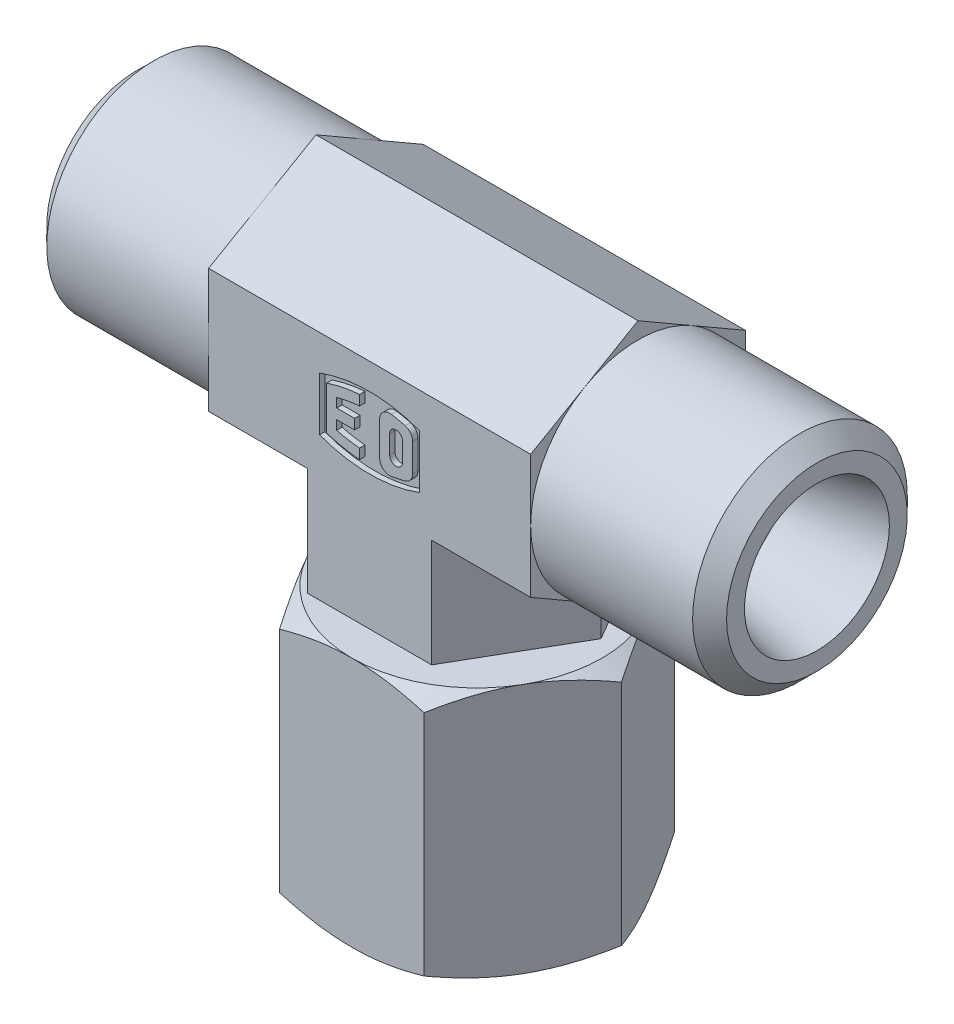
ISO-10303-21;
HEADER;
FILE_DESCRIPTION(('STEP AP214'),'2;1');
FILE_NAME('part.step','',(''),(''),'','','');
FILE_SCHEMA(('AUTOMOTIVE_DESIGN { 1 0 10303 214 1 1 1 1 }'));
ENDSEC;
DATA;
#1=APPLICATION_CONTEXT('core data for automotive mechanical design processes');
#2=APPLICATION_PROTOCOL_DEFINITION('international standard','automotive_design',2000,#1);
#3=PRODUCT_CONTEXT('',#1,'mechanical');
#4=PRODUCT('Part','Part','',(#3));
#5=PRODUCT_RELATED_PRODUCT_CATEGORY('part','',(#4));
#6=PRODUCT_DEFINITION_FORMATION('','',#4);
#7=PRODUCT_DEFINITION_CONTEXT('part definition',#1,'design');
#8=PRODUCT_DEFINITION('design','',#6,#7);
#9=PRODUCT_DEFINITION_SHAPE('','',#8);
#10=(LENGTH_UNIT() NAMED_UNIT(*) SI_UNIT(.MILLI.,.METRE.));
#11=(NAMED_UNIT(*) PLANE_ANGLE_UNIT() SI_UNIT($,.RADIAN.));
#12=(NAMED_UNIT(*) SI_UNIT($,.STERADIAN.) SOLID_ANGLE_UNIT());
#13=UNCERTAINTY_MEASURE_WITH_UNIT(LENGTH_MEASURE(1.E-05),#10,'distance_accuracy_value','');
#14=(GEOMETRIC_REPRESENTATION_CONTEXT(3) GLOBAL_UNCERTAINTY_ASSIGNED_CONTEXT((#13)) GLOBAL_UNIT_ASSIGNED_CONTEXT((#10,
#11,#12)) REPRESENTATION_CONTEXT('',''));
#15=CARTESIAN_POINT('',(0.,0.,0.));
#16=DIRECTION('',(0.,0.,1.));
#17=DIRECTION('',(1.,0.,0.));
#18=AXIS2_PLACEMENT_3D('',#15,#16,#17);
#19=CARTESIAN_POINT('',(0.,0.,5.7));
#20=DIRECTION('',(0.,0.,1.));
#21=DIRECTION('',(1.,0.,0.));
#22=AXIS2_PLACEMENT_3D('',#19,#20,#21);
#23=PLANE('',#22);
#24=CARTESIAN_POINT('',(1.48,-0.52,5.7));
#25=DIRECTION('',(0.,0.,1.));
#26=DIRECTION('',(1.,0.,0.));
#27=AXIS2_PLACEMENT_3D('',#24,#25,#26);
#28=CIRCLE('',#27,0.36);
#29=CARTESIAN_POINT('',(1.12,-0.52,5.7));
#30=VERTEX_POINT('',#29);
#31=CARTESIAN_POINT('',(1.84,-0.52,5.7));
#32=VERTEX_POINT('',#31);
#33=EDGE_CURVE('E1132',#30,#32,#28,.T.);
#34=ORIENTED_EDGE('',*,*,#33,.T.);
#35=DIRECTION('',(0.,1.,0.));
#36=VECTOR('',#35,1.);
#37=CARTESIAN_POINT('',(1.84,0.52,5.7));
#38=LINE('',#37,#36);
#39=CARTESIAN_POINT('',(1.84,0.52,5.7));
#40=VERTEX_POINT('',#39);
#41=EDGE_CURVE('E346',#40,#32,#38,.F.);
#42=ORIENTED_EDGE('',*,*,#41,.F.);
#43=CARTESIAN_POINT('',(1.48,0.52,5.7));
#44=DIRECTION('',(0.,0.,1.));
#45=DIRECTION('',(1.,0.,0.));
#46=AXIS2_PLACEMENT_3D('',#43,#44,#45);
#47=CIRCLE('',#46,0.36);
#48=CARTESIAN_POINT('',(1.12,0.52,5.7));
#49=VERTEX_POINT('',#48);
#50=EDGE_CURVE('E20',#40,#49,#47,.T.);
#51=ORIENTED_EDGE('',*,*,#50,.T.);
#52=DIRECTION('',(0.,1.,0.));
#53=VECTOR('',#52,1.);
#54=CARTESIAN_POINT('',(1.12,-0.52,5.7));
#55=LINE('',#54,#53);
#56=EDGE_CURVE('E332',#30,#49,#55,.T.);
#57=ORIENTED_EDGE('',*,*,#56,.F.);
#58=EDGE_LOOP('',(#34,#42,#51,#57));
#59=FACE_BOUND('',#58,.T.);
#60=ADVANCED_FACE('F16',(#59),#23,.T.);
#61=CARTESIAN_POINT('',(1.12,-0.52,6.));
#62=DIRECTION('',(1.,0.,0.));
#63=DIRECTION('',(0.,0.,-1.));
#64=AXIS2_PLACEMENT_3D('',#61,#62,#63);
#65=PLANE('',#64);
#66=DIRECTION('',(0.,1.,0.));
#67=VECTOR('',#66,1.);
#68=CARTESIAN_POINT('',(1.12,0.,6.));
#69=LINE('',#68,#67);
#70=CARTESIAN_POINT('',(1.12,-0.52,6.));
#71=VERTEX_POINT('',#70);
#72=CARTESIAN_POINT('',(1.12,0.52,6.));
#73=VERTEX_POINT('',#72);
#74=EDGE_CURVE('E1145',#71,#73,#69,.T.);
#75=ORIENTED_EDGE('',*,*,#74,.F.);
#76=DIRECTION('',(0.,0.,1.));
#77=VECTOR('',#76,1.);
#78=CARTESIAN_POINT('',(1.12,-0.52,6.));
#79=LINE('',#78,#77);
#80=EDGE_CURVE('E337',#71,#30,#79,.F.);
#81=ORIENTED_EDGE('',*,*,#80,.T.);
#82=ORIENTED_EDGE('',*,*,#56,.T.);
#83=DIRECTION('',(0.,0.,1.));
#84=VECTOR('',#83,1.);
#85=CARTESIAN_POINT('',(1.12,0.52,6.));
#86=LINE('',#85,#84);
#87=EDGE_CURVE('E335',#49,#73,#86,.T.);
#88=ORIENTED_EDGE('',*,*,#87,.T.);
#89=EDGE_LOOP('',(#75,#81,#82,#88));
#90=FACE_BOUND('',#89,.T.);
#91=ADVANCED_FACE('F334',(#90),#65,.T.);
#92=CARTESIAN_POINT('',(1.48,0.52,6.));
#93=DIRECTION('',(0.,0.,1.));
#94=DIRECTION('',(1.,0.,0.));
#95=AXIS2_PLACEMENT_3D('',#92,#93,#94);
#96=CYLINDRICAL_SURFACE('',#95,0.36);
#97=DIRECTION('',(0.,0.,1.));
#98=VECTOR('',#97,1.);
#99=CARTESIAN_POINT('',(1.84,0.52,6.));
#100=LINE('',#99,#98);
#101=CARTESIAN_POINT('',(1.84,0.52,6.));
#102=VERTEX_POINT('',#101);
#103=EDGE_CURVE('E347',#102,#40,#100,.F.);
#104=ORIENTED_EDGE('',*,*,#103,.F.);
#105=CARTESIAN_POINT('',(1.48,0.52,6.));
#106=DIRECTION('',(0.,0.,1.));
#107=DIRECTION('',(1.,0.,0.));
#108=AXIS2_PLACEMENT_3D('',#105,#106,#107);
#109=CIRCLE('',#108,0.36);
#110=EDGE_CURVE('E343',#73,#102,#109,.F.);
#111=ORIENTED_EDGE('',*,*,#110,.F.);
#112=ORIENTED_EDGE('',*,*,#87,.F.);
#113=ORIENTED_EDGE('',*,*,#50,.F.);
#114=EDGE_LOOP('',(#104,#111,#112,#113));
#115=FACE_BOUND('',#114,.T.);
#116=ADVANCED_FACE('F342',(#115),#96,.F.);
#117=CARTESIAN_POINT('',(1.84,0.52,6.));
#118=DIRECTION('',(-1.,0.,0.));
#119=DIRECTION('',(0.,0.,1.));
#120=AXIS2_PLACEMENT_3D('',#117,#118,#119);
#121=PLANE('',#120);
#122=DIRECTION('',(0.,1.,0.));
#123=VECTOR('',#122,1.);
#124=CARTESIAN_POINT('',(1.84,0.,6.));
#125=LINE('',#124,#123);
#126=CARTESIAN_POINT('',(1.84,-0.52,6.));
#127=VERTEX_POINT('',#126);
#128=EDGE_CURVE('E1147',#102,#127,#125,.F.);
#129=ORIENTED_EDGE('',*,*,#128,.F.);
#130=ORIENTED_EDGE('',*,*,#103,.T.);
#131=ORIENTED_EDGE('',*,*,#41,.T.);
#132=DIRECTION('',(0.,0.,1.));
#133=VECTOR('',#132,1.);
#134=CARTESIAN_POINT('',(1.84,-0.52,6.));
#135=LINE('',#134,#133);
#136=EDGE_CURVE('E352',#32,#127,#135,.T.);
#137=ORIENTED_EDGE('',*,*,#136,.T.);
#138=EDGE_LOOP('',(#129,#130,#131,#137));
#139=FACE_BOUND('',#138,.T.);
#140=ADVANCED_FACE('F2273',(#139),#121,.T.);
#141=CARTESIAN_POINT('',(1.48,-0.52,6.));
#142=DIRECTION('',(0.,0.,1.));
#143=DIRECTION('',(1.,0.,0.));
#144=AXIS2_PLACEMENT_3D('',#141,#142,#143);
#145=CYLINDRICAL_SURFACE('',#144,0.36);
#146=ORIENTED_EDGE('',*,*,#80,.F.);
#147=CARTESIAN_POINT('',(1.48,-0.52,6.));
#148=DIRECTION('',(0.,0.,1.));
#149=DIRECTION('',(1.,0.,0.));
#150=AXIS2_PLACEMENT_3D('',#147,#148,#149);
#151=CIRCLE('',#150,0.36);
#152=EDGE_CURVE('E1148',#127,#71,#151,.F.);
#153=ORIENTED_EDGE('',*,*,#152,.F.);
#154=ORIENTED_EDGE('',*,*,#136,.F.);
#155=ORIENTED_EDGE('',*,*,#33,.F.);
#156=EDGE_LOOP('',(#146,#153,#154,#155));
#157=FACE_BOUND('',#156,.T.);
#158=ADVANCED_FACE('F2263',(#157),#145,.F.);
#159=CARTESIAN_POINT('',(0.,0.,-6.));
#160=DIRECTION('',(0.,0.,1.));
#161=DIRECTION('',(1.,0.,0.));
#162=AXIS2_PLACEMENT_3D('',#159,#160,#161);
#163=PLANE('',#162);
#164=DIRECTION('',(1.,0.,0.));
#165=VECTOR('',#164,1.);
#166=CARTESIAN_POINT('',(0.,1.8,-6.));
#167=LINE('',#166,#165);
#168=CARTESIAN_POINT('',(0.96,1.8,-6.));
#169=VERTEX_POINT('',#168);
#170=CARTESIAN_POINT('',(-0.48,1.8,-6.));
#171=VERTEX_POINT('',#170);
#172=EDGE_CURVE('E1133',#169,#171,#167,.F.);
#173=ORIENTED_EDGE('',*,*,#172,.F.);
#174=DIRECTION('',(0.,1.,0.));
#175=VECTOR('',#174,1.);
#176=CARTESIAN_POINT('',(0.96,1.8,-6.));
#177=LINE('',#176,#175);
#178=CARTESIAN_POINT('',(0.96,1.08,-6.));
#179=VERTEX_POINT('',#178);
#180=EDGE_CURVE('E1080',#179,#169,#177,.T.);
#181=ORIENTED_EDGE('',*,*,#180,.F.);
#182=DIRECTION('',(1.,0.,0.));
#183=VECTOR('',#182,1.);
#184=CARTESIAN_POINT('',(0.96,1.08,-6.));
#185=LINE('',#184,#183);
#186=CARTESIAN_POINT('',(-0.48,1.08,-6.));
#187=VERTEX_POINT('',#186);
#188=EDGE_CURVE('E1073',#187,#179,#185,.T.);
#189=ORIENTED_EDGE('',*,*,#188,.F.);
#190=DIRECTION('',(0.,1.,0.));
#191=VECTOR('',#190,1.);
#192=CARTESIAN_POINT('',(-0.48,1.08,-6.));
#193=LINE('',#192,#191);
#194=CARTESIAN_POINT('',(-0.48,0.36,-6.));
#195=VERTEX_POINT('',#194);
#196=EDGE_CURVE('E1063',#195,#187,#193,.T.);
#197=ORIENTED_EDGE('',*,*,#196,.F.);
#198=DIRECTION('',(1.,0.,0.));
#199=VECTOR('',#198,1.);
#200=CARTESIAN_POINT('',(-0.48,0.36,-6.));
#201=LINE('',#200,#199);
#202=CARTESIAN_POINT('',(0.96,0.36,-6.));
#203=VERTEX_POINT('',#202);
#204=EDGE_CURVE('E1053',#203,#195,#201,.F.);
#205=ORIENTED_EDGE('',*,*,#204,.F.);
#206=DIRECTION('',(0.,1.,0.));
#207=VECTOR('',#206,1.);
#208=CARTESIAN_POINT('',(0.96,0.36,-6.));
#209=LINE('',#208,#207);
#210=CARTESIAN_POINT('',(0.96,-1.8,-6.));
#211=VERTEX_POINT('',#210);
#212=EDGE_CURVE('E1042',#211,#203,#209,.T.);
#213=ORIENTED_EDGE('',*,*,#212,.F.);
#214=DIRECTION('',(1.,0.,0.));
#215=VECTOR('',#214,1.);
#216=CARTESIAN_POINT('',(0.96,-1.8,-6.));
#217=LINE('',#216,#215);
#218=CARTESIAN_POINT('',(0.24,-1.8,-6.));
#219=VERTEX_POINT('',#218);
#220=EDGE_CURVE('E1031',#219,#211,#217,.T.);
#221=ORIENTED_EDGE('',*,*,#220,.F.);
#222=DIRECTION('',(0.,1.,0.));
#223=VECTOR('',#222,1.);
#224=CARTESIAN_POINT('',(0.24,-1.8,-6.));
#225=LINE('',#224,#223);
#226=CARTESIAN_POINT('',(0.24,-0.36,-6.));
#227=VERTEX_POINT('',#226);
#228=EDGE_CURVE('E1020',#227,#219,#225,.F.);
#229=ORIENTED_EDGE('',*,*,#228,.F.);
#230=DIRECTION('',(1.,0.,0.));
#231=VECTOR('',#230,1.);
#232=CARTESIAN_POINT('',(0.24,-0.36,-6.));
#233=LINE('',#232,#231);
#234=CARTESIAN_POINT('',(-0.48,-0.36,-6.));
#235=VERTEX_POINT('',#234);
#236=EDGE_CURVE('E1007',#235,#227,#233,.T.);
#237=ORIENTED_EDGE('',*,*,#236,.F.);
#238=CARTESIAN_POINT('',(-0.48,0.72,-6.));
#239=DIRECTION('',(0.,0.,-1.));
#240=DIRECTION('',(-1.,0.,0.));
#241=AXIS2_PLACEMENT_3D('',#238,#239,#240);
#242=CIRCLE('',#241,1.08);
#243=EDGE_CURVE('E1003',#171,#235,#242,.F.);
#244=ORIENTED_EDGE('',*,*,#243,.F.);
#245=EDGE_LOOP('',(#173,#181,#189,#197,#205,#213,#221,#229,#237,#244));
#246=FACE_BOUND('',#245,.T.);
#247=ADVANCED_FACE('F2253',(#246),#163,.F.);
#248=CARTESIAN_POINT('',(0.,0.,6.));
#249=DIRECTION('',(0.,0.,1.));
#250=DIRECTION('',(1.,0.,0.));
#251=AXIS2_PLACEMENT_3D('',#248,#249,#250);
#252=PLANE('',#251);
#253=ORIENTED_EDGE('',*,*,#128,.T.);
#254=ORIENTED_EDGE('',*,*,#152,.T.);
#255=ORIENTED_EDGE('',*,*,#74,.T.);
#256=ORIENTED_EDGE('',*,*,#110,.T.);
#257=EDGE_LOOP('',(#253,#254,#255,#256));
#258=FACE_BOUND('',#257,.T.);
#259=CARTESIAN_POINT('',(1.12,0.950338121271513,6.));
#260=DIRECTION('',(0.,0.,1.));
#261=DIRECTION('',(1.,0.,0.));
#262=AXIS2_PLACEMENT_3D('',#259,#260,#261);
#263=CIRCLE('',#262,0.56);
#264=CARTESIAN_POINT('',(1.20909090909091,1.50320592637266,6.));
#265=VERTEX_POINT('',#264);
#266=CARTESIAN_POINT('',(0.56,0.950338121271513,6.));
#267=VERTEX_POINT('',#266);
#268=EDGE_CURVE('E1143',#265,#267,#263,.T.);
#269=ORIENTED_EDGE('',*,*,#268,.T.);
#270=DIRECTION('',(0.,1.,0.));
#271=VECTOR('',#270,1.);
#272=CARTESIAN_POINT('',(0.56,0.950338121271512,6.));
#273=LINE('',#272,#271);
#274=CARTESIAN_POINT('',(0.56,-0.950338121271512,6.));
#275=VERTEX_POINT('',#274);
#276=EDGE_CURVE('E978',#275,#267,#273,.T.);
#277=ORIENTED_EDGE('',*,*,#276,.F.);
#278=CARTESIAN_POINT('',(1.12,-0.950338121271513,6.));
#279=DIRECTION('',(0.,0.,1.));
#280=DIRECTION('',(1.,0.,0.));
#281=AXIS2_PLACEMENT_3D('',#278,#279,#280);
#282=CIRCLE('',#281,0.56);
#283=CARTESIAN_POINT('',(1.20909092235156,-1.50320592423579,6.));
#284=VERTEX_POINT('',#283);
#285=EDGE_CURVE('E982',#284,#275,#282,.F.);
#286=ORIENTED_EDGE('',*,*,#285,.F.);
#287=CARTESIAN_POINT('',(0.,6.00000000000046,6.));
#288=DIRECTION('',(0.,0.,1.));
#289=DIRECTION('',(1.,0.,0.));
#290=AXIS2_PLACEMENT_3D('',#287,#288,#289);
#291=CIRCLE('',#290,7.60000000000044);
#292=CARTESIAN_POINT('',(1.98636363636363,-1.3358271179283,6.));
#293=VERTEX_POINT('',#292);
#294=EDGE_CURVE('E986',#293,#284,#291,.F.);
#295=ORIENTED_EDGE('',*,*,#294,.F.);
#296=CARTESIAN_POINT('',(1.84,-0.795292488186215,6.));
#297=DIRECTION('',(0.,0.,1.));
#298=DIRECTION('',(1.,0.,0.));
#299=AXIS2_PLACEMENT_3D('',#296,#297,#298);
#300=CIRCLE('',#299,0.56);
#301=CARTESIAN_POINT('',(2.4,-0.795292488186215,6.));
#302=VERTEX_POINT('',#301);
#303=EDGE_CURVE('E1134',#293,#302,#300,.T.);
#304=ORIENTED_EDGE('',*,*,#303,.T.);
#305=DIRECTION('',(0.,1.,0.));
#306=VECTOR('',#305,1.);
#307=CARTESIAN_POINT('',(2.4,0.,6.));
#308=LINE('',#307,#306);
#309=CARTESIAN_POINT('',(2.4,0.795292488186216,6.));
#310=VERTEX_POINT('',#309);
#311=EDGE_CURVE('E1138',#302,#310,#308,.T.);
#312=ORIENTED_EDGE('',*,*,#311,.T.);
#313=CARTESIAN_POINT('',(1.84,0.795292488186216,6.));
#314=DIRECTION('',(0.,0.,1.));
#315=DIRECTION('',(1.,0.,0.));
#316=AXIS2_PLACEMENT_3D('',#313,#314,#315);
#317=CIRCLE('',#316,0.56);
#318=CARTESIAN_POINT('',(1.98636363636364,1.3358271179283,6.));
#319=VERTEX_POINT('',#318);
#320=EDGE_CURVE('E1139',#310,#319,#317,.T.);
#321=ORIENTED_EDGE('',*,*,#320,.T.);
#322=CARTESIAN_POINT('',(0.,-6.00000000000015,6.));
#323=DIRECTION('',(0.,0.,1.));
#324=DIRECTION('',(1.,0.,0.));
#325=AXIS2_PLACEMENT_3D('',#322,#323,#324);
#326=CIRCLE('',#325,7.60000000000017);
#327=EDGE_CURVE('E1141',#319,#265,#326,.T.);
#328=ORIENTED_EDGE('',*,*,#327,.T.);
#329=EDGE_LOOP('',(#269,#277,#286,#295,#304,#312,#321,#328));
#330=FACE_BOUND('',#329,.T.);
#331=ADVANCED_FACE('F2243',(#258,#330),#252,.T.);
#332=CARTESIAN_POINT('',(0.,0.,6.));
#333=DIRECTION('',(0.,0.,1.));
#334=DIRECTION('',(1.,0.,0.));
#335=AXIS2_PLACEMENT_3D('',#332,#333,#334);
#336=PLANE('',#335);
#337=CARTESIAN_POINT('',(0.,-5.99999999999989,6.));
#338=DIRECTION('',(0.,0.,1.));
#339=DIRECTION('',(1.,0.,0.));
#340=AXIS2_PLACEMENT_3D('',#337,#338,#339);
#341=CIRCLE('',#340,7.59999999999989);
#342=CARTESIAN_POINT('',(-2.4,1.21110255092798,6.));
#343=VERTEX_POINT('',#342);
#344=CARTESIAN_POINT('',(-0.56,1.57934034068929,6.));
#345=VERTEX_POINT('',#344);
#346=EDGE_CURVE('E948',#343,#345,#341,.F.);
#347=ORIENTED_EDGE('',*,*,#346,.F.);
#348=DIRECTION('',(0.,1.,0.));
#349=VECTOR('',#348,1.);
#350=CARTESIAN_POINT('',(-2.4,1.21110255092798,6.));
#351=LINE('',#350,#349);
#352=CARTESIAN_POINT('',(-2.4,-1.21110255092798,6.));
#353=VERTEX_POINT('',#352);
#354=EDGE_CURVE('E952',#353,#343,#351,.T.);
#355=ORIENTED_EDGE('',*,*,#354,.F.);
#356=CARTESIAN_POINT('',(0.,6.,6.));
#357=DIRECTION('',(0.,0.,1.));
#358=DIRECTION('',(1.,0.,0.));
#359=AXIS2_PLACEMENT_3D('',#356,#357,#358);
#360=CIRCLE('',#359,7.6);
#361=CARTESIAN_POINT('',(-0.56,-1.57934034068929,6.));
#362=VERTEX_POINT('',#361);
#363=EDGE_CURVE('E956',#362,#353,#360,.F.);
#364=ORIENTED_EDGE('',*,*,#363,.F.);
#365=DIRECTION('',(0.,1.,0.));
#366=VECTOR('',#365,1.);
#367=CARTESIAN_POINT('',(-0.56,-1.57934034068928,6.));
#368=LINE('',#367,#366);
#369=CARTESIAN_POINT('',(-0.56,-1.01769192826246,6.));
#370=VERTEX_POINT('',#369);
#371=EDGE_CURVE('E960',#370,#362,#368,.F.);
#372=ORIENTED_EDGE('',*,*,#371,.F.);
#373=CARTESIAN_POINT('',(0.,5.99999999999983,6.));
#374=DIRECTION('',(0.,0.,1.));
#375=DIRECTION('',(1.,0.,0.));
#376=AXIS2_PLACEMENT_3D('',#373,#374,#375);
#377=CIRCLE('',#376,7.03999999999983);
#378=CARTESIAN_POINT('',(-1.84,-0.79529248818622,6.));
#379=VERTEX_POINT('',#378);
#380=EDGE_CURVE('E1151',#370,#379,#377,.F.);
#381=ORIENTED_EDGE('',*,*,#380,.T.);
#382=DIRECTION('',(0.,1.,0.));
#383=VECTOR('',#382,1.);
#384=CARTESIAN_POINT('',(-1.84,0.,6.));
#385=LINE('',#384,#383);
#386=CARTESIAN_POINT('',(-1.84,-0.28,6.));
#387=VERTEX_POINT('',#386);
#388=EDGE_CURVE('E1128',#379,#387,#385,.T.);
#389=ORIENTED_EDGE('',*,*,#388,.T.);
#390=DIRECTION('',(1.,0.,0.));
#391=VECTOR('',#390,1.);
#392=CARTESIAN_POINT('',(0.,-0.28,6.));
#393=LINE('',#392,#391);
#394=CARTESIAN_POINT('',(-0.84,-0.28,6.));
#395=VERTEX_POINT('',#394);
#396=EDGE_CURVE('E1123',#387,#395,#393,.T.);
#397=ORIENTED_EDGE('',*,*,#396,.T.);
#398=DIRECTION('',(0.,1.,0.));
#399=VECTOR('',#398,1.);
#400=CARTESIAN_POINT('',(-0.84,0.,6.));
#401=LINE('',#400,#399);
#402=CARTESIAN_POINT('',(-0.84,0.28,6.));
#403=VERTEX_POINT('',#402);
#404=EDGE_CURVE('E1118',#395,#403,#401,.T.);
#405=ORIENTED_EDGE('',*,*,#404,.T.);
#406=DIRECTION('',(1.,0.,0.));
#407=VECTOR('',#406,1.);
#408=CARTESIAN_POINT('',(0.,0.28,6.));
#409=LINE('',#408,#407);
#410=CARTESIAN_POINT('',(-1.84,0.28,6.));
#411=VERTEX_POINT('',#410);
#412=EDGE_CURVE('E1114',#403,#411,#409,.F.);
#413=ORIENTED_EDGE('',*,*,#412,.T.);
#414=DIRECTION('',(0.,1.,0.));
#415=VECTOR('',#414,1.);
#416=CARTESIAN_POINT('',(-1.84,0.,6.));
#417=LINE('',#416,#415);
#418=CARTESIAN_POINT('',(-1.84,0.795292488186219,6.));
#419=VERTEX_POINT('',#418);
#420=EDGE_CURVE('E1117',#411,#419,#417,.T.);
#421=ORIENTED_EDGE('',*,*,#420,.T.);
#422=CARTESIAN_POINT('',(0.,-5.99999999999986,6.));
#423=DIRECTION('',(0.,0.,1.));
#424=DIRECTION('',(1.,0.,0.));
#425=AXIS2_PLACEMENT_3D('',#422,#423,#424);
#426=CIRCLE('',#425,7.03999999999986);
#427=CARTESIAN_POINT('',(-0.56,1.01769192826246,6.));
#428=VERTEX_POINT('',#427);
#429=EDGE_CURVE('E1153',#419,#428,#426,.F.);
#430=ORIENTED_EDGE('',*,*,#429,.T.);
#431=DIRECTION('',(0.,1.,0.));
#432=VECTOR('',#431,1.);
#433=CARTESIAN_POINT('',(-0.56,0.,6.));
#434=LINE('',#433,#432);
#435=EDGE_CURVE('E1083',#428,#345,#434,.T.);
#436=ORIENTED_EDGE('',*,*,#435,.T.);
#437=EDGE_LOOP('',(#347,#355,#364,#372,#381,#389,#397,#405,#413,#421,#430,#436));
#438=FACE_BOUND('',#437,.T.);
#439=ADVANCED_FACE('F2233',(#438),#336,.T.);
#440=CARTESIAN_POINT('',(-19.,-4.55,0.));
#441=DIRECTION('',(-1.,0.,0.));
#442=DIRECTION('',(0.,0.,1.));
#443=AXIS2_PLACEMENT_3D('',#440,#441,#442);
#444=PLANE('',#443);
#445=CARTESIAN_POINT('',(-19.0000000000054,0.,0.));
#446=DIRECTION('',(-1.,0.,0.));
#447=DIRECTION('',(0.,0.,1.));
#448=AXIS2_PLACEMENT_3D('',#445,#446,#447);
#449=CIRCLE('',#448,4.04999999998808);
#450=CARTESIAN_POINT('',(-19.0000000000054,0.,4.04999999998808));
#451=VERTEX_POINT('',#450);
#452=EDGE_CURVE('E1166',#451,#451,#449,.F.);
#453=ORIENTED_EDGE('',*,*,#452,.T.);
#454=EDGE_LOOP('',(#453));
#455=FACE_BOUND('',#454,.T.);
#456=CARTESIAN_POINT('',(-19.0000000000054,0.,0.));
#457=DIRECTION('',(1.,0.,0.));
#458=DIRECTION('',(0.,0.,-1.));
#459=AXIS2_PLACEMENT_3D('',#456,#457,#458);
#460=CIRCLE('',#459,5.0499999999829);
#461=CARTESIAN_POINT('',(-19.0000000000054,0.,-5.0499999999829));
#462=VERTEX_POINT('',#461);
#463=EDGE_CURVE('E1163',#462,#462,#460,.T.);
#464=ORIENTED_EDGE('',*,*,#463,.F.);
#465=EDGE_LOOP('',(#464));
#466=FACE_BOUND('',#465,.T.);
#467=ADVANCED_FACE('F2223',(#455,#466),#444,.T.);
#468=CARTESIAN_POINT('',(19.,4.55,0.));
#469=DIRECTION('',(1.,0.,0.));
#470=DIRECTION('',(0.,0.,-1.));
#471=AXIS2_PLACEMENT_3D('',#468,#469,#470);
#472=PLANE('',#471);
#473=CARTESIAN_POINT('',(19.0000000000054,0.,0.));
#474=DIRECTION('',(1.,0.,0.));
#475=DIRECTION('',(0.,0.,-1.));
#476=AXIS2_PLACEMENT_3D('',#473,#474,#475);
#477=CIRCLE('',#476,4.04999999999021);
#478=CARTESIAN_POINT('',(19.0000000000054,0.,-4.04999999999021));
#479=VERTEX_POINT('',#478);
#480=EDGE_CURVE('E999',#479,#479,#477,.F.);
#481=ORIENTED_EDGE('',*,*,#480,.T.);
#482=EDGE_LOOP('',(#481));
#483=FACE_BOUND('',#482,.T.);
#484=CARTESIAN_POINT('',(18.9999999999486,0.,0.));
#485=DIRECTION('',(-1.,0.,0.));
#486=DIRECTION('',(0.,0.,1.));
#487=AXIS2_PLACEMENT_3D('',#484,#485,#486);
#488=CIRCLE('',#487,5.0499999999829);
#489=CARTESIAN_POINT('',(18.9999999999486,0.,5.0499999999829));
#490=VERTEX_POINT('',#489);
#491=EDGE_CURVE('E898',#490,#490,#488,.T.);
#492=ORIENTED_EDGE('',*,*,#491,.F.);
#493=EDGE_LOOP('',(#492));
#494=FACE_BOUND('',#493,.T.);
#495=ADVANCED_FACE('F2213',(#483,#494),#472,.T.);
#496=CARTESIAN_POINT('',(0.96,1.8,-6.));
#497=DIRECTION('',(1.,0.,0.));
#498=DIRECTION('',(0.,0.,-1.));
#499=AXIS2_PLACEMENT_3D('',#496,#497,#498);
#500=PLANE('',#499);
#501=ORIENTED_EDGE('',*,*,#180,.T.);
#502=DIRECTION('',(0.,0.,1.));
#503=VECTOR('',#502,1.);
#504=CARTESIAN_POINT('',(0.96,1.8,-6.));
#505=LINE('',#504,#503);
#506=CARTESIAN_POINT('',(0.96,1.8,-5.7));
#507=VERTEX_POINT('',#506);
#508=EDGE_CURVE('E989',#507,#169,#505,.F.);
#509=ORIENTED_EDGE('',*,*,#508,.F.);
#510=DIRECTION('',(0.,1.,0.));
#511=VECTOR('',#510,1.);
#512=CARTESIAN_POINT('',(0.96,0.,-5.7));
#513=LINE('',#512,#511);
#514=CARTESIAN_POINT('',(0.96,1.08,-5.7));
#515=VERTEX_POINT('',#514);
#516=EDGE_CURVE('E995',#507,#515,#513,.F.);
#517=ORIENTED_EDGE('',*,*,#516,.T.);
#518=DIRECTION('',(0.,0.,-1.));
#519=VECTOR('',#518,1.);
#520=CARTESIAN_POINT('',(0.96,1.08,-6.));
#521=LINE('',#520,#519);
#522=EDGE_CURVE('E1070',#179,#515,#521,.F.);
#523=ORIENTED_EDGE('',*,*,#522,.F.);
#524=EDGE_LOOP('',(#501,#509,#517,#523));
#525=FACE_BOUND('',#524,.T.);
#526=ADVANCED_FACE('F2203',(#525),#500,.T.);
#527=CARTESIAN_POINT('',(0.96,1.08,-6.));
#528=DIRECTION('',(0.,-1.,0.));
#529=DIRECTION('',(0.,0.,-1.));
#530=AXIS2_PLACEMENT_3D('',#527,#528,#529);
#531=PLANE('',#530);
#532=ORIENTED_EDGE('',*,*,#188,.T.);
#533=ORIENTED_EDGE('',*,*,#522,.T.);
#534=DIRECTION('',(1.,0.,0.));
#535=VECTOR('',#534,1.);
#536=CARTESIAN_POINT('',(0.,1.08,-5.7));
#537=LINE('',#536,#535);
#538=CARTESIAN_POINT('',(-0.48,1.08,-5.7));
#539=VERTEX_POINT('',#538);
#540=EDGE_CURVE('E998',#515,#539,#537,.F.);
#541=ORIENTED_EDGE('',*,*,#540,.T.);
#542=DIRECTION('',(0.,0.,1.));
#543=VECTOR('',#542,1.);
#544=CARTESIAN_POINT('',(-0.48,1.08,-6.));
#545=LINE('',#544,#543);
#546=EDGE_CURVE('E1060',#187,#539,#545,.T.);
#547=ORIENTED_EDGE('',*,*,#546,.F.);
#548=EDGE_LOOP('',(#532,#533,#541,#547));
#549=FACE_BOUND('',#548,.T.);
#550=ADVANCED_FACE('F2193',(#549),#531,.T.);
#551=CARTESIAN_POINT('',(-0.48,1.08,-6.));
#552=DIRECTION('',(1.,0.,0.));
#553=DIRECTION('',(0.,1.,0.));
#554=AXIS2_PLACEMENT_3D('',#551,#552,#553);
#555=PLANE('',#554);
#556=ORIENTED_EDGE('',*,*,#196,.T.);
#557=ORIENTED_EDGE('',*,*,#546,.T.);
#558=DIRECTION('',(0.,1.,0.));
#559=VECTOR('',#558,1.);
#560=CARTESIAN_POINT('',(-0.48,0.,-5.7));
#561=LINE('',#560,#559);
#562=CARTESIAN_POINT('',(-0.48,0.36,-5.7));
#563=VERTEX_POINT('',#562);
#564=EDGE_CURVE('E1047',#539,#563,#561,.F.);
#565=ORIENTED_EDGE('',*,*,#564,.T.);
#566=DIRECTION('',(0.,0.,1.));
#567=VECTOR('',#566,1.);
#568=CARTESIAN_POINT('',(-0.48,0.36,-6.));
#569=LINE('',#568,#567);
#570=EDGE_CURVE('E1050',#195,#563,#569,.T.);
#571=ORIENTED_EDGE('',*,*,#570,.F.);
#572=EDGE_LOOP('',(#556,#557,#565,#571));
#573=FACE_BOUND('',#572,.T.);
#574=ADVANCED_FACE('F2183',(#573),#555,.T.);
#575=CARTESIAN_POINT('',(-0.48,0.36,-6.));
#576=DIRECTION('',(0.,1.,0.));
#577=DIRECTION('',(0.,0.,1.));
#578=AXIS2_PLACEMENT_3D('',#575,#576,#577);
#579=PLANE('',#578);
#580=ORIENTED_EDGE('',*,*,#204,.T.);
#581=ORIENTED_EDGE('',*,*,#570,.T.);
#582=DIRECTION('',(1.,0.,0.));
#583=VECTOR('',#582,1.);
#584=CARTESIAN_POINT('',(0.,0.36,-5.7));
#585=LINE('',#584,#583);
#586=CARTESIAN_POINT('',(0.96,0.36,-5.7));
#587=VERTEX_POINT('',#586);
#588=EDGE_CURVE('E1036',#563,#587,#585,.T.);
#589=ORIENTED_EDGE('',*,*,#588,.T.);
#590=DIRECTION('',(0.,0.,-1.));
#591=VECTOR('',#590,1.);
#592=CARTESIAN_POINT('',(0.96,0.36,-6.));
#593=LINE('',#592,#591);
#594=EDGE_CURVE('E1039',#203,#587,#593,.F.);
#595=ORIENTED_EDGE('',*,*,#594,.F.);
#596=EDGE_LOOP('',(#580,#581,#589,#595));
#597=FACE_BOUND('',#596,.T.);
#598=ADVANCED_FACE('F2173',(#597),#579,.T.);
#599=CARTESIAN_POINT('',(0.96,0.36,-6.));
#600=DIRECTION('',(1.,0.,0.));
#601=DIRECTION('',(0.,0.,-1.));
#602=AXIS2_PLACEMENT_3D('',#599,#600,#601);
#603=PLANE('',#602);
#604=ORIENTED_EDGE('',*,*,#212,.T.);
#605=ORIENTED_EDGE('',*,*,#594,.T.);
#606=DIRECTION('',(0.,1.,0.));
#607=VECTOR('',#606,1.);
#608=CARTESIAN_POINT('',(0.96,0.,-5.7));
#609=LINE('',#608,#607);
#610=CARTESIAN_POINT('',(0.96,-1.8,-5.7));
#611=VERTEX_POINT('',#610);
#612=EDGE_CURVE('E1025',#587,#611,#609,.F.);
#613=ORIENTED_EDGE('',*,*,#612,.T.);
#614=DIRECTION('',(0.,0.,-1.));
#615=VECTOR('',#614,1.);
#616=CARTESIAN_POINT('',(0.96,-1.8,-6.));
#617=LINE('',#616,#615);
#618=EDGE_CURVE('E1028',#211,#611,#617,.F.);
#619=ORIENTED_EDGE('',*,*,#618,.F.);
#620=EDGE_LOOP('',(#604,#605,#613,#619));
#621=FACE_BOUND('',#620,.T.);
#622=ADVANCED_FACE('F2163',(#621),#603,.T.);
#623=CARTESIAN_POINT('',(0.96,-1.8,-6.));
#624=DIRECTION('',(0.,-1.,0.));
#625=DIRECTION('',(0.,0.,-1.));
#626=AXIS2_PLACEMENT_3D('',#623,#624,#625);
#627=PLANE('',#626);
#628=ORIENTED_EDGE('',*,*,#220,.T.);
#629=ORIENTED_EDGE('',*,*,#618,.T.);
#630=DIRECTION('',(1.,0.,0.));
#631=VECTOR('',#630,1.);
#632=CARTESIAN_POINT('',(0.,-1.8,-5.7));
#633=LINE('',#632,#631);
#634=CARTESIAN_POINT('',(0.24,-1.8,-5.7));
#635=VERTEX_POINT('',#634);
#636=EDGE_CURVE('E1014',#611,#635,#633,.F.);
#637=ORIENTED_EDGE('',*,*,#636,.T.);
#638=DIRECTION('',(0.,0.,1.));
#639=VECTOR('',#638,1.);
#640=CARTESIAN_POINT('',(0.24,-1.8,-6.));
#641=LINE('',#640,#639);
#642=EDGE_CURVE('E1017',#219,#635,#641,.T.);
#643=ORIENTED_EDGE('',*,*,#642,.F.);
#644=EDGE_LOOP('',(#628,#629,#637,#643));
#645=FACE_BOUND('',#644,.T.);
#646=ADVANCED_FACE('F2153',(#645),#627,.T.);
#647=CARTESIAN_POINT('',(0.24,-1.8,-6.));
#648=DIRECTION('',(-1.,0.,0.));
#649=DIRECTION('',(0.,0.,1.));
#650=AXIS2_PLACEMENT_3D('',#647,#648,#649);
#651=PLANE('',#650);
#652=ORIENTED_EDGE('',*,*,#228,.T.);
#653=ORIENTED_EDGE('',*,*,#642,.T.);
#654=DIRECTION('',(0.,1.,0.));
#655=VECTOR('',#654,1.);
#656=CARTESIAN_POINT('',(0.24,0.,-5.7));
#657=LINE('',#656,#655);
#658=CARTESIAN_POINT('',(0.24,-0.36,-5.7));
#659=VERTEX_POINT('',#658);
#660=EDGE_CURVE('E1010',#635,#659,#657,.T.);
#661=ORIENTED_EDGE('',*,*,#660,.T.);
#662=DIRECTION('',(0.,0.,-1.));
#663=VECTOR('',#662,1.);
#664=CARTESIAN_POINT('',(0.24,-0.36,-6.));
#665=LINE('',#664,#663);
#666=EDGE_CURVE('E1004',#227,#659,#665,.F.);
#667=ORIENTED_EDGE('',*,*,#666,.F.);
#668=EDGE_LOOP('',(#652,#653,#661,#667));
#669=FACE_BOUND('',#668,.T.);
#670=ADVANCED_FACE('F2143',(#669),#651,.T.);
#671=CARTESIAN_POINT('',(0.24,-0.36,-6.));
#672=DIRECTION('',(0.,-1.,0.));
#673=DIRECTION('',(0.,0.,-1.));
#674=AXIS2_PLACEMENT_3D('',#671,#672,#673);
#675=PLANE('',#674);
#676=ORIENTED_EDGE('',*,*,#236,.T.);
#677=ORIENTED_EDGE('',*,*,#666,.T.);
#678=DIRECTION('',(1.,0.,0.));
#679=VECTOR('',#678,1.);
#680=CARTESIAN_POINT('',(0.,-0.36,-5.7));
#681=LINE('',#680,#679);
#682=CARTESIAN_POINT('',(-0.48,-0.36,-5.7));
#683=VERTEX_POINT('',#682);
#684=EDGE_CURVE('E1013',#659,#683,#681,.F.);
#685=ORIENTED_EDGE('',*,*,#684,.T.);
#686=DIRECTION('',(0.,0.,-1.));
#687=VECTOR('',#686,1.);
#688=CARTESIAN_POINT('',(-0.48,-0.36,-6.));
#689=LINE('',#688,#687);
#690=EDGE_CURVE('E992',#235,#683,#689,.F.);
#691=ORIENTED_EDGE('',*,*,#690,.F.);
#692=EDGE_LOOP('',(#676,#677,#685,#691));
#693=FACE_BOUND('',#692,.T.);
#694=ADVANCED_FACE('F2133',(#693),#675,.T.);
#695=CARTESIAN_POINT('',(-0.48,0.72,-6.));
#696=DIRECTION('',(0.,0.,-1.));
#697=DIRECTION('',(-1.,0.,0.));
#698=AXIS2_PLACEMENT_3D('',#695,#696,#697);
#699=CYLINDRICAL_SURFACE('',#698,1.08);
#700=ORIENTED_EDGE('',*,*,#243,.T.);
#701=ORIENTED_EDGE('',*,*,#690,.T.);
#702=CARTESIAN_POINT('',(-0.48,0.72,-5.7));
#703=DIRECTION('',(0.,0.,-1.));
#704=DIRECTION('',(-1.,0.,0.));
#705=AXIS2_PLACEMENT_3D('',#702,#703,#704);
#706=CIRCLE('',#705,1.08);
#707=CARTESIAN_POINT('',(-0.48,1.8,-5.7));
#708=VERTEX_POINT('',#707);
#709=EDGE_CURVE('E1171',#683,#708,#706,.T.);
#710=ORIENTED_EDGE('',*,*,#709,.T.);
#711=DIRECTION('',(0.,0.,1.));
#712=VECTOR('',#711,1.);
#713=CARTESIAN_POINT('',(-0.48,1.8,-6.));
#714=LINE('',#713,#712);
#715=EDGE_CURVE('E987',#171,#708,#714,.T.);
#716=ORIENTED_EDGE('',*,*,#715,.F.);
#717=EDGE_LOOP('',(#700,#701,#710,#716));
#718=FACE_BOUND('',#717,.T.);
#719=ADVANCED_FACE('F2123',(#718),#699,.T.);
#720=CARTESIAN_POINT('',(-0.48,1.8,-6.));
#721=DIRECTION('',(0.,1.,0.));
#722=DIRECTION('',(0.,0.,1.));
#723=AXIS2_PLACEMENT_3D('',#720,#721,#722);
#724=PLANE('',#723);
#725=ORIENTED_EDGE('',*,*,#172,.T.);
#726=ORIENTED_EDGE('',*,*,#715,.T.);
#727=DIRECTION('',(1.,0.,0.));
#728=VECTOR('',#727,1.);
#729=CARTESIAN_POINT('',(0.,1.8,-5.7));
#730=LINE('',#729,#728);
#731=EDGE_CURVE('E1174',#708,#507,#730,.T.);
#732=ORIENTED_EDGE('',*,*,#731,.T.);
#733=ORIENTED_EDGE('',*,*,#508,.T.);
#734=EDGE_LOOP('',(#725,#726,#732,#733));
#735=FACE_BOUND('',#734,.T.);
#736=ADVANCED_FACE('F2113',(#735),#724,.T.);
#737=CARTESIAN_POINT('',(0.,6.00000000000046,6.));
#738=DIRECTION('',(0.,0.,1.));
#739=DIRECTION('',(1.,0.,0.));
#740=AXIS2_PLACEMENT_3D('',#737,#738,#739);
#741=CYLINDRICAL_SURFACE('',#740,7.60000000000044);
#742=ORIENTED_EDGE('',*,*,#294,.T.);
#743=DIRECTION('',(0.,0.,1.));
#744=VECTOR('',#743,1.);
#745=CARTESIAN_POINT('',(1.20909093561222,-1.50320592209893,6.));
#746=LINE('',#745,#744);
#747=CARTESIAN_POINT('',(1.20909092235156,-1.50320592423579,5.7));
#748=VERTEX_POINT('',#747);
#749=EDGE_CURVE('E983',#748,#284,#746,.T.);
#750=ORIENTED_EDGE('',*,*,#749,.F.);
#751=CARTESIAN_POINT('',(0.,6.00000000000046,5.7));
#752=DIRECTION('',(0.,0.,1.));
#753=DIRECTION('',(1.,0.,0.));
#754=AXIS2_PLACEMENT_3D('',#751,#752,#753);
#755=CIRCLE('',#754,7.60000000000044);
#756=CARTESIAN_POINT('',(1.98636363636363,-1.3358271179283,5.7));
#757=VERTEX_POINT('',#756);
#758=EDGE_CURVE('E1175',#757,#748,#755,.F.);
#759=ORIENTED_EDGE('',*,*,#758,.F.);
#760=DIRECTION('',(0.,0.,1.));
#761=VECTOR('',#760,1.);
#762=CARTESIAN_POINT('',(1.98636363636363,-1.3358271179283,6.));
#763=LINE('',#762,#761);
#764=EDGE_CURVE('E961',#293,#757,#763,.F.);
#765=ORIENTED_EDGE('',*,*,#764,.F.);
#766=EDGE_LOOP('',(#742,#750,#759,#765));
#767=FACE_BOUND('',#766,.T.);
#768=ADVANCED_FACE('F2103',(#767),#741,.T.);
#769=CARTESIAN_POINT('',(1.12,-0.950338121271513,6.));
#770=DIRECTION('',(0.,0.,1.));
#771=DIRECTION('',(1.,0.,0.));
#772=AXIS2_PLACEMENT_3D('',#769,#770,#771);
#773=CYLINDRICAL_SURFACE('',#772,0.56);
#774=ORIENTED_EDGE('',*,*,#285,.T.);
#775=DIRECTION('',(0.,0.,1.));
#776=VECTOR('',#775,1.);
#777=CARTESIAN_POINT('',(0.56,-0.950338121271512,6.));
#778=LINE('',#777,#776);
#779=CARTESIAN_POINT('',(0.56,-0.950338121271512,5.7));
#780=VERTEX_POINT('',#779);
#781=EDGE_CURVE('E979',#780,#275,#778,.T.);
#782=ORIENTED_EDGE('',*,*,#781,.F.);
#783=CARTESIAN_POINT('',(1.12,-0.950338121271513,5.7));
#784=DIRECTION('',(0.,0.,1.));
#785=DIRECTION('',(1.,0.,0.));
#786=AXIS2_PLACEMENT_3D('',#783,#784,#785);
#787=CIRCLE('',#786,0.56);
#788=EDGE_CURVE('E1177',#748,#780,#787,.F.);
#789=ORIENTED_EDGE('',*,*,#788,.F.);
#790=ORIENTED_EDGE('',*,*,#749,.T.);
#791=EDGE_LOOP('',(#774,#782,#789,#790));
#792=FACE_BOUND('',#791,.T.);
#793=ADVANCED_FACE('F2093',(#792),#773,.T.);
#794=CARTESIAN_POINT('',(0.56,0.950338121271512,6.));
#795=DIRECTION('',(-1.,0.,0.));
#796=DIRECTION('',(0.,0.,1.));
#797=AXIS2_PLACEMENT_3D('',#794,#795,#796);
#798=PLANE('',#797);
#799=ORIENTED_EDGE('',*,*,#276,.T.);
#800=DIRECTION('',(0.,0.,1.));
#801=VECTOR('',#800,1.);
#802=CARTESIAN_POINT('',(0.56,0.950338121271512,6.));
#803=LINE('',#802,#801);
#804=CARTESIAN_POINT('',(0.56,0.950338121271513,5.7));
#805=VERTEX_POINT('',#804);
#806=EDGE_CURVE('E975',#805,#267,#803,.T.);
#807=ORIENTED_EDGE('',*,*,#806,.F.);
#808=DIRECTION('',(0.,1.,0.));
#809=VECTOR('',#808,1.);
#810=CARTESIAN_POINT('',(0.56,0.,5.7));
#811=LINE('',#810,#809);
#812=EDGE_CURVE('E1179',#780,#805,#811,.T.);
#813=ORIENTED_EDGE('',*,*,#812,.F.);
#814=ORIENTED_EDGE('',*,*,#781,.T.);
#815=EDGE_LOOP('',(#799,#807,#813,#814));
#816=FACE_BOUND('',#815,.T.);
#817=ADVANCED_FACE('F2083',(#816),#798,.T.);
#818=CARTESIAN_POINT('',(1.12,0.950338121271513,6.));
#819=DIRECTION('',(0.,0.,1.));
#820=DIRECTION('',(1.,0.,0.));
#821=AXIS2_PLACEMENT_3D('',#818,#819,#820);
#822=CYLINDRICAL_SURFACE('',#821,0.56);
#823=ORIENTED_EDGE('',*,*,#268,.F.);
#824=DIRECTION('',(0.,0.,1.));
#825=VECTOR('',#824,1.);
#826=CARTESIAN_POINT('',(1.20909090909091,1.50320592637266,6.));
#827=LINE('',#826,#825);
#828=CARTESIAN_POINT('',(1.20909090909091,1.50320592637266,5.7));
#829=VERTEX_POINT('',#828);
#830=EDGE_CURVE('E972',#829,#265,#827,.T.);
#831=ORIENTED_EDGE('',*,*,#830,.F.);
#832=CARTESIAN_POINT('',(1.12,0.950338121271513,5.7));
#833=DIRECTION('',(0.,0.,1.));
#834=DIRECTION('',(1.,0.,0.));
#835=AXIS2_PLACEMENT_3D('',#832,#833,#834);
#836=CIRCLE('',#835,0.56);
#837=EDGE_CURVE('E1180',#805,#829,#836,.F.);
#838=ORIENTED_EDGE('',*,*,#837,.F.);
#839=ORIENTED_EDGE('',*,*,#806,.T.);
#840=EDGE_LOOP('',(#823,#831,#838,#839));
#841=FACE_BOUND('',#840,.T.);
#842=ADVANCED_FACE('F2073',(#841),#822,.T.);
#843=CARTESIAN_POINT('',(0.,-6.00000000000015,6.));
#844=DIRECTION('',(0.,0.,1.));
#845=DIRECTION('',(1.,0.,0.));
#846=AXIS2_PLACEMENT_3D('',#843,#844,#845);
#847=CYLINDRICAL_SURFACE('',#846,7.60000000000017);
#848=ORIENTED_EDGE('',*,*,#327,.F.);
#849=DIRECTION('',(0.,0.,1.));
#850=VECTOR('',#849,1.);
#851=CARTESIAN_POINT('',(1.98636363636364,1.3358271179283,6.));
#852=LINE('',#851,#850);
#853=CARTESIAN_POINT('',(1.98636363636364,1.3358271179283,5.7));
#854=VERTEX_POINT('',#853);
#855=EDGE_CURVE('E969',#854,#319,#852,.T.);
#856=ORIENTED_EDGE('',*,*,#855,.F.);
#857=CARTESIAN_POINT('',(0.,-6.00000000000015,5.7));
#858=DIRECTION('',(0.,0.,1.));
#859=DIRECTION('',(1.,0.,0.));
#860=AXIS2_PLACEMENT_3D('',#857,#858,#859);
#861=CIRCLE('',#860,7.60000000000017);
#862=EDGE_CURVE('E1182',#829,#854,#861,.F.);
#863=ORIENTED_EDGE('',*,*,#862,.F.);
#864=ORIENTED_EDGE('',*,*,#830,.T.);
#865=EDGE_LOOP('',(#848,#856,#863,#864));
#866=FACE_BOUND('',#865,.T.);
#867=ADVANCED_FACE('F2063',(#866),#847,.T.);
#868=CARTESIAN_POINT('',(1.84,0.795292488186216,6.));
#869=DIRECTION('',(0.,0.,1.));
#870=DIRECTION('',(1.,0.,0.));
#871=AXIS2_PLACEMENT_3D('',#868,#869,#870);
#872=CYLINDRICAL_SURFACE('',#871,0.56);
#873=ORIENTED_EDGE('',*,*,#320,.F.);
#874=DIRECTION('',(0.,0.,-1.));
#875=VECTOR('',#874,1.);
#876=CARTESIAN_POINT('',(2.4,0.795292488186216,6.));
#877=LINE('',#876,#875);
#878=CARTESIAN_POINT('',(2.4,0.795292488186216,5.7));
#879=VERTEX_POINT('',#878);
#880=EDGE_CURVE('E966',#879,#310,#877,.F.);
#881=ORIENTED_EDGE('',*,*,#880,.F.);
#882=CARTESIAN_POINT('',(1.84,0.795292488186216,5.7));
#883=DIRECTION('',(0.,0.,1.));
#884=DIRECTION('',(1.,0.,0.));
#885=AXIS2_PLACEMENT_3D('',#882,#883,#884);
#886=CIRCLE('',#885,0.56);
#887=EDGE_CURVE('E1184',#854,#879,#886,.F.);
#888=ORIENTED_EDGE('',*,*,#887,.F.);
#889=ORIENTED_EDGE('',*,*,#855,.T.);
#890=EDGE_LOOP('',(#873,#881,#888,#889));
#891=FACE_BOUND('',#890,.T.);
#892=ADVANCED_FACE('F2053',(#891),#872,.T.);
#893=CARTESIAN_POINT('',(2.4,-0.795292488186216,6.));
#894=DIRECTION('',(1.,0.,0.));
#895=DIRECTION('',(0.,0.,-1.));
#896=AXIS2_PLACEMENT_3D('',#893,#894,#895);
#897=PLANE('',#896);
#898=ORIENTED_EDGE('',*,*,#311,.F.);
#899=DIRECTION('',(0.,0.,1.));
#900=VECTOR('',#899,1.);
#901=CARTESIAN_POINT('',(2.4,-0.795292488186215,6.));
#902=LINE('',#901,#900);
#903=CARTESIAN_POINT('',(2.4,-0.795292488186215,5.7));
#904=VERTEX_POINT('',#903);
#905=EDGE_CURVE('E963',#904,#302,#902,.T.);
#906=ORIENTED_EDGE('',*,*,#905,.F.);
#907=DIRECTION('',(0.,1.,0.));
#908=VECTOR('',#907,1.);
#909=CARTESIAN_POINT('',(2.4,0.,5.7));
#910=LINE('',#909,#908);
#911=EDGE_CURVE('E1186',#879,#904,#910,.F.);
#912=ORIENTED_EDGE('',*,*,#911,.F.);
#913=ORIENTED_EDGE('',*,*,#880,.T.);
#914=EDGE_LOOP('',(#898,#906,#912,#913));
#915=FACE_BOUND('',#914,.T.);
#916=ADVANCED_FACE('F2043',(#915),#897,.T.);
#917=CARTESIAN_POINT('',(1.84,-0.795292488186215,6.));
#918=DIRECTION('',(0.,0.,1.));
#919=DIRECTION('',(1.,0.,0.));
#920=AXIS2_PLACEMENT_3D('',#917,#918,#919);
#921=CYLINDRICAL_SURFACE('',#920,0.56);
#922=ORIENTED_EDGE('',*,*,#303,.F.);
#923=ORIENTED_EDGE('',*,*,#764,.T.);
#924=CARTESIAN_POINT('',(1.84,-0.795292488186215,5.7));
#925=DIRECTION('',(0.,0.,1.));
#926=DIRECTION('',(1.,0.,0.));
#927=AXIS2_PLACEMENT_3D('',#924,#925,#926);
#928=CIRCLE('',#927,0.56);
#929=EDGE_CURVE('E1187',#904,#757,#928,.F.);
#930=ORIENTED_EDGE('',*,*,#929,.F.);
#931=ORIENTED_EDGE('',*,*,#905,.T.);
#932=EDGE_LOOP('',(#922,#923,#930,#931));
#933=FACE_BOUND('',#932,.T.);
#934=ADVANCED_FACE('F2033',(#933),#921,.T.);
#935=CARTESIAN_POINT('',(-0.56,-1.57934034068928,6.));
#936=DIRECTION('',(1.,0.,0.));
#937=DIRECTION('',(0.,0.,-1.));
#938=AXIS2_PLACEMENT_3D('',#935,#936,#937);
#939=PLANE('',#938);
#940=ORIENTED_EDGE('',*,*,#371,.T.);
#941=DIRECTION('',(0.,0.,1.));
#942=VECTOR('',#941,1.);
#943=CARTESIAN_POINT('',(-0.56,-1.57934034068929,6.));
#944=LINE('',#943,#942);
#945=CARTESIAN_POINT('',(-0.56,-1.57934034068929,5.7));
#946=VERTEX_POINT('',#945);
#947=EDGE_CURVE('E957',#946,#362,#944,.T.);
#948=ORIENTED_EDGE('',*,*,#947,.F.);
#949=DIRECTION('',(0.,1.,0.));
#950=VECTOR('',#949,1.);
#951=CARTESIAN_POINT('',(-0.56,0.,5.7));
#952=LINE('',#951,#950);
#953=CARTESIAN_POINT('',(-0.56,-1.01769192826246,5.7));
#954=VERTEX_POINT('',#953);
#955=EDGE_CURVE('E1190',#954,#946,#952,.F.);
#956=ORIENTED_EDGE('',*,*,#955,.F.);
#957=DIRECTION('',(0.,0.,1.));
#958=VECTOR('',#957,1.);
#959=CARTESIAN_POINT('',(-0.56,-1.01769192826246,6.));
#960=LINE('',#959,#958);
#961=EDGE_CURVE('E899',#954,#370,#960,.T.);
#962=ORIENTED_EDGE('',*,*,#961,.T.);
#963=EDGE_LOOP('',(#940,#948,#956,#962));
#964=FACE_BOUND('',#963,.T.);
#965=ADVANCED_FACE('F2023',(#964),#939,.T.);
#966=CARTESIAN_POINT('',(0.,6.,6.));
#967=DIRECTION('',(0.,0.,1.));
#968=DIRECTION('',(1.,0.,0.));
#969=AXIS2_PLACEMENT_3D('',#966,#967,#968);
#970=CYLINDRICAL_SURFACE('',#969,7.6);
#971=ORIENTED_EDGE('',*,*,#363,.T.);
#972=DIRECTION('',(0.,0.,1.));
#973=VECTOR('',#972,1.);
#974=CARTESIAN_POINT('',(-2.4,-1.21110255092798,6.));
#975=LINE('',#974,#973);
#976=CARTESIAN_POINT('',(-2.4,-1.21110255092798,5.7));
#977=VERTEX_POINT('',#976);
#978=EDGE_CURVE('E953',#977,#353,#975,.T.);
#979=ORIENTED_EDGE('',*,*,#978,.F.);
#980=CARTESIAN_POINT('',(0.,6.,5.7));
#981=DIRECTION('',(0.,0.,1.));
#982=DIRECTION('',(1.,0.,0.));
#983=AXIS2_PLACEMENT_3D('',#980,#981,#982);
#984=CIRCLE('',#983,7.6);
#985=EDGE_CURVE('E1191',#946,#977,#984,.F.);
#986=ORIENTED_EDGE('',*,*,#985,.F.);
#987=ORIENTED_EDGE('',*,*,#947,.T.);
#988=EDGE_LOOP('',(#971,#979,#986,#987));
#989=FACE_BOUND('',#988,.T.);
#990=ADVANCED_FACE('F2013',(#989),#970,.T.);
#991=CARTESIAN_POINT('',(-2.4,1.21110255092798,6.));
#992=DIRECTION('',(-1.,0.,0.));
#993=DIRECTION('',(0.,0.,1.));
#994=AXIS2_PLACEMENT_3D('',#991,#992,#993);
#995=PLANE('',#994);
#996=ORIENTED_EDGE('',*,*,#354,.T.);
#997=DIRECTION('',(0.,0.,1.));
#998=VECTOR('',#997,1.);
#999=CARTESIAN_POINT('',(-2.4,1.21110255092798,6.));
#1000=LINE('',#999,#998);
#1001=CARTESIAN_POINT('',(-2.4,1.21110255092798,5.7));
#1002=VERTEX_POINT('',#1001);
#1003=EDGE_CURVE('E949',#1002,#343,#1000,.T.);
#1004=ORIENTED_EDGE('',*,*,#1003,.F.);
#1005=DIRECTION('',(0.,1.,0.));
#1006=VECTOR('',#1005,1.);
#1007=CARTESIAN_POINT('',(-2.4,0.,5.7));
#1008=LINE('',#1007,#1006);
#1009=EDGE_CURVE('E1193',#977,#1002,#1008,.T.);
#1010=ORIENTED_EDGE('',*,*,#1009,.F.);
#1011=ORIENTED_EDGE('',*,*,#978,.T.);
#1012=EDGE_LOOP('',(#996,#1004,#1010,#1011));
#1013=FACE_BOUND('',#1012,.T.);
#1014=ADVANCED_FACE('F2003',(#1013),#995,.T.);
#1015=CARTESIAN_POINT('',(0.,-5.99999999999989,6.));
#1016=DIRECTION('',(0.,0.,1.));
#1017=DIRECTION('',(1.,0.,0.));
#1018=AXIS2_PLACEMENT_3D('',#1015,#1016,#1017);
#1019=CYLINDRICAL_SURFACE('',#1018,7.59999999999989);
#1020=ORIENTED_EDGE('',*,*,#346,.T.);
#1021=DIRECTION('',(0.,0.,-1.));
#1022=VECTOR('',#1021,1.);
#1023=CARTESIAN_POINT('',(-0.56,1.57934034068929,6.));
#1024=LINE('',#1023,#1022);
#1025=CARTESIAN_POINT('',(-0.56,1.57934034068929,5.7));
#1026=VERTEX_POINT('',#1025);
#1027=EDGE_CURVE('E945',#1026,#345,#1024,.F.);
#1028=ORIENTED_EDGE('',*,*,#1027,.F.);
#1029=CARTESIAN_POINT('',(0.,-5.99999999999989,5.7));
#1030=DIRECTION('',(0.,0.,1.));
#1031=DIRECTION('',(1.,0.,0.));
#1032=AXIS2_PLACEMENT_3D('',#1029,#1030,#1031);
#1033=CIRCLE('',#1032,7.59999999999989);
#1034=EDGE_CURVE('E1194',#1002,#1026,#1033,.F.);
#1035=ORIENTED_EDGE('',*,*,#1034,.F.);
#1036=ORIENTED_EDGE('',*,*,#1003,.T.);
#1037=EDGE_LOOP('',(#1020,#1028,#1035,#1036));
#1038=FACE_BOUND('',#1037,.T.);
#1039=ADVANCED_FACE('F1993',(#1038),#1019,.T.);
#1040=CARTESIAN_POINT('',(-0.56,1.01769192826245,6.));
#1041=DIRECTION('',(1.,0.,0.));
#1042=DIRECTION('',(0.,0.,-1.));
#1043=AXIS2_PLACEMENT_3D('',#1040,#1041,#1042);
#1044=PLANE('',#1043);
#1045=ORIENTED_EDGE('',*,*,#435,.F.);
#1046=DIRECTION('',(0.,0.,1.));
#1047=VECTOR('',#1046,1.);
#1048=CARTESIAN_POINT('',(-0.56,1.01769192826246,6.));
#1049=LINE('',#1048,#1047);
#1050=CARTESIAN_POINT('',(-0.56,1.01769192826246,5.7));
#1051=VERTEX_POINT('',#1050);
#1052=EDGE_CURVE('E942',#428,#1051,#1049,.F.);
#1053=ORIENTED_EDGE('',*,*,#1052,.T.);
#1054=DIRECTION('',(0.,1.,0.));
#1055=VECTOR('',#1054,1.);
#1056=CARTESIAN_POINT('',(-0.56,0.,5.7));
#1057=LINE('',#1056,#1055);
#1058=EDGE_CURVE('E1196',#1026,#1051,#1057,.F.);
#1059=ORIENTED_EDGE('',*,*,#1058,.F.);
#1060=ORIENTED_EDGE('',*,*,#1027,.T.);
#1061=EDGE_LOOP('',(#1045,#1053,#1059,#1060));
#1062=FACE_BOUND('',#1061,.T.);
#1063=ADVANCED_FACE('F1983',(#1062),#1044,.T.);
#1064=CARTESIAN_POINT('',(0.,-5.99999999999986,6.));
#1065=DIRECTION('',(0.,0.,1.));
#1066=DIRECTION('',(1.,0.,0.));
#1067=AXIS2_PLACEMENT_3D('',#1064,#1065,#1066);
#1068=CYLINDRICAL_SURFACE('',#1067,7.03999999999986);
#1069=ORIENTED_EDGE('',*,*,#1052,.F.);
#1070=ORIENTED_EDGE('',*,*,#429,.F.);
#1071=DIRECTION('',(0.,0.,-1.));
#1072=VECTOR('',#1071,1.);
#1073=CARTESIAN_POINT('',(-1.84,0.795292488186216,6.));
#1074=LINE('',#1073,#1072);
#1075=CARTESIAN_POINT('',(-1.84,0.795292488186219,5.7));
#1076=VERTEX_POINT('',#1075);
#1077=EDGE_CURVE('E937',#1076,#419,#1074,.F.);
#1078=ORIENTED_EDGE('',*,*,#1077,.F.);
#1079=CARTESIAN_POINT('',(0.,-5.99999999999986,5.7));
#1080=DIRECTION('',(0.,0.,1.));
#1081=DIRECTION('',(1.,0.,0.));
#1082=AXIS2_PLACEMENT_3D('',#1079,#1080,#1081);
#1083=CIRCLE('',#1082,7.03999999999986);
#1084=EDGE_CURVE('E1197',#1051,#1076,#1083,.T.);
#1085=ORIENTED_EDGE('',*,*,#1084,.F.);
#1086=EDGE_LOOP('',(#1069,#1070,#1078,#1085));
#1087=FACE_BOUND('',#1086,.T.);
#1088=ADVANCED_FACE('F1973',(#1087),#1068,.F.);
#1089=CARTESIAN_POINT('',(-1.84,0.28,6.));
#1090=DIRECTION('',(1.,0.,0.));
#1091=DIRECTION('',(0.,0.,-1.));
#1092=AXIS2_PLACEMENT_3D('',#1089,#1090,#1091);
#1093=PLANE('',#1092);
#1094=ORIENTED_EDGE('',*,*,#420,.F.);
#1095=DIRECTION('',(0.,0.,1.));
#1096=VECTOR('',#1095,1.);
#1097=CARTESIAN_POINT('',(-1.84,0.28,6.));
#1098=LINE('',#1097,#1096);
#1099=CARTESIAN_POINT('',(-1.84,0.28,5.7));
#1100=VERTEX_POINT('',#1099);
#1101=EDGE_CURVE('E927',#1100,#411,#1098,.T.);
#1102=ORIENTED_EDGE('',*,*,#1101,.F.);
#1103=DIRECTION('',(0.,1.,0.));
#1104=VECTOR('',#1103,1.);
#1105=CARTESIAN_POINT('',(-1.84,0.,5.7));
#1106=LINE('',#1105,#1104);
#1107=EDGE_CURVE('E932',#1076,#1100,#1106,.F.);
#1108=ORIENTED_EDGE('',*,*,#1107,.F.);
#1109=ORIENTED_EDGE('',*,*,#1077,.T.);
#1110=EDGE_LOOP('',(#1094,#1102,#1108,#1109));
#1111=FACE_BOUND('',#1110,.T.);
#1112=ADVANCED_FACE('F1963',(#1111),#1093,.T.);
#1113=CARTESIAN_POINT('',(-0.84,0.28,6.));
#1114=DIRECTION('',(0.,1.,0.));
#1115=DIRECTION('',(-1.,0.,0.));
#1116=AXIS2_PLACEMENT_3D('',#1113,#1114,#1115);
#1117=PLANE('',#1116);
#1118=ORIENTED_EDGE('',*,*,#412,.F.);
#1119=DIRECTION('',(0.,0.,-1.));
#1120=VECTOR('',#1119,1.);
#1121=CARTESIAN_POINT('',(-0.84,0.28,6.));
#1122=LINE('',#1121,#1120);
#1123=CARTESIAN_POINT('',(-0.84,0.28,5.7));
#1124=VERTEX_POINT('',#1123);
#1125=EDGE_CURVE('E917',#1124,#403,#1122,.F.);
#1126=ORIENTED_EDGE('',*,*,#1125,.F.);
#1127=DIRECTION('',(1.,0.,0.));
#1128=VECTOR('',#1127,1.);
#1129=CARTESIAN_POINT('',(0.,0.28,5.7));
#1130=LINE('',#1129,#1128);
#1131=EDGE_CURVE('E922',#1100,#1124,#1130,.T.);
#1132=ORIENTED_EDGE('',*,*,#1131,.F.);
#1133=ORIENTED_EDGE('',*,*,#1101,.T.);
#1134=EDGE_LOOP('',(#1118,#1126,#1132,#1133));
#1135=FACE_BOUND('',#1134,.T.);
#1136=ADVANCED_FACE('F1953',(#1135),#1117,.T.);
#1137=CARTESIAN_POINT('',(-0.84,-0.28,6.));
#1138=DIRECTION('',(1.,0.,0.));
#1139=DIRECTION('',(0.,0.,-1.));
#1140=AXIS2_PLACEMENT_3D('',#1137,#1138,#1139);
#1141=PLANE('',#1140);
#1142=ORIENTED_EDGE('',*,*,#404,.F.);
#1143=DIRECTION('',(0.,0.,1.));
#1144=VECTOR('',#1143,1.);
#1145=CARTESIAN_POINT('',(-0.84,-0.28,6.));
#1146=LINE('',#1145,#1144);
#1147=CARTESIAN_POINT('',(-0.84,-0.28,5.7));
#1148=VERTEX_POINT('',#1147);
#1149=EDGE_CURVE('E905',#1148,#395,#1146,.T.);
#1150=ORIENTED_EDGE('',*,*,#1149,.F.);
#1151=DIRECTION('',(0.,1.,0.));
#1152=VECTOR('',#1151,1.);
#1153=CARTESIAN_POINT('',(-0.84,0.,5.7));
#1154=LINE('',#1153,#1152);
#1155=EDGE_CURVE('E912',#1124,#1148,#1154,.F.);
#1156=ORIENTED_EDGE('',*,*,#1155,.F.);
#1157=ORIENTED_EDGE('',*,*,#1125,.T.);
#1158=EDGE_LOOP('',(#1142,#1150,#1156,#1157));
#1159=FACE_BOUND('',#1158,.T.);
#1160=ADVANCED_FACE('F1943',(#1159),#1141,.T.);
#1161=CARTESIAN_POINT('',(-1.84,-0.28,6.));
#1162=DIRECTION('',(0.,-1.,0.));
#1163=DIRECTION('',(1.,0.,0.));
#1164=AXIS2_PLACEMENT_3D('',#1161,#1162,#1163);
#1165=PLANE('',#1164);
#1166=ORIENTED_EDGE('',*,*,#396,.F.);
#1167=DIRECTION('',(0.,0.,-1.));
#1168=VECTOR('',#1167,1.);
#1169=CARTESIAN_POINT('',(-1.84,-0.28,6.));
#1170=LINE('',#1169,#1168);
#1171=CARTESIAN_POINT('',(-1.84,-0.28,5.7));
#1172=VERTEX_POINT('',#1171);
#1173=EDGE_CURVE('E902',#1172,#387,#1170,.F.);
#1174=ORIENTED_EDGE('',*,*,#1173,.F.);
#1175=DIRECTION('',(1.,0.,0.));
#1176=VECTOR('',#1175,1.);
#1177=CARTESIAN_POINT('',(0.,-0.28,5.7));
#1178=LINE('',#1177,#1176);
#1179=EDGE_CURVE('E908',#1148,#1172,#1178,.F.);
#1180=ORIENTED_EDGE('',*,*,#1179,.F.);
#1181=ORIENTED_EDGE('',*,*,#1149,.T.);
#1182=EDGE_LOOP('',(#1166,#1174,#1180,#1181));
#1183=FACE_BOUND('',#1182,.T.);
#1184=ADVANCED_FACE('F1933',(#1183),#1165,.T.);
#1185=CARTESIAN_POINT('',(-1.84,-0.795292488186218,6.));
#1186=DIRECTION('',(1.,0.,0.));
#1187=DIRECTION('',(0.,0.,-1.));
#1188=AXIS2_PLACEMENT_3D('',#1185,#1186,#1187);
#1189=PLANE('',#1188);
#1190=ORIENTED_EDGE('',*,*,#388,.F.);
#1191=DIRECTION('',(0.,0.,1.));
#1192=VECTOR('',#1191,1.);
#1193=CARTESIAN_POINT('',(-1.84,-0.795292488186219,6.));
#1194=LINE('',#1193,#1192);
#1195=CARTESIAN_POINT('',(-1.84,-0.79529248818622,5.7));
#1196=VERTEX_POINT('',#1195);
#1197=EDGE_CURVE('E895',#379,#1196,#1194,.F.);
#1198=ORIENTED_EDGE('',*,*,#1197,.T.);
#1199=DIRECTION('',(0.,1.,0.));
#1200=VECTOR('',#1199,1.);
#1201=CARTESIAN_POINT('',(-1.84,0.,5.7));
#1202=LINE('',#1201,#1200);
#1203=EDGE_CURVE('E911',#1172,#1196,#1202,.F.);
#1204=ORIENTED_EDGE('',*,*,#1203,.F.);
#1205=ORIENTED_EDGE('',*,*,#1173,.T.);
#1206=EDGE_LOOP('',(#1190,#1198,#1204,#1205));
#1207=FACE_BOUND('',#1206,.T.);
#1208=ADVANCED_FACE('F1923',(#1207),#1189,.T.);
#1209=CARTESIAN_POINT('',(0.,5.99999999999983,6.));
#1210=DIRECTION('',(0.,0.,1.));
#1211=DIRECTION('',(1.,0.,0.));
#1212=AXIS2_PLACEMENT_3D('',#1209,#1210,#1211);
#1213=CYLINDRICAL_SURFACE('',#1212,7.03999999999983);
#1214=ORIENTED_EDGE('',*,*,#1197,.F.);
#1215=ORIENTED_EDGE('',*,*,#380,.F.);
#1216=ORIENTED_EDGE('',*,*,#961,.F.);
#1217=CARTESIAN_POINT('',(0.,5.99999999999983,5.7));
#1218=DIRECTION('',(0.,0.,1.));
#1219=DIRECTION('',(1.,0.,0.));
#1220=AXIS2_PLACEMENT_3D('',#1217,#1218,#1219);
#1221=CIRCLE('',#1220,7.03999999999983);
#1222=EDGE_CURVE('E1199',#1196,#954,#1221,.T.);
#1223=ORIENTED_EDGE('',*,*,#1222,.F.);
#1224=EDGE_LOOP('',(#1214,#1215,#1216,#1223));
#1225=FACE_BOUND('',#1224,.T.);
#1226=ADVANCED_FACE('F1913',(#1225),#1213,.F.);
#1227=CARTESIAN_POINT('',(18.0500000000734,0.,0.));
#1228=DIRECTION('',(-1.,0.,0.));
#1229=DIRECTION('',(0.,0.,1.));
#1230=AXIS2_PLACEMENT_3D('',#1227,#1228,#1229);
#1231=CONICAL_SURFACE('',#1230,5.99999999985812,0.785398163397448);
#1232=CARTESIAN_POINT('',(18.05,0.,0.));
#1233=DIRECTION('',(1.,0.,0.));
#1234=DIRECTION('',(0.,0.,-1.));
#1235=AXIS2_PLACEMENT_3D('',#1232,#1233,#1234);
#1236=CIRCLE('',#1235,6.);
#1237=CARTESIAN_POINT('',(18.05,0.,-6.));
#1238=VERTEX_POINT('',#1237);
#1239=EDGE_CURVE('E890',#1238,#1238,#1236,.F.);
#1240=ORIENTED_EDGE('',*,*,#1239,.F.);
#1241=EDGE_LOOP('',(#1240));
#1242=FACE_BOUND('',#1241,.T.);
#1243=ORIENTED_EDGE('',*,*,#491,.T.);
#1244=EDGE_LOOP('',(#1243));
#1245=FACE_BOUND('',#1244,.T.);
#1246=ADVANCED_FACE('F1903',(#1242,#1245),#1231,.T.);
#1247=CARTESIAN_POINT('',(-18.0500000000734,0.,0.));
#1248=DIRECTION('',(1.,0.,0.));
#1249=DIRECTION('',(0.,0.,-1.));
#1250=AXIS2_PLACEMENT_3D('',#1247,#1248,#1249);
#1251=CONICAL_SURFACE('',#1250,5.99999999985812,0.785398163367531);
#1252=CARTESIAN_POINT('',(-18.05,0.,0.));
#1253=DIRECTION('',(-1.,0.,0.));
#1254=DIRECTION('',(0.,-1.,0.));
#1255=AXIS2_PLACEMENT_3D('',#1252,#1253,#1254);
#1256=CIRCLE('',#1255,6.);
#1257=CARTESIAN_POINT('',(-18.05,-6.,0.));
#1258=VERTEX_POINT('',#1257);
#1259=EDGE_CURVE('E886',#1258,#1258,#1256,.F.);
#1260=ORIENTED_EDGE('',*,*,#1259,.F.);
#1261=EDGE_LOOP('',(#1260));
#1262=FACE_BOUND('',#1261,.T.);
#1263=ORIENTED_EDGE('',*,*,#463,.T.);
#1264=EDGE_LOOP('',(#1263));
#1265=FACE_BOUND('',#1264,.T.);
#1266=ADVANCED_FACE('F1893',(#1262,#1265),#1251,.T.);
#1267=CARTESIAN_POINT('',(-18.9999999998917,0.,0.));
#1268=DIRECTION('',(-1.,0.,0.));
#1269=DIRECTION('',(0.,0.,1.));
#1270=AXIS2_PLACEMENT_3D('',#1267,#1268,#1269);
#1271=CONICAL_SURFACE('',#1270,4.04999999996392,0.209439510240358);
#1272=ORIENTED_EDGE('',*,*,#452,.F.);
#1273=EDGE_LOOP('',(#1272));
#1274=FACE_BOUND('',#1273,.T.);
#1275=CARTESIAN_POINT('',(-14.0601383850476,0.,0.));
#1276=DIRECTION('',(-1.,0.,0.));
#1277=DIRECTION('',(0.,-1.,0.));
#1278=AXIS2_PLACEMENT_3D('',#1275,#1276,#1277);
#1279=CIRCLE('',#1278,3.);
#1280=CARTESIAN_POINT('',(-14.0601383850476,-3.,0.));
#1281=VERTEX_POINT('',#1280);
#1282=EDGE_CURVE('E882',#1281,#1281,#1279,.F.);
#1283=ORIENTED_EDGE('',*,*,#1282,.T.);
#1284=EDGE_LOOP('',(#1283));
#1285=FACE_BOUND('',#1284,.T.);
#1286=ADVANCED_FACE('F1883',(#1274,#1285),#1271,.F.);
#1287=CARTESIAN_POINT('',(18.9999999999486,0.,0.));
#1288=DIRECTION('',(1.,0.,0.));
#1289=DIRECTION('',(0.,0.,-1.));
#1290=AXIS2_PLACEMENT_3D('',#1287,#1288,#1289);
#1291=CONICAL_SURFACE('',#1290,4.04999999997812,0.209439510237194);
#1292=ORIENTED_EDGE('',*,*,#480,.F.);
#1293=EDGE_LOOP('',(#1292));
#1294=FACE_BOUND('',#1293,.T.);
#1295=CARTESIAN_POINT('',(14.0601383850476,0.,0.));
#1296=DIRECTION('',(1.,0.,0.));
#1297=DIRECTION('',(0.,0.,-1.));
#1298=AXIS2_PLACEMENT_3D('',#1295,#1296,#1297);
#1299=CIRCLE('',#1298,3.);
#1300=CARTESIAN_POINT('',(14.0601383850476,0.,-3.));
#1301=VERTEX_POINT('',#1300);
#1302=EDGE_CURVE('E878',#1301,#1301,#1299,.F.);
#1303=ORIENTED_EDGE('',*,*,#1302,.T.);
#1304=EDGE_LOOP('',(#1303));
#1305=FACE_BOUND('',#1304,.T.);
#1306=ADVANCED_FACE('F1873',(#1294,#1305),#1291,.F.);
#1307=CARTESIAN_POINT('',(0.,0.,-5.7));
#1308=DIRECTION('',(0.,0.,1.));
#1309=DIRECTION('',(1.,0.,0.));
#1310=AXIS2_PLACEMENT_3D('',#1307,#1308,#1309);
#1311=PLANE('',#1310);
#1312=CARTESIAN_POINT('',(0.,0.,-5.7));
#1313=DIRECTION('',(0.,0.,-1.));
#1314=DIRECTION('',(-1.,0.,0.));
#1315=AXIS2_PLACEMENT_3D('',#1312,#1313,#1314);
#1316=CIRCLE('',#1315,2.52);
#1317=CARTESIAN_POINT('',(-2.52,0.,-5.7));
#1318=VERTEX_POINT('',#1317);
#1319=EDGE_CURVE('E881',#1318,#1318,#1316,.T.);
#1320=ORIENTED_EDGE('',*,*,#1319,.T.);
#1321=EDGE_LOOP('',(#1320));
#1322=FACE_BOUND('',#1321,.T.);
#1323=ORIENTED_EDGE('',*,*,#709,.F.);
#1324=ORIENTED_EDGE('',*,*,#684,.F.);
#1325=ORIENTED_EDGE('',*,*,#660,.F.);
#1326=ORIENTED_EDGE('',*,*,#636,.F.);
#1327=ORIENTED_EDGE('',*,*,#612,.F.);
#1328=ORIENTED_EDGE('',*,*,#588,.F.);
#1329=ORIENTED_EDGE('',*,*,#564,.F.);
#1330=ORIENTED_EDGE('',*,*,#540,.F.);
#1331=ORIENTED_EDGE('',*,*,#516,.F.);
#1332=ORIENTED_EDGE('',*,*,#731,.F.);
#1333=EDGE_LOOP('',(#1323,#1324,#1325,#1326,#1327,#1328,#1329,#1330,#1331,#1332));
#1334=FACE_BOUND('',#1333,.T.);
#1335=ADVANCED_FACE('F1863',(#1322,#1334),#1311,.F.);
#1336=CARTESIAN_POINT('',(0.,0.,5.7));
#1337=DIRECTION('',(0.,0.,1.));
#1338=DIRECTION('',(1.,0.,0.));
#1339=AXIS2_PLACEMENT_3D('',#1336,#1337,#1338);
#1340=PLANE('',#1339);
#1341=ORIENTED_EDGE('',*,*,#1203,.T.);
#1342=ORIENTED_EDGE('',*,*,#1222,.T.);
#1343=ORIENTED_EDGE('',*,*,#955,.T.);
#1344=ORIENTED_EDGE('',*,*,#985,.T.);
#1345=ORIENTED_EDGE('',*,*,#1009,.T.);
#1346=ORIENTED_EDGE('',*,*,#1034,.T.);
#1347=ORIENTED_EDGE('',*,*,#1058,.T.);
#1348=ORIENTED_EDGE('',*,*,#1084,.T.);
#1349=ORIENTED_EDGE('',*,*,#1107,.T.);
#1350=ORIENTED_EDGE('',*,*,#1131,.T.);
#1351=ORIENTED_EDGE('',*,*,#1155,.T.);
#1352=ORIENTED_EDGE('',*,*,#1179,.T.);
#1353=EDGE_LOOP('',(#1341,#1342,#1343,#1344,#1345,#1346,#1347,#1348,#1349,#1350,#1351,#1352));
#1354=FACE_BOUND('',#1353,.T.);
#1355=DIRECTION('',(0.,1.,0.));
#1356=VECTOR('',#1355,1.);
#1357=CARTESIAN_POINT('',(-2.8,1.49399759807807,5.7));
#1358=LINE('',#1357,#1356);
#1359=CARTESIAN_POINT('',(-2.8,1.49399759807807,5.7));
#1360=VERTEX_POINT('',#1359);
#1361=CARTESIAN_POINT('',(-2.8,-1.49399759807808,5.7));
#1362=VERTEX_POINT('',#1361);
#1363=EDGE_CURVE('E734',#1360,#1362,#1358,.F.);
#1364=ORIENTED_EDGE('',*,*,#1363,.T.);
#1365=CARTESIAN_POINT('',(0.,6.,5.7));
#1366=DIRECTION('',(0.,0.,1.));
#1367=DIRECTION('',(1.,0.,0.));
#1368=AXIS2_PLACEMENT_3D('',#1365,#1366,#1367);
#1369=CIRCLE('',#1368,8.);
#1370=CARTESIAN_POINT('',(2.8,-1.49399759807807,5.7));
#1371=VERTEX_POINT('',#1370);
#1372=EDGE_CURVE('E741',#1362,#1371,#1369,.T.);
#1373=ORIENTED_EDGE('',*,*,#1372,.T.);
#1374=DIRECTION('',(0.,1.,0.));
#1375=VECTOR('',#1374,1.);
#1376=CARTESIAN_POINT('',(2.8,-1.49399759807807,5.7));
#1377=LINE('',#1376,#1375);
#1378=CARTESIAN_POINT('',(2.8,1.49399759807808,5.7));
#1379=VERTEX_POINT('',#1378);
#1380=EDGE_CURVE('E745',#1371,#1379,#1377,.T.);
#1381=ORIENTED_EDGE('',*,*,#1380,.T.);
#1382=CARTESIAN_POINT('',(0.,-6.,5.7));
#1383=DIRECTION('',(0.,0.,1.));
#1384=DIRECTION('',(1.,0.,0.));
#1385=AXIS2_PLACEMENT_3D('',#1382,#1383,#1384);
#1386=CIRCLE('',#1385,8.);
#1387=EDGE_CURVE('E737',#1379,#1360,#1386,.T.);
#1388=ORIENTED_EDGE('',*,*,#1387,.T.);
#1389=EDGE_LOOP('',(#1364,#1373,#1381,#1388));
#1390=FACE_BOUND('',#1389,.T.);
#1391=ORIENTED_EDGE('',*,*,#911,.T.);
#1392=ORIENTED_EDGE('',*,*,#929,.T.);
#1393=ORIENTED_EDGE('',*,*,#758,.T.);
#1394=ORIENTED_EDGE('',*,*,#788,.T.);
#1395=ORIENTED_EDGE('',*,*,#812,.T.);
#1396=ORIENTED_EDGE('',*,*,#837,.T.);
#1397=ORIENTED_EDGE('',*,*,#862,.T.);
#1398=ORIENTED_EDGE('',*,*,#887,.T.);
#1399=EDGE_LOOP('',(#1391,#1392,#1393,#1394,#1395,#1396,#1397,#1398));
#1400=FACE_BOUND('',#1399,.T.);
#1401=ADVANCED_FACE('F1853',(#1354,#1390,#1400),#1340,.T.);
#1402=CARTESIAN_POINT('',(9.,0.,0.));
#1403=DIRECTION('',(1.,0.,0.));
#1404=DIRECTION('',(0.,0.,-1.));
#1405=AXIS2_PLACEMENT_3D('',#1402,#1403,#1404);
#1406=PLANE('',#1405);
#1407=DIRECTION('',(0.,-0.5,-0.866025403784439));
#1408=VECTOR('',#1407,1.);
#1409=CARTESIAN_POINT('',(9.,-3.46410161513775,6.));
#1410=LINE('',#1409,#1408);
#1411=CARTESIAN_POINT('',(9.,-6.92820323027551,0.));
#1412=VERTEX_POINT('',#1411);
#1413=CARTESIAN_POINT('',(9.,-5.19615242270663,3.));
#1414=VERTEX_POINT('',#1413);
#1415=EDGE_CURVE('E817',#1412,#1414,#1410,.F.);
#1416=ORIENTED_EDGE('',*,*,#1415,.F.);
#1417=DIRECTION('',(0.,0.5,-0.866025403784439));
#1418=VECTOR('',#1417,1.);
#1419=CARTESIAN_POINT('',(9.,-6.92820323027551,0.));
#1420=LINE('',#1419,#1418);
#1421=CARTESIAN_POINT('',(9.,-5.19615242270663,-3.));
#1422=VERTEX_POINT('',#1421);
#1423=EDGE_CURVE('E761',#1422,#1412,#1420,.F.);
#1424=ORIENTED_EDGE('',*,*,#1423,.F.);
#1425=CARTESIAN_POINT('',(9.,0.,0.));
#1426=DIRECTION('',(1.,0.,0.));
#1427=DIRECTION('',(0.,0.,-1.));
#1428=AXIS2_PLACEMENT_3D('',#1425,#1426,#1427);
#1429=CIRCLE('',#1428,6.);
#1430=EDGE_CURVE('E894',#1414,#1422,#1429,.T.);
#1431=ORIENTED_EDGE('',*,*,#1430,.F.);
#1432=EDGE_LOOP('',(#1416,#1424,#1431));
#1433=FACE_BOUND('',#1432,.T.);
#1434=ADVANCED_FACE('F1843',(#1433),#1406,.T.);
#1435=CARTESIAN_POINT('',(13.525,0.,0.));
#1436=DIRECTION('',(1.,0.,0.));
#1437=DIRECTION('',(0.,0.,-1.));
#1438=AXIS2_PLACEMENT_3D('',#1435,#1436,#1437);
#1439=CYLINDRICAL_SURFACE('',#1438,6.);
#1440=CARTESIAN_POINT('',(9.,0.,0.));
#1441=DIRECTION('',(1.,0.,0.));
#1442=DIRECTION('',(0.,0.,-1.));
#1443=AXIS2_PLACEMENT_3D('',#1440,#1441,#1442);
#1444=CIRCLE('',#1443,6.);
#1445=CARTESIAN_POINT('',(9.,5.19615242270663,3.));
#1446=VERTEX_POINT('',#1445);
#1447=CARTESIAN_POINT('',(9.,5.19615242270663,-3.));
#1448=VERTEX_POINT('',#1447);
#1449=EDGE_CURVE('E893',#1446,#1448,#1444,.F.);
#1450=ORIENTED_EDGE('',*,*,#1449,.F.);
#1451=CARTESIAN_POINT('',(9.,0.,0.));
#1452=DIRECTION('',(1.,0.,0.));
#1453=DIRECTION('',(0.,0.,-1.));
#1454=AXIS2_PLACEMENT_3D('',#1451,#1452,#1453);
#1455=CIRCLE('',#1454,6.);
#1456=CARTESIAN_POINT('',(9.,0.,6.));
#1457=VERTEX_POINT('',#1456);
#1458=EDGE_CURVE('E844',#1457,#1446,#1455,.F.);
#1459=ORIENTED_EDGE('',*,*,#1458,.F.);
#1460=CARTESIAN_POINT('',(9.,0.,0.));
#1461=DIRECTION('',(1.,0.,0.));
#1462=DIRECTION('',(0.,0.,-1.));
#1463=AXIS2_PLACEMENT_3D('',#1460,#1461,#1462);
#1464=CIRCLE('',#1463,6.);
#1465=EDGE_CURVE('E868',#1414,#1457,#1464,.F.);
#1466=ORIENTED_EDGE('',*,*,#1465,.F.);
#1467=ORIENTED_EDGE('',*,*,#1430,.T.);
#1468=CARTESIAN_POINT('',(9.,0.,0.));
#1469=DIRECTION('',(1.,0.,0.));
#1470=DIRECTION('',(0.,0.,-1.));
#1471=AXIS2_PLACEMENT_3D('',#1468,#1469,#1470);
#1472=CIRCLE('',#1471,6.);
#1473=CARTESIAN_POINT('',(9.,0.,-6.));
#1474=VERTEX_POINT('',#1473);
#1475=EDGE_CURVE('E762',#1474,#1422,#1472,.F.);
#1476=ORIENTED_EDGE('',*,*,#1475,.F.);
#1477=CARTESIAN_POINT('',(9.,0.,0.));
#1478=DIRECTION('',(1.,0.,0.));
#1479=DIRECTION('',(0.,0.,-1.));
#1480=AXIS2_PLACEMENT_3D('',#1477,#1478,#1479);
#1481=CIRCLE('',#1480,6.);
#1482=EDGE_CURVE('E855',#1448,#1474,#1481,.F.);
#1483=ORIENTED_EDGE('',*,*,#1482,.F.);
#1484=EDGE_LOOP('',(#1450,#1459,#1466,#1467,#1476,#1483));
#1485=FACE_BOUND('',#1484,.T.);
#1486=ORIENTED_EDGE('',*,*,#1239,.T.);
#1487=EDGE_LOOP('',(#1486));
#1488=FACE_BOUND('',#1487,.T.);
#1489=ADVANCED_FACE('F1833',(#1485,#1488),#1439,.T.);
#1490=CARTESIAN_POINT('',(-9.,0.,0.));
#1491=DIRECTION('',(1.,0.,0.));
#1492=DIRECTION('',(0.,0.,-1.));
#1493=AXIS2_PLACEMENT_3D('',#1490,#1491,#1492);
#1494=PLANE('',#1493);
#1495=CARTESIAN_POINT('',(-9.,0.,0.));
#1496=DIRECTION('',(-1.,0.,0.));
#1497=DIRECTION('',(0.,-1.,0.));
#1498=AXIS2_PLACEMENT_3D('',#1495,#1496,#1497);
#1499=CIRCLE('',#1498,6.);
#1500=CARTESIAN_POINT('',(-9.,5.19615242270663,3.));
#1501=VERTEX_POINT('',#1500);
#1502=CARTESIAN_POINT('',(-9.,5.19615242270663,-3.));
#1503=VERTEX_POINT('',#1502);
#1504=EDGE_CURVE('E889',#1501,#1503,#1499,.T.);
#1505=ORIENTED_EDGE('',*,*,#1504,.F.);
#1506=DIRECTION('',(0.,-0.5,0.866025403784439));
#1507=VECTOR('',#1506,1.);
#1508=CARTESIAN_POINT('',(-9.,6.92820323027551,0.));
#1509=LINE('',#1508,#1507);
#1510=CARTESIAN_POINT('',(-9.,6.92820323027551,0.));
#1511=VERTEX_POINT('',#1510);
#1512=EDGE_CURVE('E686',#1511,#1501,#1509,.T.);
#1513=ORIENTED_EDGE('',*,*,#1512,.F.);
#1514=DIRECTION('',(0.,0.5,0.866025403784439));
#1515=VECTOR('',#1514,1.);
#1516=CARTESIAN_POINT('',(-9.,3.46410161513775,-6.));
#1517=LINE('',#1516,#1515);
#1518=EDGE_CURVE('E778',#1503,#1511,#1517,.T.);
#1519=ORIENTED_EDGE('',*,*,#1518,.F.);
#1520=EDGE_LOOP('',(#1505,#1513,#1519));
#1521=FACE_BOUND('',#1520,.T.);
#1522=ADVANCED_FACE('F1823',(#1521),#1494,.F.);
#1523=CARTESIAN_POINT('',(9.,0.,0.));
#1524=DIRECTION('',(1.,0.,0.));
#1525=DIRECTION('',(0.,0.,-1.));
#1526=AXIS2_PLACEMENT_3D('',#1523,#1524,#1525);
#1527=PLANE('',#1526);
#1528=DIRECTION('',(0.,0.5,0.866025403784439));
#1529=VECTOR('',#1528,1.);
#1530=CARTESIAN_POINT('',(9.,3.46410161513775,-6.));
#1531=LINE('',#1530,#1529);
#1532=CARTESIAN_POINT('',(9.,6.92820323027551,0.));
#1533=VERTEX_POINT('',#1532);
#1534=EDGE_CURVE('E852',#1533,#1448,#1531,.F.);
#1535=ORIENTED_EDGE('',*,*,#1534,.F.);
#1536=DIRECTION('',(0.,-0.5,0.866025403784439));
#1537=VECTOR('',#1536,1.);
#1538=CARTESIAN_POINT('',(9.,6.92820323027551,0.));
#1539=LINE('',#1538,#1537);
#1540=EDGE_CURVE('E685',#1446,#1533,#1539,.F.);
#1541=ORIENTED_EDGE('',*,*,#1540,.F.);
#1542=ORIENTED_EDGE('',*,*,#1449,.T.);
#1543=EDGE_LOOP('',(#1535,#1541,#1542));
#1544=FACE_BOUND('',#1543,.T.);
#1545=ADVANCED_FACE('F1813',(#1544),#1527,.T.);
#1546=CARTESIAN_POINT('',(-13.525,0.,0.));
#1547=DIRECTION('',(-1.,0.,0.));
#1548=DIRECTION('',(0.,-1.,0.));
#1549=AXIS2_PLACEMENT_3D('',#1546,#1547,#1548);
#1550=CYLINDRICAL_SURFACE('',#1549,6.);
#1551=CARTESIAN_POINT('',(-9.,0.,0.));
#1552=DIRECTION('',(-1.,0.,0.));
#1553=DIRECTION('',(0.,-1.,0.));
#1554=AXIS2_PLACEMENT_3D('',#1551,#1552,#1553);
#1555=CIRCLE('',#1554,6.);
#1556=CARTESIAN_POINT('',(-9.,0.,-6.));
#1557=VERTEX_POINT('',#1556);
#1558=CARTESIAN_POINT('',(-9.,-5.19615242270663,-3.));
#1559=VERTEX_POINT('',#1558);
#1560=EDGE_CURVE('E1209',#1557,#1559,#1555,.T.);
#1561=ORIENTED_EDGE('',*,*,#1560,.T.);
#1562=CARTESIAN_POINT('',(-9.,0.,0.));
#1563=DIRECTION('',(-1.,0.,0.));
#1564=DIRECTION('',(0.,-1.,0.));
#1565=AXIS2_PLACEMENT_3D('',#1562,#1563,#1564);
#1566=CIRCLE('',#1565,6.);
#1567=CARTESIAN_POINT('',(-9.,-5.19615242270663,3.));
#1568=VERTEX_POINT('',#1567);
#1569=EDGE_CURVE('E885',#1559,#1568,#1566,.T.);
#1570=ORIENTED_EDGE('',*,*,#1569,.T.);
#1571=CARTESIAN_POINT('',(-9.,0.,0.));
#1572=DIRECTION('',(-1.,0.,0.));
#1573=DIRECTION('',(0.,-1.,0.));
#1574=AXIS2_PLACEMENT_3D('',#1571,#1572,#1573);
#1575=CIRCLE('',#1574,6.);
#1576=CARTESIAN_POINT('',(-9.,0.,6.));
#1577=VERTEX_POINT('',#1576);
#1578=EDGE_CURVE('E669',#1568,#1577,#1575,.T.);
#1579=ORIENTED_EDGE('',*,*,#1578,.T.);
#1580=CARTESIAN_POINT('',(-9.,0.,0.));
#1581=DIRECTION('',(-1.,0.,0.));
#1582=DIRECTION('',(0.,-1.,0.));
#1583=AXIS2_PLACEMENT_3D('',#1580,#1581,#1582);
#1584=CIRCLE('',#1583,6.);
#1585=EDGE_CURVE('E1226',#1577,#1501,#1584,.T.);
#1586=ORIENTED_EDGE('',*,*,#1585,.T.);
#1587=ORIENTED_EDGE('',*,*,#1504,.T.);
#1588=CARTESIAN_POINT('',(-9.,0.,0.));
#1589=DIRECTION('',(-1.,0.,0.));
#1590=DIRECTION('',(0.,-1.,0.));
#1591=AXIS2_PLACEMENT_3D('',#1588,#1589,#1590);
#1592=CIRCLE('',#1591,6.);
#1593=EDGE_CURVE('E779',#1503,#1557,#1592,.T.);
#1594=ORIENTED_EDGE('',*,*,#1593,.T.);
#1595=EDGE_LOOP('',(#1561,#1570,#1579,#1586,#1587,#1594));
#1596=FACE_BOUND('',#1595,.T.);
#1597=ORIENTED_EDGE('',*,*,#1259,.T.);
#1598=EDGE_LOOP('',(#1597));
#1599=FACE_BOUND('',#1598,.T.);
#1600=ADVANCED_FACE('F1803',(#1596,#1599),#1550,.T.);
#1601=CARTESIAN_POINT('',(-9.,0.,0.));
#1602=DIRECTION('',(1.,0.,0.));
#1603=DIRECTION('',(0.,0.,-1.));
#1604=AXIS2_PLACEMENT_3D('',#1601,#1602,#1603);
#1605=PLANE('',#1604);
#1606=ORIENTED_EDGE('',*,*,#1569,.F.);
#1607=DIRECTION('',(0.,0.5,-0.866025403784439));
#1608=VECTOR('',#1607,1.);
#1609=CARTESIAN_POINT('',(-9.,-6.92820323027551,0.));
#1610=LINE('',#1609,#1608);
#1611=CARTESIAN_POINT('',(-9.,-6.92820323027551,0.));
#1612=VERTEX_POINT('',#1611);
#1613=EDGE_CURVE('E800',#1612,#1559,#1610,.T.);
#1614=ORIENTED_EDGE('',*,*,#1613,.F.);
#1615=DIRECTION('',(0.,-0.5,-0.866025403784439));
#1616=VECTOR('',#1615,1.);
#1617=CARTESIAN_POINT('',(-9.,-3.46410161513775,6.));
#1618=LINE('',#1617,#1616);
#1619=EDGE_CURVE('E668',#1568,#1612,#1618,.T.);
#1620=ORIENTED_EDGE('',*,*,#1619,.F.);
#1621=EDGE_LOOP('',(#1606,#1614,#1620));
#1622=FACE_BOUND('',#1621,.T.);
#1623=ADVANCED_FACE('F1793',(#1622),#1605,.F.);
#1624=CARTESIAN_POINT('',(-13.0300691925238,0.,0.));
#1625=DIRECTION('',(-1.,0.,0.));
#1626=DIRECTION('',(0.,-1.,0.));
#1627=AXIS2_PLACEMENT_3D('',#1624,#1625,#1626);
#1628=CYLINDRICAL_SURFACE('',#1627,3.);
#1629=ORIENTED_EDGE('',*,*,#1282,.F.);
#1630=EDGE_LOOP('',(#1629));
#1631=FACE_BOUND('',#1630,.T.);
#1632=CARTESIAN_POINT('',(-12.,0.,0.));
#1633=DIRECTION('',(-1.,0.,0.));
#1634=DIRECTION('',(0.,-1.,0.));
#1635=AXIS2_PLACEMENT_3D('',#1632,#1633,#1634);
#1636=CIRCLE('',#1635,3.);
#1637=CARTESIAN_POINT('',(-12.,-3.,0.));
#1638=VERTEX_POINT('',#1637);
#1639=EDGE_CURVE('E840',#1638,#1638,#1636,.T.);
#1640=ORIENTED_EDGE('',*,*,#1639,.F.);
#1641=EDGE_LOOP('',(#1640));
#1642=FACE_BOUND('',#1641,.T.);
#1643=ADVANCED_FACE('F1783',(#1631,#1642),#1628,.F.);
#1644=CARTESIAN_POINT('',(13.0300691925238,0.,0.));
#1645=DIRECTION('',(1.,0.,0.));
#1646=DIRECTION('',(0.,0.,-1.));
#1647=AXIS2_PLACEMENT_3D('',#1644,#1645,#1646);
#1648=CYLINDRICAL_SURFACE('',#1647,3.);
#1649=ORIENTED_EDGE('',*,*,#1302,.F.);
#1650=EDGE_LOOP('',(#1649));
#1651=FACE_BOUND('',#1650,.T.);
#1652=CARTESIAN_POINT('',(12.,0.,0.));
#1653=DIRECTION('',(1.,0.,0.));
#1654=DIRECTION('',(0.,0.,-1.));
#1655=AXIS2_PLACEMENT_3D('',#1652,#1653,#1654);
#1656=CIRCLE('',#1655,3.);
#1657=CARTESIAN_POINT('',(12.,0.,-3.));
#1658=VERTEX_POINT('',#1657);
#1659=EDGE_CURVE('E713',#1658,#1658,#1656,.T.);
#1660=ORIENTED_EDGE('',*,*,#1659,.F.);
#1661=EDGE_LOOP('',(#1660));
#1662=FACE_BOUND('',#1661,.T.);
#1663=ADVANCED_FACE('F1773',(#1651,#1662),#1648,.F.);
#1664=CARTESIAN_POINT('',(0.,0.,-6.));
#1665=DIRECTION('',(0.,0.,-1.));
#1666=DIRECTION('',(-1.,0.,0.));
#1667=AXIS2_PLACEMENT_3D('',#1664,#1665,#1666);
#1668=CYLINDRICAL_SURFACE('',#1667,2.52);
#1669=CARTESIAN_POINT('',(0.,0.,-6.));
#1670=DIRECTION('',(0.,0.,-1.));
#1671=DIRECTION('',(-1.,0.,0.));
#1672=AXIS2_PLACEMENT_3D('',#1669,#1670,#1671);
#1673=CIRCLE('',#1672,2.52);
#1674=CARTESIAN_POINT('',(-2.52,0.,-6.));
#1675=VERTEX_POINT('',#1674);
#1676=EDGE_CURVE('E794',#1675,#1675,#1673,.F.);
#1677=ORIENTED_EDGE('',*,*,#1676,.F.);
#1678=EDGE_LOOP('',(#1677));
#1679=FACE_BOUND('',#1678,.T.);
#1680=ORIENTED_EDGE('',*,*,#1319,.F.);
#1681=EDGE_LOOP('',(#1680));
#1682=FACE_BOUND('',#1681,.T.);
#1683=ADVANCED_FACE('F1763',(#1679,#1682),#1668,.F.);
#1684=CARTESIAN_POINT('',(-9.,0.,0.));
#1685=DIRECTION('',(1.,0.,0.));
#1686=DIRECTION('',(0.,0.,-1.));
#1687=AXIS2_PLACEMENT_3D('',#1684,#1685,#1686);
#1688=PLANE('',#1687);
#1689=DIRECTION('',(0.,1.,0.));
#1690=VECTOR('',#1689,1.);
#1691=CARTESIAN_POINT('',(-9.,0.,-6.));
#1692=LINE('',#1691,#1690);
#1693=CARTESIAN_POINT('',(-9.,-3.46410161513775,-6.));
#1694=VERTEX_POINT('',#1693);
#1695=EDGE_CURVE('E784',#1694,#1557,#1692,.T.);
#1696=ORIENTED_EDGE('',*,*,#1695,.F.);
#1697=DIRECTION('',(0.,0.5,-0.866025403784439));
#1698=VECTOR('',#1697,1.);
#1699=CARTESIAN_POINT('',(-9.,-6.92820323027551,0.));
#1700=LINE('',#1699,#1698);
#1701=EDGE_CURVE('E797',#1559,#1694,#1700,.T.);
#1702=ORIENTED_EDGE('',*,*,#1701,.F.);
#1703=ORIENTED_EDGE('',*,*,#1560,.F.);
#1704=EDGE_LOOP('',(#1696,#1702,#1703));
#1705=FACE_BOUND('',#1704,.T.);
#1706=ADVANCED_FACE('F1753',(#1705),#1688,.F.);
#1707=CARTESIAN_POINT('',(-9.,0.,0.));
#1708=DIRECTION('',(1.,0.,0.));
#1709=DIRECTION('',(0.,0.,-1.));
#1710=AXIS2_PLACEMENT_3D('',#1707,#1708,#1709);
#1711=PLANE('',#1710);
#1712=DIRECTION('',(0.,0.5,0.866025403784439));
#1713=VECTOR('',#1712,1.);
#1714=CARTESIAN_POINT('',(-9.,3.46410161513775,-6.));
#1715=LINE('',#1714,#1713);
#1716=CARTESIAN_POINT('',(-9.,3.46410161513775,-6.));
#1717=VERTEX_POINT('',#1716);
#1718=EDGE_CURVE('E775',#1717,#1503,#1715,.T.);
#1719=ORIENTED_EDGE('',*,*,#1718,.F.);
#1720=DIRECTION('',(0.,1.,0.));
#1721=VECTOR('',#1720,1.);
#1722=CARTESIAN_POINT('',(-9.,0.,-6.));
#1723=LINE('',#1722,#1721);
#1724=EDGE_CURVE('E772',#1557,#1717,#1723,.T.);
#1725=ORIENTED_EDGE('',*,*,#1724,.F.);
#1726=ORIENTED_EDGE('',*,*,#1593,.F.);
#1727=EDGE_LOOP('',(#1719,#1725,#1726));
#1728=FACE_BOUND('',#1727,.T.);
#1729=ADVANCED_FACE('F1743',(#1728),#1711,.F.);
#1730=CARTESIAN_POINT('',(9.,3.46410161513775,-6.));
#1731=DIRECTION('',(0.,0.866025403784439,-0.5));
#1732=DIRECTION('',(0.,0.5,0.866025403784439));
#1733=AXIS2_PLACEMENT_3D('',#1730,#1731,#1732);
#1734=PLANE('',#1733);
#1735=DIRECTION('',(0.,0.5,0.866025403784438));
#1736=VECTOR('',#1735,1.);
#1737=CARTESIAN_POINT('',(9.,3.46410161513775,-6.));
#1738=LINE('',#1737,#1736);
#1739=CARTESIAN_POINT('',(9.,3.46410161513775,-6.));
#1740=VERTEX_POINT('',#1739);
#1741=EDGE_CURVE('E1215',#1740,#1448,#1738,.T.);
#1742=ORIENTED_EDGE('',*,*,#1741,.F.);
#1743=DIRECTION('',(-1.,0.,0.));
#1744=VECTOR('',#1743,1.);
#1745=CARTESIAN_POINT('',(3.46410161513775,3.46410161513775,-6.));
#1746=LINE('',#1745,#1744);
#1747=EDGE_CURVE('E750',#1717,#1740,#1746,.F.);
#1748=ORIENTED_EDGE('',*,*,#1747,.F.);
#1749=ORIENTED_EDGE('',*,*,#1718,.T.);
#1750=ORIENTED_EDGE('',*,*,#1518,.T.);
#1751=DIRECTION('',(1.,0.,0.));
#1752=VECTOR('',#1751,1.);
#1753=CARTESIAN_POINT('',(9.,6.92820323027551,0.));
#1754=LINE('',#1753,#1752);
#1755=EDGE_CURVE('E849',#1533,#1511,#1754,.F.);
#1756=ORIENTED_EDGE('',*,*,#1755,.F.);
#1757=ORIENTED_EDGE('',*,*,#1534,.T.);
#1758=EDGE_LOOP('',(#1742,#1748,#1749,#1750,#1756,#1757));
#1759=FACE_BOUND('',#1758,.T.);
#1760=ADVANCED_FACE('F1733',(#1759),#1734,.T.);
#1761=CARTESIAN_POINT('',(9.,0.,0.));
#1762=DIRECTION('',(1.,0.,0.));
#1763=DIRECTION('',(0.,0.,-1.));
#1764=AXIS2_PLACEMENT_3D('',#1761,#1762,#1763);
#1765=PLANE('',#1764);
#1766=DIRECTION('',(0.,1.,0.));
#1767=VECTOR('',#1766,1.);
#1768=CARTESIAN_POINT('',(9.,0.,-6.));
#1769=LINE('',#1768,#1767);
#1770=EDGE_CURVE('E746',#1740,#1474,#1769,.F.);
#1771=ORIENTED_EDGE('',*,*,#1770,.F.);
#1772=ORIENTED_EDGE('',*,*,#1741,.T.);
#1773=ORIENTED_EDGE('',*,*,#1482,.T.);
#1774=EDGE_LOOP('',(#1771,#1772,#1773));
#1775=FACE_BOUND('',#1774,.T.);
#1776=ADVANCED_FACE('F1723',(#1775),#1765,.T.);
#1777=CARTESIAN_POINT('',(9.,0.,0.));
#1778=DIRECTION('',(1.,0.,0.));
#1779=DIRECTION('',(0.,0.,-1.));
#1780=AXIS2_PLACEMENT_3D('',#1777,#1778,#1779);
#1781=PLANE('',#1780);
#1782=DIRECTION('',(0.,0.5,-0.866025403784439));
#1783=VECTOR('',#1782,1.);
#1784=CARTESIAN_POINT('',(9.,-6.92820323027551,0.));
#1785=LINE('',#1784,#1783);
#1786=CARTESIAN_POINT('',(9.,-3.46410161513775,-6.));
#1787=VERTEX_POINT('',#1786);
#1788=EDGE_CURVE('E758',#1787,#1422,#1785,.F.);
#1789=ORIENTED_EDGE('',*,*,#1788,.F.);
#1790=DIRECTION('',(0.,1.,0.));
#1791=VECTOR('',#1790,1.);
#1792=CARTESIAN_POINT('',(9.,0.,-6.));
#1793=LINE('',#1792,#1791);
#1794=EDGE_CURVE('E749',#1474,#1787,#1793,.F.);
#1795=ORIENTED_EDGE('',*,*,#1794,.F.);
#1796=ORIENTED_EDGE('',*,*,#1475,.T.);
#1797=EDGE_LOOP('',(#1789,#1795,#1796));
#1798=FACE_BOUND('',#1797,.T.);
#1799=ADVANCED_FACE('F1713',(#1798),#1781,.T.);
#1800=CARTESIAN_POINT('',(9.,-6.92820323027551,0.));
#1801=DIRECTION('',(0.,-0.866025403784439,-0.5));
#1802=DIRECTION('',(0.,0.5,-0.866025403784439));
#1803=AXIS2_PLACEMENT_3D('',#1800,#1801,#1802);
#1804=PLANE('',#1803);
#1805=ORIENTED_EDGE('',*,*,#1423,.T.);
#1806=DIRECTION('',(1.,0.,0.));
#1807=VECTOR('',#1806,1.);
#1808=CARTESIAN_POINT('',(9.,-6.92820323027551,0.));
#1809=LINE('',#1808,#1807);
#1810=CARTESIAN_POINT('',(6.92820323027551,-6.92820323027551,0.));
#1811=VERTEX_POINT('',#1810);
#1812=EDGE_CURVE('E814',#1811,#1412,#1809,.T.);
#1813=ORIENTED_EDGE('',*,*,#1812,.F.);
#1814=DIRECTION('',(0.447213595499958,-0.447213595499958,0.774596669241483));
#1815=VECTOR('',#1814,1.);
#1816=CARTESIAN_POINT('',(3.46410161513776,-3.46410161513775,-6.));
#1817=LINE('',#1816,#1815);
#1818=CARTESIAN_POINT('',(3.46410161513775,-3.46410161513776,-6.));
#1819=VERTEX_POINT('',#1818);
#1820=EDGE_CURVE('E712',#1819,#1811,#1817,.T.);
#1821=ORIENTED_EDGE('',*,*,#1820,.F.);
#1822=DIRECTION('',(-1.,0.,0.));
#1823=VECTOR('',#1822,1.);
#1824=CARTESIAN_POINT('',(3.46410161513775,-3.46410161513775,-6.));
#1825=LINE('',#1824,#1823);
#1826=EDGE_CURVE('E755',#1787,#1819,#1825,.T.);
#1827=ORIENTED_EDGE('',*,*,#1826,.F.);
#1828=ORIENTED_EDGE('',*,*,#1788,.T.);
#1829=EDGE_LOOP('',(#1805,#1813,#1821,#1827,#1828));
#1830=FACE_BOUND('',#1829,.T.);
#1831=ADVANCED_FACE('F1703',(#1830),#1804,.T.);
#1832=CARTESIAN_POINT('',(9.,-6.92820323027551,0.));
#1833=DIRECTION('',(0.,-0.866025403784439,-0.5));
#1834=DIRECTION('',(0.,0.5,-0.866025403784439));
#1835=AXIS2_PLACEMENT_3D('',#1832,#1833,#1834);
#1836=PLANE('',#1835);
#1837=ORIENTED_EDGE('',*,*,#1701,.T.);
#1838=DIRECTION('',(-1.,0.,0.));
#1839=VECTOR('',#1838,1.);
#1840=CARTESIAN_POINT('',(3.46410161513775,-3.46410161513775,-6.));
#1841=LINE('',#1840,#1839);
#1842=CARTESIAN_POINT('',(-3.46410161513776,-3.46410161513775,-6.));
#1843=VERTEX_POINT('',#1842);
#1844=EDGE_CURVE('E789',#1843,#1694,#1841,.T.);
#1845=ORIENTED_EDGE('',*,*,#1844,.F.);
#1846=DIRECTION('',(0.447213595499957,0.447213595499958,-0.774596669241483));
#1847=VECTOR('',#1846,1.);
#1848=CARTESIAN_POINT('',(-6.92820323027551,-6.92820323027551,0.));
#1849=LINE('',#1848,#1847);
#1850=CARTESIAN_POINT('',(-6.92820323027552,-6.92820323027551,0.));
#1851=VERTEX_POINT('',#1850);
#1852=EDGE_CURVE('E803',#1851,#1843,#1849,.T.);
#1853=ORIENTED_EDGE('',*,*,#1852,.F.);
#1854=DIRECTION('',(1.,0.,0.));
#1855=VECTOR('',#1854,1.);
#1856=CARTESIAN_POINT('',(9.,-6.92820323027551,0.));
#1857=LINE('',#1856,#1855);
#1858=EDGE_CURVE('E831',#1612,#1851,#1857,.T.);
#1859=ORIENTED_EDGE('',*,*,#1858,.F.);
#1860=ORIENTED_EDGE('',*,*,#1613,.T.);
#1861=EDGE_LOOP('',(#1837,#1845,#1853,#1859,#1860));
#1862=FACE_BOUND('',#1861,.T.);
#1863=ADVANCED_FACE('F1693',(#1862),#1836,.T.);
#1864=CARTESIAN_POINT('',(2.8,-1.49399759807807,6.));
#1865=DIRECTION('',(1.,0.,0.));
#1866=DIRECTION('',(0.,0.,-1.));
#1867=AXIS2_PLACEMENT_3D('',#1864,#1865,#1866);
#1868=PLANE('',#1867);
#1869=DIRECTION('',(0.,0.,1.));
#1870=VECTOR('',#1869,1.);
#1871=CARTESIAN_POINT('',(2.8,-1.49399759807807,6.));
#1872=LINE('',#1871,#1870);
#1873=CARTESIAN_POINT('',(2.8,-1.49399759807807,6.));
#1874=VERTEX_POINT('',#1873);
#1875=EDGE_CURVE('E742',#1371,#1874,#1872,.T.);
#1876=ORIENTED_EDGE('',*,*,#1875,.T.);
#1877=DIRECTION('',(0.,1.,0.));
#1878=VECTOR('',#1877,1.);
#1879=CARTESIAN_POINT('',(2.8,0.,6.));
#1880=LINE('',#1879,#1878);
#1881=CARTESIAN_POINT('',(2.8,1.49399759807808,6.));
#1882=VERTEX_POINT('',#1881);
#1883=EDGE_CURVE('E1240',#1882,#1874,#1880,.F.);
#1884=ORIENTED_EDGE('',*,*,#1883,.F.);
#1885=DIRECTION('',(0.,0.,1.));
#1886=VECTOR('',#1885,1.);
#1887=CARTESIAN_POINT('',(2.8,1.49399759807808,6.));
#1888=LINE('',#1887,#1886);
#1889=EDGE_CURVE('E733',#1882,#1379,#1888,.F.);
#1890=ORIENTED_EDGE('',*,*,#1889,.T.);
#1891=ORIENTED_EDGE('',*,*,#1380,.F.);
#1892=EDGE_LOOP('',(#1876,#1884,#1890,#1891));
#1893=FACE_BOUND('',#1892,.T.);
#1894=ADVANCED_FACE('F1683',(#1893),#1868,.F.);
#1895=CARTESIAN_POINT('',(0.,6.,6.));
#1896=DIRECTION('',(0.,0.,1.));
#1897=DIRECTION('',(1.,0.,0.));
#1898=AXIS2_PLACEMENT_3D('',#1895,#1896,#1897);
#1899=CYLINDRICAL_SURFACE('',#1898,8.);
#1900=DIRECTION('',(0.,0.,1.));
#1901=VECTOR('',#1900,1.);
#1902=CARTESIAN_POINT('',(-2.8,-1.49399759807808,6.));
#1903=LINE('',#1902,#1901);
#1904=CARTESIAN_POINT('',(-2.8,-1.49399759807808,6.));
#1905=VERTEX_POINT('',#1904);
#1906=EDGE_CURVE('E738',#1362,#1905,#1903,.T.);
#1907=ORIENTED_EDGE('',*,*,#1906,.T.);
#1908=CARTESIAN_POINT('',(0.,6.,6.));
#1909=DIRECTION('',(0.,0.,1.));
#1910=DIRECTION('',(1.,0.,0.));
#1911=AXIS2_PLACEMENT_3D('',#1908,#1909,#1910);
#1912=CIRCLE('',#1911,8.);
#1913=EDGE_CURVE('E1237',#1874,#1905,#1912,.F.);
#1914=ORIENTED_EDGE('',*,*,#1913,.F.);
#1915=ORIENTED_EDGE('',*,*,#1875,.F.);
#1916=ORIENTED_EDGE('',*,*,#1372,.F.);
#1917=EDGE_LOOP('',(#1907,#1914,#1915,#1916));
#1918=FACE_BOUND('',#1917,.T.);
#1919=ADVANCED_FACE('F1673',(#1918),#1899,.F.);
#1920=CARTESIAN_POINT('',(-2.8,1.49399759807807,6.));
#1921=DIRECTION('',(-1.,0.,0.));
#1922=DIRECTION('',(0.,0.,1.));
#1923=AXIS2_PLACEMENT_3D('',#1920,#1921,#1922);
#1924=PLANE('',#1923);
#1925=DIRECTION('',(0.,0.,1.));
#1926=VECTOR('',#1925,1.);
#1927=CARTESIAN_POINT('',(-2.8,1.49399759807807,6.));
#1928=LINE('',#1927,#1926);
#1929=CARTESIAN_POINT('',(-2.8,1.49399759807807,6.));
#1930=VERTEX_POINT('',#1929);
#1931=EDGE_CURVE('E730',#1360,#1930,#1928,.T.);
#1932=ORIENTED_EDGE('',*,*,#1931,.T.);
#1933=DIRECTION('',(0.,1.,0.));
#1934=VECTOR('',#1933,1.);
#1935=CARTESIAN_POINT('',(-2.8,0.,6.));
#1936=LINE('',#1935,#1934);
#1937=EDGE_CURVE('E1239',#1905,#1930,#1936,.T.);
#1938=ORIENTED_EDGE('',*,*,#1937,.F.);
#1939=ORIENTED_EDGE('',*,*,#1906,.F.);
#1940=ORIENTED_EDGE('',*,*,#1363,.F.);
#1941=EDGE_LOOP('',(#1932,#1938,#1939,#1940));
#1942=FACE_BOUND('',#1941,.T.);
#1943=ADVANCED_FACE('F1663',(#1942),#1924,.F.);
#1944=CARTESIAN_POINT('',(0.,-6.,6.));
#1945=DIRECTION('',(0.,0.,1.));
#1946=DIRECTION('',(1.,0.,0.));
#1947=AXIS2_PLACEMENT_3D('',#1944,#1945,#1946);
#1948=CYLINDRICAL_SURFACE('',#1947,8.);
#1949=ORIENTED_EDGE('',*,*,#1889,.F.);
#1950=CARTESIAN_POINT('',(0.,-6.,6.));
#1951=DIRECTION('',(0.,0.,1.));
#1952=DIRECTION('',(1.,0.,0.));
#1953=AXIS2_PLACEMENT_3D('',#1950,#1951,#1952);
#1954=CIRCLE('',#1953,8.);
#1955=EDGE_CURVE('E1241',#1930,#1882,#1954,.F.);
#1956=ORIENTED_EDGE('',*,*,#1955,.F.);
#1957=ORIENTED_EDGE('',*,*,#1931,.F.);
#1958=ORIENTED_EDGE('',*,*,#1387,.F.);
#1959=EDGE_LOOP('',(#1949,#1956,#1957,#1958));
#1960=FACE_BOUND('',#1959,.T.);
#1961=ADVANCED_FACE('F1653',(#1960),#1948,.F.);
#1962=CARTESIAN_POINT('',(9.,-3.46410161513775,6.));
#1963=DIRECTION('',(0.,-0.866025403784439,0.5));
#1964=DIRECTION('',(0.,-0.5,-0.866025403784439));
#1965=AXIS2_PLACEMENT_3D('',#1962,#1963,#1964);
#1966=PLANE('',#1965);
#1967=DIRECTION('',(0.,-0.5,-0.866025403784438));
#1968=VECTOR('',#1967,1.);
#1969=CARTESIAN_POINT('',(9.,-3.46410161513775,6.));
#1970=LINE('',#1969,#1968);
#1971=CARTESIAN_POINT('',(9.,-3.46410161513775,6.));
#1972=VERTEX_POINT('',#1971);
#1973=EDGE_CURVE('E1223',#1972,#1414,#1970,.T.);
#1974=ORIENTED_EDGE('',*,*,#1973,.F.);
#1975=DIRECTION('',(1.,0.,0.));
#1976=VECTOR('',#1975,1.);
#1977=CARTESIAN_POINT('',(-3.46410161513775,-3.46410161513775,6.));
#1978=LINE('',#1977,#1976);
#1979=CARTESIAN_POINT('',(3.46410161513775,-3.46410161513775,6.));
#1980=VERTEX_POINT('',#1979);
#1981=EDGE_CURVE('E696',#1980,#1972,#1978,.T.);
#1982=ORIENTED_EDGE('',*,*,#1981,.F.);
#1983=DIRECTION('',(-0.447213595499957,0.447213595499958,0.774596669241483));
#1984=VECTOR('',#1983,1.);
#1985=CARTESIAN_POINT('',(6.92820323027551,-6.92820323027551,0.));
#1986=LINE('',#1985,#1984);
#1987=EDGE_CURVE('E709',#1811,#1980,#1986,.T.);
#1988=ORIENTED_EDGE('',*,*,#1987,.F.);
#1989=ORIENTED_EDGE('',*,*,#1812,.T.);
#1990=ORIENTED_EDGE('',*,*,#1415,.T.);
#1991=EDGE_LOOP('',(#1974,#1982,#1988,#1989,#1990));
#1992=FACE_BOUND('',#1991,.T.);
#1993=ADVANCED_FACE('F1643',(#1992),#1966,.T.);
#1994=CARTESIAN_POINT('',(9.,0.,0.));
#1995=DIRECTION('',(1.,0.,0.));
#1996=DIRECTION('',(0.,0.,-1.));
#1997=AXIS2_PLACEMENT_3D('',#1994,#1995,#1996);
#1998=PLANE('',#1997);
#1999=DIRECTION('',(0.,1.,0.));
#2000=VECTOR('',#1999,1.);
#2001=CARTESIAN_POINT('',(9.,0.,6.));
#2002=LINE('',#2001,#2000);
#2003=EDGE_CURVE('E691',#1972,#1457,#2002,.T.);
#2004=ORIENTED_EDGE('',*,*,#2003,.F.);
#2005=ORIENTED_EDGE('',*,*,#1973,.T.);
#2006=ORIENTED_EDGE('',*,*,#1465,.T.);
#2007=EDGE_LOOP('',(#2004,#2005,#2006));
#2008=FACE_BOUND('',#2007,.T.);
#2009=ADVANCED_FACE('F1633',(#2008),#1998,.T.);
#2010=CARTESIAN_POINT('',(9.,0.,0.));
#2011=DIRECTION('',(1.,0.,0.));
#2012=DIRECTION('',(0.,0.,-1.));
#2013=AXIS2_PLACEMENT_3D('',#2010,#2011,#2012);
#2014=PLANE('',#2013);
#2015=DIRECTION('',(0.,-0.5,0.866025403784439));
#2016=VECTOR('',#2015,1.);
#2017=CARTESIAN_POINT('',(9.,6.92820323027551,0.));
#2018=LINE('',#2017,#2016);
#2019=CARTESIAN_POINT('',(9.,3.46410161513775,6.));
#2020=VERTEX_POINT('',#2019);
#2021=EDGE_CURVE('E682',#2020,#1446,#2018,.F.);
#2022=ORIENTED_EDGE('',*,*,#2021,.F.);
#2023=DIRECTION('',(0.,1.,0.));
#2024=VECTOR('',#2023,1.);
#2025=CARTESIAN_POINT('',(9.,0.,6.));
#2026=LINE('',#2025,#2024);
#2027=EDGE_CURVE('E679',#1457,#2020,#2026,.T.);
#2028=ORIENTED_EDGE('',*,*,#2027,.F.);
#2029=ORIENTED_EDGE('',*,*,#1458,.T.);
#2030=EDGE_LOOP('',(#2022,#2028,#2029));
#2031=FACE_BOUND('',#2030,.T.);
#2032=ADVANCED_FACE('F1623',(#2031),#2014,.T.);
#2033=CARTESIAN_POINT('',(9.,6.92820323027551,0.));
#2034=DIRECTION('',(0.,0.866025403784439,0.5));
#2035=DIRECTION('',(0.,-0.5,0.866025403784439));
#2036=AXIS2_PLACEMENT_3D('',#2033,#2034,#2035);
#2037=PLANE('',#2036);
#2038=ORIENTED_EDGE('',*,*,#1540,.T.);
#2039=ORIENTED_EDGE('',*,*,#1755,.T.);
#2040=ORIENTED_EDGE('',*,*,#1512,.T.);
#2041=DIRECTION('',(0.,-0.5,0.866025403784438));
#2042=VECTOR('',#2041,1.);
#2043=CARTESIAN_POINT('',(-9.,5.19615242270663,3.));
#2044=LINE('',#2043,#2042);
#2045=CARTESIAN_POINT('',(-9.,3.46410161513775,6.));
#2046=VERTEX_POINT('',#2045);
#2047=EDGE_CURVE('E860',#1501,#2046,#2044,.T.);
#2048=ORIENTED_EDGE('',*,*,#2047,.T.);
#2049=DIRECTION('',(1.,0.,0.));
#2050=VECTOR('',#2049,1.);
#2051=CARTESIAN_POINT('',(-3.46410161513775,3.46410161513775,6.));
#2052=LINE('',#2051,#2050);
#2053=EDGE_CURVE('E657',#2020,#2046,#2052,.F.);
#2054=ORIENTED_EDGE('',*,*,#2053,.F.);
#2055=ORIENTED_EDGE('',*,*,#2021,.T.);
#2056=EDGE_LOOP('',(#2038,#2039,#2040,#2048,#2054,#2055));
#2057=FACE_BOUND('',#2056,.T.);
#2058=ADVANCED_FACE('F1613',(#2057),#2037,.T.);
#2059=CARTESIAN_POINT('',(-9.,0.,0.));
#2060=DIRECTION('',(1.,0.,0.));
#2061=DIRECTION('',(0.,0.,-1.));
#2062=AXIS2_PLACEMENT_3D('',#2059,#2060,#2061);
#2063=PLANE('',#2062);
#2064=DIRECTION('',(0.,1.,0.));
#2065=VECTOR('',#2064,1.);
#2066=CARTESIAN_POINT('',(-9.,0.,6.));
#2067=LINE('',#2066,#2065);
#2068=EDGE_CURVE('E653',#2046,#1577,#2067,.F.);
#2069=ORIENTED_EDGE('',*,*,#2068,.F.);
#2070=ORIENTED_EDGE('',*,*,#2047,.F.);
#2071=ORIENTED_EDGE('',*,*,#1585,.F.);
#2072=EDGE_LOOP('',(#2069,#2070,#2071));
#2073=FACE_BOUND('',#2072,.T.);
#2074=ADVANCED_FACE('F1603',(#2073),#2063,.F.);
#2075=CARTESIAN_POINT('',(-9.,0.,0.));
#2076=DIRECTION('',(1.,0.,0.));
#2077=DIRECTION('',(0.,0.,-1.));
#2078=AXIS2_PLACEMENT_3D('',#2075,#2076,#2077);
#2079=PLANE('',#2078);
#2080=DIRECTION('',(0.,-0.5,-0.866025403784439));
#2081=VECTOR('',#2080,1.);
#2082=CARTESIAN_POINT('',(-9.,-3.46410161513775,6.));
#2083=LINE('',#2082,#2081);
#2084=CARTESIAN_POINT('',(-9.,-3.46410161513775,6.));
#2085=VERTEX_POINT('',#2084);
#2086=EDGE_CURVE('E665',#2085,#1568,#2083,.T.);
#2087=ORIENTED_EDGE('',*,*,#2086,.F.);
#2088=DIRECTION('',(0.,1.,0.));
#2089=VECTOR('',#2088,1.);
#2090=CARTESIAN_POINT('',(-9.,0.,6.));
#2091=LINE('',#2090,#2089);
#2092=EDGE_CURVE('E656',#1577,#2085,#2091,.F.);
#2093=ORIENTED_EDGE('',*,*,#2092,.F.);
#2094=ORIENTED_EDGE('',*,*,#1578,.F.);
#2095=EDGE_LOOP('',(#2087,#2093,#2094));
#2096=FACE_BOUND('',#2095,.T.);
#2097=ADVANCED_FACE('F1593',(#2096),#2079,.F.);
#2098=CARTESIAN_POINT('',(9.,-3.46410161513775,6.));
#2099=DIRECTION('',(0.,-0.866025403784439,0.5));
#2100=DIRECTION('',(0.,-0.5,-0.866025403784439));
#2101=AXIS2_PLACEMENT_3D('',#2098,#2099,#2100);
#2102=PLANE('',#2101);
#2103=ORIENTED_EDGE('',*,*,#1619,.T.);
#2104=ORIENTED_EDGE('',*,*,#1858,.T.);
#2105=DIRECTION('',(-0.447213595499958,-0.447213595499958,-0.774596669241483));
#2106=VECTOR('',#2105,1.);
#2107=CARTESIAN_POINT('',(-3.46410161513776,-3.46410161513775,6.));
#2108=LINE('',#2107,#2106);
#2109=CARTESIAN_POINT('',(-3.46410161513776,-3.46410161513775,6.));
#2110=VERTEX_POINT('',#2109);
#2111=EDGE_CURVE('E811',#2110,#1851,#2108,.T.);
#2112=ORIENTED_EDGE('',*,*,#2111,.F.);
#2113=DIRECTION('',(1.,0.,0.));
#2114=VECTOR('',#2113,1.);
#2115=CARTESIAN_POINT('',(-3.46410161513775,-3.46410161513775,6.));
#2116=LINE('',#2115,#2114);
#2117=EDGE_CURVE('E662',#2085,#2110,#2116,.T.);
#2118=ORIENTED_EDGE('',*,*,#2117,.F.);
#2119=ORIENTED_EDGE('',*,*,#2086,.T.);
#2120=EDGE_LOOP('',(#2103,#2104,#2112,#2118,#2119));
#2121=FACE_BOUND('',#2120,.T.);
#2122=ADVANCED_FACE('F1583',(#2121),#2102,.T.);
#2123=CARTESIAN_POINT('',(-12.,-1.5,0.));
#2124=DIRECTION('',(-1.,0.,0.));
#2125=DIRECTION('',(0.,0.,1.));
#2126=AXIS2_PLACEMENT_3D('',#2123,#2124,#2125);
#2127=PLANE('',#2126);
#2128=ORIENTED_EDGE('',*,*,#1639,.T.);
#2129=EDGE_LOOP('',(#2128));
#2130=FACE_BOUND('',#2129,.T.);
#2131=CARTESIAN_POINT('',(-12.,0.,0.));
#2132=DIRECTION('',(1.,0.,0.));
#2133=DIRECTION('',(0.,0.,-1.));
#2134=AXIS2_PLACEMENT_3D('',#2131,#2132,#2133);
#2135=CIRCLE('',#2134,2.);
#2136=CARTESIAN_POINT('',(-12.,0.,-2.));
#2137=VERTEX_POINT('',#2136);
#2138=EDGE_CURVE('E674',#2137,#2137,#2135,.T.);
#2139=ORIENTED_EDGE('',*,*,#2138,.T.);
#2140=EDGE_LOOP('',(#2139));
#2141=FACE_BOUND('',#2140,.T.);
#2142=ADVANCED_FACE('F1573',(#2130,#2141),#2127,.T.);
#2143=CARTESIAN_POINT('',(12.,1.5,0.));
#2144=DIRECTION('',(1.,0.,0.));
#2145=DIRECTION('',(0.,0.,-1.));
#2146=AXIS2_PLACEMENT_3D('',#2143,#2144,#2145);
#2147=PLANE('',#2146);
#2148=ORIENTED_EDGE('',*,*,#1659,.T.);
#2149=EDGE_LOOP('',(#2148));
#2150=FACE_BOUND('',#2149,.T.);
#2151=CARTESIAN_POINT('',(12.,0.,0.));
#2152=DIRECTION('',(1.,0.,0.));
#2153=DIRECTION('',(0.,0.,-1.));
#2154=AXIS2_PLACEMENT_3D('',#2151,#2152,#2153);
#2155=CIRCLE('',#2154,2.);
#2156=CARTESIAN_POINT('',(12.,0.,-2.));
#2157=VERTEX_POINT('',#2156);
#2158=EDGE_CURVE('E720',#2157,#2157,#2155,.F.);
#2159=ORIENTED_EDGE('',*,*,#2158,.T.);
#2160=EDGE_LOOP('',(#2159));
#2161=FACE_BOUND('',#2160,.T.);
#2162=ADVANCED_FACE('F1563',(#2150,#2161),#2147,.T.);
#2163=CARTESIAN_POINT('',(3.46410161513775,0.,6.));
#2164=DIRECTION('',(0.866025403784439,0.,0.5));
#2165=DIRECTION('',(0.5,0.,-0.866025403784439));
#2166=AXIS2_PLACEMENT_3D('',#2163,#2164,#2165);
#2167=PLANE('',#2166);
#2168=DIRECTION('',(0.5,0.,-0.866025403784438));
#2169=VECTOR('',#2168,1.);
#2170=CARTESIAN_POINT('',(3.46410161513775,-9.5,6.));
#2171=LINE('',#2170,#2169);
#2172=CARTESIAN_POINT('',(3.46410161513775,-9.5,6.));
#2173=VERTEX_POINT('',#2172);
#2174=CARTESIAN_POINT('',(6.92820323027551,-9.5,0.));
#2175=VERTEX_POINT('',#2174);
#2176=EDGE_CURVE('E716',#2173,#2175,#2171,.T.);
#2177=ORIENTED_EDGE('',*,*,#2176,.T.);
#2178=DIRECTION('',(0.,1.,0.));
#2179=VECTOR('',#2178,1.);
#2180=CARTESIAN_POINT('',(6.92820323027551,0.,0.));
#2181=LINE('',#2180,#2179);
#2182=EDGE_CURVE('E822',#1811,#2175,#2181,.F.);
#2183=ORIENTED_EDGE('',*,*,#2182,.F.);
#2184=ORIENTED_EDGE('',*,*,#1987,.T.);
#2185=DIRECTION('',(0.,1.,0.));
#2186=VECTOR('',#2185,1.);
#2187=CARTESIAN_POINT('',(3.46410161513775,0.,6.));
#2188=LINE('',#2187,#2186);
#2189=EDGE_CURVE('E701',#2173,#1980,#2188,.T.);
#2190=ORIENTED_EDGE('',*,*,#2189,.F.);
#2191=EDGE_LOOP('',(#2177,#2183,#2184,#2190));
#2192=FACE_BOUND('',#2191,.T.);
#2193=ADVANCED_FACE('F1553',(#2192),#2167,.T.);
#2194=CARTESIAN_POINT('',(6.92820323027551,0.,0.));
#2195=DIRECTION('',(0.866025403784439,0.,-0.5));
#2196=DIRECTION('',(-0.5,0.,-0.866025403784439));
#2197=AXIS2_PLACEMENT_3D('',#2194,#2195,#2196);
#2198=PLANE('',#2197);
#2199=DIRECTION('',(-0.5,0.,-0.866025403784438));
#2200=VECTOR('',#2199,1.);
#2201=CARTESIAN_POINT('',(6.92820323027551,-9.5,0.));
#2202=LINE('',#2201,#2200);
#2203=CARTESIAN_POINT('',(3.46410161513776,-9.5,-6.));
#2204=VERTEX_POINT('',#2203);
#2205=EDGE_CURVE('E719',#2175,#2204,#2202,.T.);
#2206=ORIENTED_EDGE('',*,*,#2205,.T.);
#2207=DIRECTION('',(0.,1.,0.));
#2208=VECTOR('',#2207,1.);
#2209=CARTESIAN_POINT('',(3.46410161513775,0.,-6.));
#2210=LINE('',#2209,#2208);
#2211=EDGE_CURVE('E767',#1819,#2204,#2210,.F.);
#2212=ORIENTED_EDGE('',*,*,#2211,.F.);
#2213=ORIENTED_EDGE('',*,*,#1820,.T.);
#2214=ORIENTED_EDGE('',*,*,#2182,.T.);
#2215=EDGE_LOOP('',(#2206,#2212,#2213,#2214));
#2216=FACE_BOUND('',#2215,.T.);
#2217=ADVANCED_FACE('F1543',(#2216),#2198,.T.);
#2218=CARTESIAN_POINT('',(3.46410161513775,0.,-6.));
#2219=DIRECTION('',(0.,0.,-1.));
#2220=DIRECTION('',(-1.,0.,0.));
#2221=AXIS2_PLACEMENT_3D('',#2218,#2219,#2220);
#2222=PLANE('',#2221);
#2223=DIRECTION('',(1.,0.,0.));
#2224=VECTOR('',#2223,1.);
#2225=CARTESIAN_POINT('',(0.,-9.5,-6.));
#2226=LINE('',#2225,#2224);
#2227=CARTESIAN_POINT('',(-3.46410161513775,-9.5,-6.));
#2228=VERTEX_POINT('',#2227);
#2229=EDGE_CURVE('E2375',#2204,#2228,#2226,.F.);
#2230=ORIENTED_EDGE('',*,*,#2229,.T.);
#2231=DIRECTION('',(0.,1.,0.));
#2232=VECTOR('',#2231,1.);
#2233=CARTESIAN_POINT('',(-3.46410161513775,0.,-6.));
#2234=LINE('',#2233,#2232);
#2235=EDGE_CURVE('E806',#1843,#2228,#2234,.F.);
#2236=ORIENTED_EDGE('',*,*,#2235,.F.);
#2237=ORIENTED_EDGE('',*,*,#1844,.T.);
#2238=ORIENTED_EDGE('',*,*,#1695,.T.);
#2239=ORIENTED_EDGE('',*,*,#1724,.T.);
#2240=ORIENTED_EDGE('',*,*,#1747,.T.);
#2241=ORIENTED_EDGE('',*,*,#1770,.T.);
#2242=ORIENTED_EDGE('',*,*,#1794,.T.);
#2243=ORIENTED_EDGE('',*,*,#1826,.T.);
#2244=ORIENTED_EDGE('',*,*,#2211,.T.);
#2245=EDGE_LOOP('',(#2230,#2236,#2237,#2238,#2239,#2240,#2241,#2242,#2243,#2244));
#2246=FACE_BOUND('',#2245,.T.);
#2247=ORIENTED_EDGE('',*,*,#1676,.T.);
#2248=EDGE_LOOP('',(#2247));
#2249=FACE_BOUND('',#2248,.T.);
#2250=ADVANCED_FACE('F1533',(#2246,#2249),#2222,.T.);
#2251=CARTESIAN_POINT('',(-3.46410161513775,0.,-6.));
#2252=DIRECTION('',(-0.866025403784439,0.,-0.5));
#2253=DIRECTION('',(-0.5,0.,0.866025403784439));
#2254=AXIS2_PLACEMENT_3D('',#2251,#2252,#2253);
#2255=PLANE('',#2254);
#2256=DIRECTION('',(-0.5,0.,0.866025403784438));
#2257=VECTOR('',#2256,1.);
#2258=CARTESIAN_POINT('',(-3.46410161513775,-9.5,-6.));
#2259=LINE('',#2258,#2257);
#2260=CARTESIAN_POINT('',(-6.92820323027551,-9.5,0.));
#2261=VERTEX_POINT('',#2260);
#2262=EDGE_CURVE('E2373',#2228,#2261,#2259,.T.);
#2263=ORIENTED_EDGE('',*,*,#2262,.T.);
#2264=DIRECTION('',(0.,1.,0.));
#2265=VECTOR('',#2264,1.);
#2266=CARTESIAN_POINT('',(-6.92820323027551,0.,0.));
#2267=LINE('',#2266,#2265);
#2268=EDGE_CURVE('E2362',#1851,#2261,#2267,.F.);
#2269=ORIENTED_EDGE('',*,*,#2268,.F.);
#2270=ORIENTED_EDGE('',*,*,#1852,.T.);
#2271=ORIENTED_EDGE('',*,*,#2235,.T.);
#2272=EDGE_LOOP('',(#2263,#2269,#2270,#2271));
#2273=FACE_BOUND('',#2272,.T.);
#2274=ADVANCED_FACE('F1523',(#2273),#2255,.T.);
#2275=CARTESIAN_POINT('',(-6.92820323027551,0.,0.));
#2276=DIRECTION('',(-0.866025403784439,0.,0.5));
#2277=DIRECTION('',(0.5,0.,0.866025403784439));
#2278=AXIS2_PLACEMENT_3D('',#2275,#2276,#2277);
#2279=PLANE('',#2278);
#2280=DIRECTION('',(0.5,0.,0.866025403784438));
#2281=VECTOR('',#2280,1.);
#2282=CARTESIAN_POINT('',(-6.92820323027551,-9.5,0.));
#2283=LINE('',#2282,#2281);
#2284=CARTESIAN_POINT('',(-3.46410161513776,-9.5,6.));
#2285=VERTEX_POINT('',#2284);
#2286=EDGE_CURVE('E727',#2261,#2285,#2283,.T.);
#2287=ORIENTED_EDGE('',*,*,#2286,.T.);
#2288=DIRECTION('',(0.,1.,0.));
#2289=VECTOR('',#2288,1.);
#2290=CARTESIAN_POINT('',(-3.46410161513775,0.,6.));
#2291=LINE('',#2290,#2289);
#2292=EDGE_CURVE('E706',#2110,#2285,#2291,.F.);
#2293=ORIENTED_EDGE('',*,*,#2292,.F.);
#2294=ORIENTED_EDGE('',*,*,#2111,.T.);
#2295=ORIENTED_EDGE('',*,*,#2268,.T.);
#2296=EDGE_LOOP('',(#2287,#2293,#2294,#2295));
#2297=FACE_BOUND('',#2296,.T.);
#2298=ADVANCED_FACE('F1513',(#2297),#2279,.T.);
#2299=CARTESIAN_POINT('',(-3.46410161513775,0.,6.));
#2300=DIRECTION('',(0.,0.,1.));
#2301=DIRECTION('',(1.,0.,0.));
#2302=AXIS2_PLACEMENT_3D('',#2299,#2300,#2301);
#2303=PLANE('',#2302);
#2304=ORIENTED_EDGE('',*,*,#2092,.T.);
#2305=ORIENTED_EDGE('',*,*,#2117,.T.);
#2306=ORIENTED_EDGE('',*,*,#2292,.T.);
#2307=DIRECTION('',(1.,0.,0.));
#2308=VECTOR('',#2307,1.);
#2309=CARTESIAN_POINT('',(0.,-9.5,6.));
#2310=LINE('',#2309,#2308);
#2311=EDGE_CURVE('E723',#2285,#2173,#2310,.T.);
#2312=ORIENTED_EDGE('',*,*,#2311,.T.);
#2313=ORIENTED_EDGE('',*,*,#2189,.T.);
#2314=ORIENTED_EDGE('',*,*,#1981,.T.);
#2315=ORIENTED_EDGE('',*,*,#2003,.T.);
#2316=ORIENTED_EDGE('',*,*,#2027,.T.);
#2317=ORIENTED_EDGE('',*,*,#2053,.T.);
#2318=ORIENTED_EDGE('',*,*,#2068,.T.);
#2319=EDGE_LOOP('',(#2304,#2305,#2306,#2312,#2313,#2314,#2315,#2316,#2317,#2318));
#2320=FACE_BOUND('',#2319,.T.);
#2321=ORIENTED_EDGE('',*,*,#1937,.T.);
#2322=ORIENTED_EDGE('',*,*,#1955,.T.);
#2323=ORIENTED_EDGE('',*,*,#1883,.T.);
#2324=ORIENTED_EDGE('',*,*,#1913,.T.);
#2325=EDGE_LOOP('',(#2321,#2322,#2323,#2324));
#2326=FACE_BOUND('',#2325,.T.);
#2327=ADVANCED_FACE('F1503',(#2320,#2326),#2303,.T.);
#2328=CARTESIAN_POINT('',(0.,0.,0.));
#2329=DIRECTION('',(1.,0.,0.));
#2330=DIRECTION('',(0.,0.,-1.));
#2331=AXIS2_PLACEMENT_3D('',#2328,#2329,#2330);
#2332=CYLINDRICAL_SURFACE('',#2331,2.);
#2333=CARTESIAN_POINT('',(0.,0.,0.));
#2334=DIRECTION('',(0.707106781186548,-0.707106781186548,0.));
#2335=DIRECTION('',(0.707106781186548,0.707106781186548,0.));
#2336=AXIS2_PLACEMENT_3D('',#2333,#2334,#2335);
#2337=ELLIPSE('',#2336,2.82842712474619,2.);
#2338=CARTESIAN_POINT('',(0.,0.,2.));
#2339=VERTEX_POINT('',#2338);
#2340=CARTESIAN_POINT('',(0.,0.,-2.));
#2341=VERTEX_POINT('',#2340);
#2342=EDGE_CURVE('E1250',#2339,#2341,#2337,.T.);
#2343=ORIENTED_EDGE('',*,*,#2342,.T.);
#2344=CARTESIAN_POINT('',(0.,0.,0.));
#2345=DIRECTION('',(0.707106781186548,0.707106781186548,0.));
#2346=DIRECTION('',(0.707106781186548,-0.707106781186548,0.));
#2347=AXIS2_PLACEMENT_3D('',#2344,#2345,#2346);
#2348=ELLIPSE('',#2347,2.82842712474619,2.);
#2349=EDGE_CURVE('E726',#2341,#2339,#2348,.F.);
#2350=ORIENTED_EDGE('',*,*,#2349,.T.);
#2351=EDGE_LOOP('',(#2343,#2350));
#2352=FACE_BOUND('',#2351,.T.);
#2353=ORIENTED_EDGE('',*,*,#2158,.F.);
#2354=EDGE_LOOP('',(#2353));
#2355=FACE_BOUND('',#2354,.T.);
#2356=ORIENTED_EDGE('',*,*,#2138,.F.);
#2357=EDGE_LOOP('',(#2356));
#2358=FACE_BOUND('',#2357,.T.);
#2359=ADVANCED_FACE('F1493',(#2352,#2355,#2358),#2332,.F.);
#2360=CARTESIAN_POINT('',(0.,-9.5,0.));
#2361=DIRECTION('',(0.,1.,0.));
#2362=DIRECTION('',(0.,0.,1.));
#2363=AXIS2_PLACEMENT_3D('',#2360,#2361,#2362);
#2364=PLANE('',#2363);
#2365=CARTESIAN_POINT('',(0.,-9.5,0.));
#2366=DIRECTION('',(0.,-1.,0.));
#2367=DIRECTION('',(0.,0.,-1.));
#2368=AXIS2_PLACEMENT_3D('',#2365,#2366,#2367);
#2369=CIRCLE('',#2368,4.225);
#2370=CARTESIAN_POINT('',(0.,-9.5,-4.225));
#2371=VERTEX_POINT('',#2370);
#2372=EDGE_CURVE('E1253',#2371,#2371,#2369,.T.);
#2373=ORIENTED_EDGE('',*,*,#2372,.F.);
#2374=EDGE_LOOP('',(#2373));
#2375=FACE_BOUND('',#2374,.T.);
#2376=ORIENTED_EDGE('',*,*,#2286,.F.);
#2377=ORIENTED_EDGE('',*,*,#2262,.F.);
#2378=ORIENTED_EDGE('',*,*,#2229,.F.);
#2379=ORIENTED_EDGE('',*,*,#2205,.F.);
#2380=ORIENTED_EDGE('',*,*,#2176,.F.);
#2381=ORIENTED_EDGE('',*,*,#2311,.F.);
#2382=EDGE_LOOP('',(#2376,#2377,#2378,#2379,#2380,#2381));
#2383=FACE_BOUND('',#2382,.T.);
#2384=ADVANCED_FACE('F1483',(#2375,#2383),#2364,.F.);
#2385=CARTESIAN_POINT('',(0.,-12.825,0.));
#2386=DIRECTION('',(0.,-1.,0.));
#2387=DIRECTION('',(0.,0.,-1.));
#2388=AXIS2_PLACEMENT_3D('',#2385,#2386,#2387);
#2389=CYLINDRICAL_SURFACE('',#2388,2.);
#2390=CARTESIAN_POINT('',(0.,-25.65,0.));
#2391=DIRECTION('',(0.,-1.,0.));
#2392=DIRECTION('',(0.,0.,-1.));
#2393=AXIS2_PLACEMENT_3D('',#2390,#2391,#2392);
#2394=CIRCLE('',#2393,2.);
#2395=CARTESIAN_POINT('',(0.,-25.65,-2.));
#2396=VERTEX_POINT('',#2395);
#2397=EDGE_CURVE('E1256',#2396,#2396,#2394,.F.);
#2398=ORIENTED_EDGE('',*,*,#2397,.F.);
#2399=EDGE_LOOP('',(#2398));
#2400=FACE_BOUND('',#2399,.T.);
#2401=ORIENTED_EDGE('',*,*,#2349,.F.);
#2402=ORIENTED_EDGE('',*,*,#2342,.F.);
#2403=EDGE_LOOP('',(#2401,#2402));
#2404=FACE_BOUND('',#2403,.T.);
#2405=ADVANCED_FACE('F1473',(#2400,#2404),#2389,.F.);
#2406=CARTESIAN_POINT('',(0.,-9.41414317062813,0.));
#2407=DIRECTION('',(0.,-1.,0.));
#2408=DIRECTION('',(0.,0.,-1.));
#2409=AXIS2_PLACEMENT_3D('',#2406,#2407,#2408);
#2410=CYLINDRICAL_SURFACE('',#2409,4.225);
#2411=ORIENTED_EDGE('',*,*,#2372,.T.);
#2412=EDGE_LOOP('',(#2411));
#2413=FACE_BOUND('',#2412,.T.);
#2414=CARTESIAN_POINT('',(0.,-10.4,0.));
#2415=DIRECTION('',(0.,-1.,0.));
#2416=DIRECTION('',(0.,0.,-1.));
#2417=AXIS2_PLACEMENT_3D('',#2414,#2415,#2416);
#2418=CIRCLE('',#2417,4.225);
#2419=CARTESIAN_POINT('',(0.,-10.4,-4.225));
#2420=VERTEX_POINT('',#2419);
#2421=EDGE_CURVE('E1259',#2420,#2420,#2418,.T.);
#2422=ORIENTED_EDGE('',*,*,#2421,.F.);
#2423=EDGE_LOOP('',(#2422));
#2424=FACE_BOUND('',#2423,.T.);
#2425=ADVANCED_FACE('F1463',(#2413,#2424),#2410,.T.);
#2426=CARTESIAN_POINT('',(1.3875,-25.65,0.));
#2427=DIRECTION('',(0.,-1.,0.));
#2428=DIRECTION('',(0.,0.,-1.));
#2429=AXIS2_PLACEMENT_3D('',#2426,#2427,#2428);
#2430=PLANE('',#2429);
#2431=CARTESIAN_POINT('',(0.,-25.6499999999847,0.));
#2432=DIRECTION('',(0.,1.,0.));
#2433=DIRECTION('',(0.,0.,1.));
#2434=AXIS2_PLACEMENT_3D('',#2431,#2432,#2433);
#2435=CIRCLE('',#2434,2.77500000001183);
#2436=CARTESIAN_POINT('',(0.,-25.6499999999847,2.77500000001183));
#2437=VERTEX_POINT('',#2436);
#2438=EDGE_CURVE('E1262',#2437,#2437,#2435,.T.);
#2439=ORIENTED_EDGE('',*,*,#2438,.F.);
#2440=EDGE_LOOP('',(#2439));
#2441=FACE_BOUND('',#2440,.T.);
#2442=ORIENTED_EDGE('',*,*,#2397,.T.);
#2443=EDGE_LOOP('',(#2442));
#2444=FACE_BOUND('',#2443,.T.);
#2445=ADVANCED_FACE('F1455',(#2441,#2444),#2430,.T.);
#2446=CARTESIAN_POINT('',(5.6125,-10.4,0.));
#2447=DIRECTION('',(0.,1.,0.));
#2448=DIRECTION('',(0.,0.,1.));
#2449=AXIS2_PLACEMENT_3D('',#2446,#2447,#2448);
#2450=PLANE('',#2449);
#2451=CARTESIAN_POINT('',(0.,-10.4,0.));
#2452=DIRECTION('',(0.,-1.,0.));
#2453=DIRECTION('',(0.,0.,-1.));
#2454=AXIS2_PLACEMENT_3D('',#2451,#2452,#2453);
#2455=CIRCLE('',#2454,7.);
#2456=CARTESIAN_POINT('',(0.,-10.4,7.));
#2457=VERTEX_POINT('',#2456);
#2458=CARTESIAN_POINT('',(-6.06217782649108,-10.4,3.5));
#2459=VERTEX_POINT('',#2458);
#2460=EDGE_CURVE('E1267',#2457,#2459,#2455,.T.);
#2461=ORIENTED_EDGE('',*,*,#2460,.F.);
#2462=CARTESIAN_POINT('',(0.,-10.4,0.));
#2463=DIRECTION('',(0.,-1.,0.));
#2464=DIRECTION('',(0.,0.,-1.));
#2465=AXIS2_PLACEMENT_3D('',#2462,#2463,#2464);
#2466=CIRCLE('',#2465,7.);
#2467=CARTESIAN_POINT('',(6.06217782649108,-10.4,3.5));
#2468=VERTEX_POINT('',#2467);
#2469=EDGE_CURVE('E1265',#2468,#2457,#2466,.T.);
#2470=ORIENTED_EDGE('',*,*,#2469,.F.);
#2471=CARTESIAN_POINT('',(0.,-10.4,0.));
#2472=DIRECTION('',(0.,-1.,0.));
#2473=DIRECTION('',(0.,0.,-1.));
#2474=AXIS2_PLACEMENT_3D('',#2471,#2472,#2473);
#2475=CIRCLE('',#2474,7.);
#2476=CARTESIAN_POINT('',(6.06217782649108,-10.4,-3.5));
#2477=VERTEX_POINT('',#2476);
#2478=EDGE_CURVE('E652',#2477,#2468,#2475,.T.);
#2479=ORIENTED_EDGE('',*,*,#2478,.F.);
#2480=CARTESIAN_POINT('',(0.,-10.4,0.));
#2481=DIRECTION('',(0.,-1.,0.));
#2482=DIRECTION('',(0.,0.,-1.));
#2483=AXIS2_PLACEMENT_3D('',#2480,#2481,#2482);
#2484=CIRCLE('',#2483,7.);
#2485=CARTESIAN_POINT('',(0.,-10.4,-7.));
#2486=VERTEX_POINT('',#2485);
#2487=EDGE_CURVE('E1273',#2486,#2477,#2484,.T.);
#2488=ORIENTED_EDGE('',*,*,#2487,.F.);
#2489=CARTESIAN_POINT('',(0.,-10.4,0.));
#2490=DIRECTION('',(0.,-1.,0.));
#2491=DIRECTION('',(0.,0.,-1.));
#2492=AXIS2_PLACEMENT_3D('',#2489,#2490,#2491);
#2493=CIRCLE('',#2492,7.);
#2494=CARTESIAN_POINT('',(-6.06217782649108,-10.4,-3.5));
#2495=VERTEX_POINT('',#2494);
#2496=EDGE_CURVE('E603',#2495,#2486,#2493,.T.);
#2497=ORIENTED_EDGE('',*,*,#2496,.F.);
#2498=CARTESIAN_POINT('',(0.,-10.4,0.));
#2499=DIRECTION('',(0.,-1.,0.));
#2500=DIRECTION('',(0.,0.,-1.));
#2501=AXIS2_PLACEMENT_3D('',#2498,#2499,#2500);
#2502=CIRCLE('',#2501,7.);
#2503=EDGE_CURVE('E1270',#2459,#2495,#2502,.T.);
#2504=ORIENTED_EDGE('',*,*,#2503,.F.);
#2505=EDGE_LOOP('',(#2461,#2470,#2479,#2488,#2497,#2504));
#2506=FACE_BOUND('',#2505,.T.);
#2507=ORIENTED_EDGE('',*,*,#2421,.T.);
#2508=EDGE_LOOP('',(#2507));
#2509=FACE_BOUND('',#2508,.T.);
#2510=ADVANCED_FACE('F1280',(#2506,#2509),#2450,.T.);
#2511=CARTESIAN_POINT('',(0.,-22.8582912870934,0.));
#2512=DIRECTION('',(0.,1.,0.));
#2513=DIRECTION('',(0.,0.,1.));
#2514=AXIS2_PLACEMENT_3D('',#2511,#2512,#2513);
#2515=CONICAL_SURFACE('',#2514,3.36839600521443,0.209439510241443);
#2516=CARTESIAN_POINT('',(0.,-22.858291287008,0.));
#2517=DIRECTION('',(0.,1.,0.));
#2518=DIRECTION('',(0.,0.,1.));
#2519=AXIS2_PLACEMENT_3D('',#2516,#2517,#2518);
#2520=CIRCLE('',#2519,3.36839600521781);
#2521=CARTESIAN_POINT('',(0.,-22.858291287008,3.36839600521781));
#2522=VERTEX_POINT('',#2521);
#2523=EDGE_CURVE('E649',#2522,#2522,#2520,.T.);
#2524=ORIENTED_EDGE('',*,*,#2523,.F.);
#2525=EDGE_LOOP('',(#2524));
#2526=FACE_BOUND('',#2525,.T.);
#2527=ORIENTED_EDGE('',*,*,#2438,.T.);
#2528=EDGE_LOOP('',(#2527));
#2529=FACE_BOUND('',#2528,.T.);
#2530=ADVANCED_FACE('F471',(#2526,#2529),#2515,.T.);
#2531=CARTESIAN_POINT('',(0.,-11.0289660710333,0.));
#2532=DIRECTION('',(0.,-1.,0.));
#2533=DIRECTION('',(0.,0.,-1.));
#2534=AXIS2_PLACEMENT_3D('',#2531,#2532,#2533);
#2535=CONICAL_SURFACE('',#2534,8.08940119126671,1.04719755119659);
#2536=ORIENTED_EDGE('',*,*,#2469,.T.);
#2537=CARTESIAN_POINT('',(0.,-10.4,7.));
#2538=CARTESIAN_POINT('',(0.171536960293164,-10.3999713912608,7.));
#2539=CARTESIAN_POINT('',(0.343065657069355,-10.4036397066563,7.));
#2540=CARTESIAN_POINT('',(0.685786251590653,-10.4181575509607,7.));
#2541=CARTESIAN_POINT('',(0.856978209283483,-10.4290056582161,7.));
#2542=CARTESIAN_POINT('',(1.19791956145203,-10.4575990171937,7.));
#2543=CARTESIAN_POINT('',(1.36767189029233,-10.4753095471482,7.));
#2544=CARTESIAN_POINT('',(1.70636778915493,-10.5172467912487,7.));
#2545=CARTESIAN_POINT('',(1.87531133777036,-10.5414736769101,7.));
#2546=CARTESIAN_POINT('',(2.38022852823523,-10.6231804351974,7.));
#2547=CARTESIAN_POINT('',(2.71473536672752,-10.6897260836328,7.));
#2548=CARTESIAN_POINT('',(3.38087243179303,-10.8431973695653,7.));
#2549=CARTESIAN_POINT('',(3.71247942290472,-10.9302247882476,7.));
#2550=CARTESIAN_POINT('',(4.04145188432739,-11.0252147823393,7.));
#2551=B_SPLINE_CURVE_WITH_KNOTS('',3,(#2537,#2538,#2539,#2540,#2541,#2542,#2543,#2544,#2545,
#2546,#2547,#2548,#2549,#2550),.UNSPECIFIED.,.F.,.F.,(4,2,2,2,2,2,4),(0.,0.51455836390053,
1.029014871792,1.5409016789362,2.05280196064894,3.07526084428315,4.10291216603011),.UNSPECIFIED.);
#2552=CARTESIAN_POINT('',(4.04145188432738,-11.0252147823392,7.));
#2553=VERTEX_POINT('',#2552);
#2554=EDGE_CURVE('E481',#2457,#2553,#2551,.T.);
#2555=ORIENTED_EDGE('',*,*,#2554,.T.);
#2556=CARTESIAN_POINT('',(4.04145188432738,-11.0252147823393,7.));
#2557=CARTESIAN_POINT('',(4.20593811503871,-10.9302247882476,6.71510149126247));
#2558=CARTESIAN_POINT('',(4.37174161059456,-10.8431973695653,6.42792141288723));
#2559=CARTESIAN_POINT('',(4.70481014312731,-10.6897260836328,5.85102979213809));
#2560=CARTESIAN_POINT('',(4.87206356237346,-10.6231804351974,5.56133837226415));
#2561=CARTESIAN_POINT('',(5.12452215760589,-10.5414736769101,5.12406725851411));
#2562=CARTESIAN_POINT('',(5.20899393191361,-10.5172467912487,4.97775785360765));
#2563=CARTESIAN_POINT('',(5.37834188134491,-10.4753095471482,4.68443860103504));
#2564=CARTESIAN_POINT('',(5.46321804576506,-10.4575990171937,4.53742877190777));
#2565=CARTESIAN_POINT('',(5.63368872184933,-10.4290056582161,4.24216489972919));
#2566=CARTESIAN_POINT('',(5.71928470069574,-10.4181575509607,4.09390831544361));
#2567=CARTESIAN_POINT('',(5.89064499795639,-10.4036397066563,3.79710357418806));
#2568=CARTESIAN_POINT('',(5.97640934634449,-10.3999713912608,3.64855536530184));
#2569=CARTESIAN_POINT('',(6.06217782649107,-10.4,3.5));
#2570=B_SPLINE_CURVE_WITH_KNOTS('',3,(#2556,#2557,#2558,#2559,#2560,#2561,#2562,#2563,#2564,
#2565,#2566,#2567,#2568,#2569),.UNSPECIFIED.,.F.,.F.,(4,2,2,2,2,2,4),(0.,1.02765132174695,
2.05011020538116,2.5620104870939,3.07389729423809,3.58835380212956,4.10291216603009),.UNSPECIFIED.);
#2571=EDGE_CURVE('E457',#2553,#2468,#2570,.T.);
#2572=ORIENTED_EDGE('',*,*,#2571,.T.);
#2573=EDGE_LOOP('',(#2536,#2555,#2572));
#2574=FACE_BOUND('',#2573,.T.);
#2575=ADVANCED_FACE('F473',(#2574),#2535,.T.);
#2576=CARTESIAN_POINT('',(0.,-11.0289660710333,0.));
#2577=DIRECTION('',(0.,-1.,0.));
#2578=DIRECTION('',(0.,0.,-1.));
#2579=AXIS2_PLACEMENT_3D('',#2576,#2577,#2578);
#2580=CONICAL_SURFACE('',#2579,8.08940119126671,1.04719755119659);
#2581=ORIENTED_EDGE('',*,*,#2460,.T.);
#2582=CARTESIAN_POINT('',(-6.06217782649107,-10.4,3.5));
#2583=CARTESIAN_POINT('',(-5.97640934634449,-10.3999713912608,3.64855536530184));
#2584=CARTESIAN_POINT('',(-5.89064499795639,-10.4036397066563,3.79710357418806));
#2585=CARTESIAN_POINT('',(-5.71928470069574,-10.4181575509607,4.09390831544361));
#2586=CARTESIAN_POINT('',(-5.63368872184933,-10.4290056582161,4.24216489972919));
#2587=CARTESIAN_POINT('',(-5.46321804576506,-10.4575990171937,4.53742877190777));
#2588=CARTESIAN_POINT('',(-5.37834188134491,-10.4753095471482,4.68443860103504));
#2589=CARTESIAN_POINT('',(-5.20899393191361,-10.5172467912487,4.97775785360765));
#2590=CARTESIAN_POINT('',(-5.12452215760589,-10.5414736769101,5.12406725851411));
#2591=CARTESIAN_POINT('',(-4.87206356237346,-10.6231804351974,5.56133837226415));
#2592=CARTESIAN_POINT('',(-4.70481014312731,-10.6897260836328,5.85102979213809));
#2593=CARTESIAN_POINT('',(-4.37174161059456,-10.8431973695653,6.42792141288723));
#2594=CARTESIAN_POINT('',(-4.20593811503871,-10.9302247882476,6.71510149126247));
#2595=CARTESIAN_POINT('',(-4.04145188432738,-11.0252147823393,7.));
#2596=B_SPLINE_CURVE_WITH_KNOTS('',3,(#2582,#2583,#2584,#2585,#2586,#2587,#2588,#2589,#2590,
#2591,#2592,#2593,#2594,#2595),.UNSPECIFIED.,.F.,.F.,(4,2,2,2,2,2,4),(0.,0.514558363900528,
1.029014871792,1.54090167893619,2.05280196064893,3.07526084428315,4.10291216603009),.UNSPECIFIED.);
#2597=CARTESIAN_POINT('',(-4.04145188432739,-11.0252147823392,7.));
#2598=VERTEX_POINT('',#2597);
#2599=EDGE_CURVE('E494',#2459,#2598,#2596,.T.);
#2600=ORIENTED_EDGE('',*,*,#2599,.T.);
#2601=CARTESIAN_POINT('',(-4.04145188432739,-11.0252147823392,7.));
#2602=CARTESIAN_POINT('',(-3.71247942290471,-10.9302247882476,7.));
#2603=CARTESIAN_POINT('',(-3.38087243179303,-10.8431973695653,7.));
#2604=CARTESIAN_POINT('',(-2.71473536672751,-10.6897260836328,7.));
#2605=CARTESIAN_POINT('',(-2.38022852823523,-10.6231804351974,7.));
#2606=CARTESIAN_POINT('',(-1.87531133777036,-10.5414736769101,7.));
#2607=CARTESIAN_POINT('',(-1.70636778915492,-10.5172467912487,7.));
#2608=CARTESIAN_POINT('',(-1.36767189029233,-10.4753095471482,7.));
#2609=CARTESIAN_POINT('',(-1.19791956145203,-10.4575990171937,7.));
#2610=CARTESIAN_POINT('',(-0.856978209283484,-10.4290056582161,7.));
#2611=CARTESIAN_POINT('',(-0.685786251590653,-10.4181575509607,7.));
#2612=CARTESIAN_POINT('',(-0.343065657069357,-10.4036397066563,7.));
#2613=CARTESIAN_POINT('',(-0.171536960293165,-10.3999713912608,7.));
#2614=CARTESIAN_POINT('',(0.,-10.4,7.));
#2615=B_SPLINE_CURVE_WITH_KNOTS('',3,(#2601,#2602,#2603,#2604,#2605,#2606,#2607,#2608,#2609,
#2610,#2611,#2612,#2613,#2614),.UNSPECIFIED.,.F.,.F.,(4,2,2,2,2,2,4),(0.,1.02765132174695,
2.05011020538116,2.5620104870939,3.07389729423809,3.58835380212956,4.10291216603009),.UNSPECIFIED.);
#2616=EDGE_CURVE('E458',#2598,#2457,#2615,.T.);
#2617=ORIENTED_EDGE('',*,*,#2616,.T.);
#2618=EDGE_LOOP('',(#2581,#2600,#2617));
#2619=FACE_BOUND('',#2618,.T.);
#2620=ADVANCED_FACE('F476',(#2619),#2580,.T.);
#2621=CARTESIAN_POINT('',(0.,-11.0289660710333,0.));
#2622=DIRECTION('',(0.,-1.,0.));
#2623=DIRECTION('',(0.,0.,-1.));
#2624=AXIS2_PLACEMENT_3D('',#2621,#2622,#2623);
#2625=CONICAL_SURFACE('',#2624,8.08940119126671,1.04719755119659);
#2626=ORIENTED_EDGE('',*,*,#2503,.T.);
#2627=CARTESIAN_POINT('',(-6.06217782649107,-10.4,-3.5));
#2628=CARTESIAN_POINT('',(-6.14794630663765,-10.3999713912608,-3.35144463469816));
#2629=CARTESIAN_POINT('',(-6.23371065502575,-10.4036397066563,-3.20289642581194));
#2630=CARTESIAN_POINT('',(-6.4050709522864,-10.4181575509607,-2.90609168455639));
#2631=CARTESIAN_POINT('',(-6.49066693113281,-10.4290056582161,-2.75783510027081));
#2632=CARTESIAN_POINT('',(-6.66113760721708,-10.4575990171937,-2.46257122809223));
#2633=CARTESIAN_POINT('',(-6.74601377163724,-10.4753095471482,-2.31556139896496));
#2634=CARTESIAN_POINT('',(-6.91536172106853,-10.5172467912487,-2.02224214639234));
#2635=CARTESIAN_POINT('',(-6.99983349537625,-10.5414736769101,-1.87593274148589));
#2636=CARTESIAN_POINT('',(-7.25229209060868,-10.6231804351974,-1.43866162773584));
#2637=CARTESIAN_POINT('',(-7.41954550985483,-10.6897260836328,-1.1489702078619));
#2638=CARTESIAN_POINT('',(-7.75261404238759,-10.8431973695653,-0.572078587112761));
#2639=CARTESIAN_POINT('',(-7.91841753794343,-10.9302247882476,-0.284898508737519));
#2640=CARTESIAN_POINT('',(-8.08290376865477,-11.0252147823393,0.));
#2641=B_SPLINE_CURVE_WITH_KNOTS('',3,(#2627,#2628,#2629,#2630,#2631,#2632,#2633,#2634,#2635,
#2636,#2637,#2638,#2639,#2640),.UNSPECIFIED.,.F.,.F.,(4,2,2,2,2,2,4),(0.,0.514558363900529,
1.029014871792,1.5409016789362,2.05280196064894,3.07526084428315,4.1029121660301),.UNSPECIFIED.);
#2642=CARTESIAN_POINT('',(-8.08290376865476,-11.0252147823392,0.));
#2643=VERTEX_POINT('',#2642);
#2644=EDGE_CURVE('E510',#2495,#2643,#2641,.T.);
#2645=ORIENTED_EDGE('',*,*,#2644,.T.);
#2646=CARTESIAN_POINT('',(-8.08290376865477,-11.0252147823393,0.));
#2647=CARTESIAN_POINT('',(-7.91841753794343,-10.9302247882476,0.284898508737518));
#2648=CARTESIAN_POINT('',(-7.75261404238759,-10.8431973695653,0.57207858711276));
#2649=CARTESIAN_POINT('',(-7.41954550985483,-10.6897260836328,1.1489702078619));
#2650=CARTESIAN_POINT('',(-7.25229209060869,-10.6231804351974,1.43866162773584));
#2651=CARTESIAN_POINT('',(-6.99983349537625,-10.5414736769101,1.87593274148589));
#2652=CARTESIAN_POINT('',(-6.91536172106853,-10.5172467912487,2.02224214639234));
#2653=CARTESIAN_POINT('',(-6.74601377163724,-10.4753095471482,2.31556139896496));
#2654=CARTESIAN_POINT('',(-6.66113760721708,-10.4575990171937,2.46257122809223));
#2655=CARTESIAN_POINT('',(-6.49066693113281,-10.4290056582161,2.75783510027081));
#2656=CARTESIAN_POINT('',(-6.4050709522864,-10.4181575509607,2.90609168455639));
#2657=CARTESIAN_POINT('',(-6.23371065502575,-10.4036397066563,3.20289642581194));
#2658=CARTESIAN_POINT('',(-6.14794630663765,-10.3999713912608,3.35144463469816));
#2659=CARTESIAN_POINT('',(-6.06217782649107,-10.4,3.5));
#2660=B_SPLINE_CURVE_WITH_KNOTS('',3,(#2646,#2647,#2648,#2649,#2650,#2651,#2652,#2653,#2654,
#2655,#2656,#2657,#2658,#2659),.UNSPECIFIED.,.F.,.F.,(4,2,2,2,2,2,4),(0.,1.02765132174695,
2.05011020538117,2.5620104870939,3.0738972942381,3.58835380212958,4.10291216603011),.UNSPECIFIED.);
#2661=EDGE_CURVE('E488',#2643,#2459,#2660,.T.);
#2662=ORIENTED_EDGE('',*,*,#2661,.T.);
#2663=EDGE_LOOP('',(#2626,#2645,#2662));
#2664=FACE_BOUND('',#2663,.T.);
#2665=ADVANCED_FACE('F502',(#2664),#2625,.T.);
#2666=CARTESIAN_POINT('',(0.,-11.0289660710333,0.));
#2667=DIRECTION('',(0.,-1.,0.));
#2668=DIRECTION('',(0.,0.,-1.));
#2669=AXIS2_PLACEMENT_3D('',#2666,#2667,#2668);
#2670=CONICAL_SURFACE('',#2669,8.08940119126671,1.04719755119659);
#2671=CARTESIAN_POINT('',(-4.04145188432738,-11.0252147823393,-7.));
#2672=CARTESIAN_POINT('',(-4.20593811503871,-10.9302247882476,-6.71510149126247));
#2673=CARTESIAN_POINT('',(-4.37174161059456,-10.8431973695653,-6.42792141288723));
#2674=CARTESIAN_POINT('',(-4.70481014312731,-10.6897260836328,-5.85102979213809));
#2675=CARTESIAN_POINT('',(-4.87206356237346,-10.6231804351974,-5.56133837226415));
#2676=CARTESIAN_POINT('',(-5.12452215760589,-10.5414736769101,-5.12406725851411));
#2677=CARTESIAN_POINT('',(-5.20899393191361,-10.5172467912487,-4.97775785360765));
#2678=CARTESIAN_POINT('',(-5.37834188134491,-10.4753095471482,-4.68443860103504));
#2679=CARTESIAN_POINT('',(-5.46321804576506,-10.4575990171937,-4.53742877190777));
#2680=CARTESIAN_POINT('',(-5.63368872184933,-10.4290056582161,-4.24216489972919));
#2681=CARTESIAN_POINT('',(-5.71928470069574,-10.4181575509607,-4.09390831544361));
#2682=CARTESIAN_POINT('',(-5.89064499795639,-10.4036397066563,-3.79710357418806));
#2683=CARTESIAN_POINT('',(-5.97640934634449,-10.3999713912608,-3.64855536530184));
#2684=CARTESIAN_POINT('',(-6.06217782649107,-10.4,-3.5));
#2685=B_SPLINE_CURVE_WITH_KNOTS('',3,(#2671,#2672,#2673,#2674,#2675,#2676,#2677,#2678,#2679,
#2680,#2681,#2682,#2683,#2684),.UNSPECIFIED.,.F.,.F.,(4,2,2,2,2,2,4),(0.,1.02765132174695,
2.05011020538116,2.5620104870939,3.07389729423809,3.58835380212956,4.10291216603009),.UNSPECIFIED.);
#2686=CARTESIAN_POINT('',(-4.04145188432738,-11.0252147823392,-7.));
#2687=VERTEX_POINT('',#2686);
#2688=EDGE_CURVE('E517',#2687,#2495,#2685,.T.);
#2689=ORIENTED_EDGE('',*,*,#2688,.T.);
#2690=ORIENTED_EDGE('',*,*,#2496,.T.);
#2691=CARTESIAN_POINT('',(0.,-10.4,-7.));
#2692=CARTESIAN_POINT('',(-0.171536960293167,-10.3999713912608,-7.));
#2693=CARTESIAN_POINT('',(-0.343065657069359,-10.4036397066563,-7.));
#2694=CARTESIAN_POINT('',(-0.685786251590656,-10.4181575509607,-7.));
#2695=CARTESIAN_POINT('',(-0.856978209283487,-10.4290056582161,-7.));
#2696=CARTESIAN_POINT('',(-1.19791956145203,-10.4575990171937,-7.));
#2697=CARTESIAN_POINT('',(-1.36767189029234,-10.4753095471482,-7.));
#2698=CARTESIAN_POINT('',(-1.70636778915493,-10.5172467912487,-7.));
#2699=CARTESIAN_POINT('',(-1.87531133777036,-10.5414736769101,-7.));
#2700=CARTESIAN_POINT('',(-2.38022852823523,-10.6231804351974,-7.));
#2701=CARTESIAN_POINT('',(-2.71473536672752,-10.6897260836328,-7.));
#2702=CARTESIAN_POINT('',(-3.38087243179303,-10.8431973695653,-7.));
#2703=CARTESIAN_POINT('',(-3.71247942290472,-10.9302247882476,-7.));
#2704=CARTESIAN_POINT('',(-4.04145188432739,-11.0252147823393,-7.));
#2705=B_SPLINE_CURVE_WITH_KNOTS('',3,(#2691,#2692,#2693,#2694,#2695,#2696,#2697,#2698,#2699,
#2700,#2701,#2702,#2703,#2704),.UNSPECIFIED.,.F.,.F.,(4,2,2,2,2,2,4),(0.,0.514558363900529,
1.029014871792,1.5409016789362,2.05280196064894,3.07526084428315,4.1029121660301),.UNSPECIFIED.);
#2706=EDGE_CURVE('E596',#2486,#2687,#2705,.T.);
#2707=ORIENTED_EDGE('',*,*,#2706,.T.);
#2708=EDGE_LOOP('',(#2689,#2690,#2707));
#2709=FACE_BOUND('',#2708,.T.);
#2710=ADVANCED_FACE('F506',(#2709),#2670,.T.);
#2711=CARTESIAN_POINT('',(0.,-11.0289660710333,0.));
#2712=DIRECTION('',(0.,-1.,0.));
#2713=DIRECTION('',(0.,0.,-1.));
#2714=AXIS2_PLACEMENT_3D('',#2711,#2712,#2713);
#2715=CONICAL_SURFACE('',#2714,8.08940119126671,1.04719755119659);
#2716=CARTESIAN_POINT('',(4.04145188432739,-11.0252147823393,-7.));
#2717=CARTESIAN_POINT('',(3.71247942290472,-10.9302247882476,-7.));
#2718=CARTESIAN_POINT('',(3.38087243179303,-10.8431973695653,-7.));
#2719=CARTESIAN_POINT('',(2.71473536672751,-10.6897260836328,-7.));
#2720=CARTESIAN_POINT('',(2.38022852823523,-10.6231804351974,-7.));
#2721=CARTESIAN_POINT('',(1.87531133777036,-10.5414736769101,-7.));
#2722=CARTESIAN_POINT('',(1.70636778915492,-10.5172467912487,-7.));
#2723=CARTESIAN_POINT('',(1.36767189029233,-10.4753095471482,-7.));
#2724=CARTESIAN_POINT('',(1.19791956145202,-10.4575990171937,-7.));
#2725=CARTESIAN_POINT('',(0.85697820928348,-10.4290056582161,-7.));
#2726=CARTESIAN_POINT('',(0.68578625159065,-10.4181575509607,-7.));
#2727=CARTESIAN_POINT('',(0.343065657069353,-10.4036397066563,-7.));
#2728=CARTESIAN_POINT('',(0.171536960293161,-10.3999713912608,-7.));
#2729=CARTESIAN_POINT('',(0.,-10.4,-7.));
#2730=B_SPLINE_CURVE_WITH_KNOTS('',3,(#2716,#2717,#2718,#2719,#2720,#2721,#2722,#2723,#2724,
#2725,#2726,#2727,#2728,#2729),.UNSPECIFIED.,.F.,.F.,(4,2,2,2,2,2,4),(0.,1.02765132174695,
2.05011020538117,2.5620104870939,3.0738972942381,3.58835380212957,4.1029121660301),.UNSPECIFIED.);
#2731=CARTESIAN_POINT('',(4.04145188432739,-11.0252147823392,-7.));
#2732=VERTEX_POINT('',#2731);
#2733=EDGE_CURVE('E598',#2732,#2486,#2730,.T.);
#2734=ORIENTED_EDGE('',*,*,#2733,.T.);
#2735=ORIENTED_EDGE('',*,*,#2487,.T.);
#2736=CARTESIAN_POINT('',(6.06217782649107,-10.4,-3.5));
#2737=CARTESIAN_POINT('',(5.97640934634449,-10.3999713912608,-3.64855536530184));
#2738=CARTESIAN_POINT('',(5.89064499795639,-10.4036397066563,-3.79710357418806));
#2739=CARTESIAN_POINT('',(5.71928470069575,-10.4181575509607,-4.09390831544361));
#2740=CARTESIAN_POINT('',(5.63368872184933,-10.4290056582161,-4.24216489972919));
#2741=CARTESIAN_POINT('',(5.46321804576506,-10.4575990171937,-4.53742877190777));
#2742=CARTESIAN_POINT('',(5.37834188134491,-10.4753095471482,-4.68443860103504));
#2743=CARTESIAN_POINT('',(5.20899393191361,-10.5172467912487,-4.97775785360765));
#2744=CARTESIAN_POINT('',(5.12452215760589,-10.5414736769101,-5.12406725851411));
#2745=CARTESIAN_POINT('',(4.87206356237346,-10.6231804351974,-5.56133837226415));
#2746=CARTESIAN_POINT('',(4.70481014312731,-10.6897260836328,-5.85102979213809));
#2747=CARTESIAN_POINT('',(4.37174161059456,-10.8431973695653,-6.42792141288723));
#2748=CARTESIAN_POINT('',(4.20593811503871,-10.9302247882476,-6.71510149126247));
#2749=CARTESIAN_POINT('',(4.04145188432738,-11.0252147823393,-7.));
#2750=B_SPLINE_CURVE_WITH_KNOTS('',3,(#2736,#2737,#2738,#2739,#2740,#2741,#2742,#2743,#2744,
#2745,#2746,#2747,#2748,#2749),.UNSPECIFIED.,.F.,.F.,(4,2,2,2,2,2,4),(0.,0.514558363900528,
1.029014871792,1.54090167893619,2.05280196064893,3.07526084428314,4.10291216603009),.UNSPECIFIED.);
#2751=EDGE_CURVE('E612',#2477,#2732,#2750,.T.);
#2752=ORIENTED_EDGE('',*,*,#2751,.T.);
#2753=EDGE_LOOP('',(#2734,#2735,#2752));
#2754=FACE_BOUND('',#2753,.T.);
#2755=ADVANCED_FACE('F616',(#2754),#2715,.T.);
#2756=CARTESIAN_POINT('',(0.,-11.0289660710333,0.));
#2757=DIRECTION('',(0.,-1.,0.));
#2758=DIRECTION('',(0.,0.,-1.));
#2759=AXIS2_PLACEMENT_3D('',#2756,#2757,#2758);
#2760=CONICAL_SURFACE('',#2759,8.08940119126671,1.0471975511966);
#2761=CARTESIAN_POINT('',(8.08290376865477,-11.0252147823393,0.));
#2762=CARTESIAN_POINT('',(7.91841753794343,-10.9302247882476,-0.284898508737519));
#2763=CARTESIAN_POINT('',(7.75261404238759,-10.8431973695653,-0.572078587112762));
#2764=CARTESIAN_POINT('',(7.41954550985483,-10.6897260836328,-1.1489702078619));
#2765=CARTESIAN_POINT('',(7.25229209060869,-10.6231804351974,-1.43866162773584));
#2766=CARTESIAN_POINT('',(6.99983349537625,-10.5414736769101,-1.87593274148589));
#2767=CARTESIAN_POINT('',(6.91536172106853,-10.5172467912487,-2.02224214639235));
#2768=CARTESIAN_POINT('',(6.74601377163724,-10.4753095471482,-2.31556139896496));
#2769=CARTESIAN_POINT('',(6.66113760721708,-10.4575990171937,-2.46257122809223));
#2770=CARTESIAN_POINT('',(6.49066693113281,-10.4290056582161,-2.75783510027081));
#2771=CARTESIAN_POINT('',(6.4050709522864,-10.4181575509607,-2.90609168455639));
#2772=CARTESIAN_POINT('',(6.23371065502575,-10.4036397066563,-3.20289642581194));
#2773=CARTESIAN_POINT('',(6.14794630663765,-10.3999713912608,-3.35144463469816));
#2774=CARTESIAN_POINT('',(6.06217782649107,-10.4,-3.5));
#2775=B_SPLINE_CURVE_WITH_KNOTS('',3,(#2761,#2762,#2763,#2764,#2765,#2766,#2767,#2768,#2769,
#2770,#2771,#2772,#2773,#2774),.UNSPECIFIED.,.F.,.F.,(4,2,2,2,2,2,4),(0.,1.02765132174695,
2.05011020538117,2.5620104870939,3.0738972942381,3.58835380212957,4.1029121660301),.UNSPECIFIED.);
#2776=CARTESIAN_POINT('',(8.08290376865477,-11.0252147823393,0.));
#2777=VERTEX_POINT('',#2776);
#2778=EDGE_CURVE('E418',#2777,#2477,#2775,.T.);
#2779=ORIENTED_EDGE('',*,*,#2778,.T.);
#2780=ORIENTED_EDGE('',*,*,#2478,.T.);
#2781=CARTESIAN_POINT('',(6.06217782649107,-10.4,3.5));
#2782=CARTESIAN_POINT('',(6.14794630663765,-10.3999713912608,3.35144463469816));
#2783=CARTESIAN_POINT('',(6.23371065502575,-10.4036397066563,3.20289642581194));
#2784=CARTESIAN_POINT('',(6.4050709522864,-10.4181575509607,2.90609168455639));
#2785=CARTESIAN_POINT('',(6.49066693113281,-10.4290056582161,2.75783510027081));
#2786=CARTESIAN_POINT('',(6.66113760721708,-10.4575990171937,2.46257122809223));
#2787=CARTESIAN_POINT('',(6.74601377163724,-10.4753095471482,2.31556139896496));
#2788=CARTESIAN_POINT('',(6.91536172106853,-10.5172467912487,2.02224214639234));
#2789=CARTESIAN_POINT('',(6.99983349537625,-10.5414736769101,1.87593274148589));
#2790=CARTESIAN_POINT('',(7.25229209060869,-10.6231804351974,1.43866162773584));
#2791=CARTESIAN_POINT('',(7.41954550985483,-10.6897260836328,1.14897020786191));
#2792=CARTESIAN_POINT('',(7.75261404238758,-10.8431973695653,0.572078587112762));
#2793=CARTESIAN_POINT('',(7.91841753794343,-10.9302247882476,0.28489850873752));
#2794=CARTESIAN_POINT('',(8.08290376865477,-11.0252147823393,0.));
#2795=B_SPLINE_CURVE_WITH_KNOTS('',3,(#2781,#2782,#2783,#2784,#2785,#2786,#2787,#2788,#2789,
#2790,#2791,#2792,#2793,#2794),.UNSPECIFIED.,.F.,.F.,(4,2,2,2,2,2,4),(0.,0.51455836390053,
1.029014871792,1.5409016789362,2.05280196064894,3.07526084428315,4.1029121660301),.UNSPECIFIED.);
#2796=EDGE_CURVE('E450',#2468,#2777,#2795,.T.);
#2797=ORIENTED_EDGE('',*,*,#2796,.T.);
#2798=EDGE_LOOP('',(#2779,#2780,#2797));
#2799=FACE_BOUND('',#2798,.T.);
#2800=ADVANCED_FACE('F434',(#2799),#2760,.T.);
#2801=CARTESIAN_POINT('',(4.04145188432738,-24.4,7.));
#2802=DIRECTION('',(-0.866025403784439,0.,-0.5));
#2803=DIRECTION('',(-0.5,0.,0.866025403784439));
#2804=AXIS2_PLACEMENT_3D('',#2801,#2802,#2803);
#2805=PLANE('',#2804);
#2806=ORIENTED_EDGE('',*,*,#2571,.F.);
#2807=DIRECTION('',(0.,1.,0.));
#2808=VECTOR('',#2807,1.);
#2809=CARTESIAN_POINT('',(4.04145188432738,-24.4,7.));
#2810=LINE('',#2809,#2808);
#2811=CARTESIAN_POINT('',(4.04145187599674,-23.7747852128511,7.00000001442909));
#2812=VERTEX_POINT('',#2811);
#2813=EDGE_CURVE('E456',#2553,#2812,#2810,.F.);
#2814=ORIENTED_EDGE('',*,*,#2813,.T.);
#2815=CARTESIAN_POINT('',(6.06217782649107,-24.4,3.5));
#2816=CARTESIAN_POINT('',(5.97640934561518,-24.4000286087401,3.64855536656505));
#2817=CARTESIAN_POINT('',(5.89064499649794,-24.3963602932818,3.79710357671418));
#2818=CARTESIAN_POINT('',(5.71928469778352,-24.3818424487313,4.09390832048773));
#2819=CARTESIAN_POINT('',(5.63368871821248,-24.3709943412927,4.2421649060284));
#2820=CARTESIAN_POINT('',(5.46321804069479,-24.3424009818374,4.53742878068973));
#2821=CARTESIAN_POINT('',(5.37834187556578,-24.3246904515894,4.68443861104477));
#2822=CARTESIAN_POINT('',(5.20899392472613,-24.2827532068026,4.97775786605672));
#2823=CARTESIAN_POINT('',(5.12452214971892,-24.2585263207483,5.12406727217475));
#2824=CARTESIAN_POINT('',(4.87206355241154,-24.1768195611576,5.5613383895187));
#2825=CARTESIAN_POINT('',(4.7048101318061,-24.1102739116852,5.851029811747));
#2826=CARTESIAN_POINT('',(4.37174159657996,-23.9568026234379,6.42792143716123));
#2827=CARTESIAN_POINT('',(4.20593809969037,-23.8697752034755,6.71510151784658));
#2828=CARTESIAN_POINT('',(4.0414518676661,-23.7747852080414,7.00000002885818));
#2829=B_SPLINE_CURVE_WITH_KNOTS('',3,(#2815,#2816,#2817,#2818,#2819,#2820,#2821,#2822,#2823,
#2824,#2825,#2826,#2827,#2828),.UNSPECIFIED.,.F.,.F.,(4,2,2,2,2,2,4),(0.,0.514558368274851,
1.02901488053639,1.54090169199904,2.05280197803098,3.07526087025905,4.10291220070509),.UNSPECIFIED.);
#2830=CARTESIAN_POINT('',(6.06217782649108,-24.4,3.5));
#2831=VERTEX_POINT('',#2830);
#2832=EDGE_CURVE('E444',#2831,#2812,#2829,.T.);
#2833=ORIENTED_EDGE('',*,*,#2832,.F.);
#2834=CARTESIAN_POINT('',(8.08290376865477,-23.7747852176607,0.));
#2835=CARTESIAN_POINT('',(7.91841753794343,-23.8697752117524,0.28489850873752));
#2836=CARTESIAN_POINT('',(7.75261404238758,-23.9568026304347,0.572078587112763));
#2837=CARTESIAN_POINT('',(7.41954550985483,-24.1102739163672,1.14897020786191));
#2838=CARTESIAN_POINT('',(7.25229209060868,-24.1768195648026,1.43866162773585));
#2839=CARTESIAN_POINT('',(6.99983349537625,-24.2585263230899,1.87593274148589));
#2840=CARTESIAN_POINT('',(6.91536172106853,-24.2827532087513,2.02224214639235));
#2841=CARTESIAN_POINT('',(6.74601377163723,-24.3246904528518,2.31556139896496));
#2842=CARTESIAN_POINT('',(6.66113760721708,-24.3424009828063,2.46257122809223));
#2843=CARTESIAN_POINT('',(6.49066693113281,-24.3709943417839,2.75783510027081));
#2844=CARTESIAN_POINT('',(6.40507095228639,-24.3818424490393,2.90609168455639));
#2845=CARTESIAN_POINT('',(6.23371065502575,-24.3963602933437,3.20289642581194));
#2846=CARTESIAN_POINT('',(6.14794630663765,-24.4000286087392,3.35144463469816));
#2847=CARTESIAN_POINT('',(6.06217782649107,-24.4,3.5));
#2848=B_SPLINE_CURVE_WITH_KNOTS('',3,(#2834,#2835,#2836,#2837,#2838,#2839,#2840,#2841,#2842,
#2843,#2844,#2845,#2846,#2847),.UNSPECIFIED.,.F.,.F.,(4,2,2,2,2,2,4),(0.,1.02765132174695,
2.05011020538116,2.5620104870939,3.0738972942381,3.58835380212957,4.1029121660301),.UNSPECIFIED.);
#2849=CARTESIAN_POINT('',(8.08290376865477,-23.7747852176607,0.));
#2850=VERTEX_POINT('',#2849);
#2851=EDGE_CURVE('E409',#2850,#2831,#2848,.T.);
#2852=ORIENTED_EDGE('',*,*,#2851,.F.);
#2853=DIRECTION('',(0.,1.,0.));
#2854=VECTOR('',#2853,1.);
#2855=CARTESIAN_POINT('',(8.08290376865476,-24.4,0.));
#2856=LINE('',#2855,#2854);
#2857=EDGE_CURVE('E582',#2850,#2777,#2856,.T.);
#2858=ORIENTED_EDGE('',*,*,#2857,.T.);
#2859=ORIENTED_EDGE('',*,*,#2796,.F.);
#2860=EDGE_LOOP('',(#2806,#2814,#2833,#2852,#2858,#2859));
#2861=FACE_BOUND('',#2860,.T.);
#2862=ADVANCED_FACE('F430',(#2861),#2805,.F.);
#2863=CARTESIAN_POINT('',(-4.04145188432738,-24.4,7.));
#2864=DIRECTION('',(0.,0.,-1.));
#2865=DIRECTION('',(-1.,0.,0.));
#2866=AXIS2_PLACEMENT_3D('',#2863,#2864,#2865);
#2867=PLANE('',#2866);
#2868=ORIENTED_EDGE('',*,*,#2616,.F.);
#2869=DIRECTION('',(0.,1.,0.));
#2870=VECTOR('',#2869,1.);
#2871=CARTESIAN_POINT('',(-4.04145188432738,-24.4,7.));
#2872=LINE('',#2871,#2870);
#2873=CARTESIAN_POINT('',(-4.04145184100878,-23.7747852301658,7.));
#2874=VERTEX_POINT('',#2873);
#2875=EDGE_CURVE('E487',#2598,#2874,#2872,.F.);
#2876=ORIENTED_EDGE('',*,*,#2875,.T.);
#2877=CARTESIAN_POINT('',(0.,-24.4,7.));
#2878=CARTESIAN_POINT('',(-0.171536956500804,-24.4000286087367,7.));
#2879=CARTESIAN_POINT('',(-0.343065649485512,-24.3963602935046,7.));
#2880=CARTESIAN_POINT('',(-0.685786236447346,-24.3818424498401,7.));
#2881=CARTESIAN_POINT('',(-0.856978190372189,-24.370994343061,7.));
#2882=CARTESIAN_POINT('',(-1.19791953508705,-24.3424009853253,7.));
#2883=CARTESIAN_POINT('',(-1.36767186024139,-24.3246904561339,7.));
#2884=CARTESIAN_POINT('',(-1.70636775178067,-24.2827532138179,7.));
#2885=CARTESIAN_POINT('',(-1.87531129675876,-24.2585263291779,7.));
#2886=CARTESIAN_POINT('',(-2.38022847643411,-24.1768195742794,7.));
#2887=CARTESIAN_POINT('',(-2.71473530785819,-24.1102739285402,7.));
#2888=CARTESIAN_POINT('',(-3.38087235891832,-23.956802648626,7.));
#2889=CARTESIAN_POINT('',(-3.71247934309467,-23.869775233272,7.));
#2890=CARTESIAN_POINT('',(-4.04145179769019,-23.7747852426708,7.));
#2891=B_SPLINE_CURVE_WITH_KNOTS('',3,(#2877,#2878,#2879,#2880,#2881,#2882,#2883,#2884,#2885,
#2886,#2887,#2888,#2889,#2890),.UNSPECIFIED.,.F.,.F.,(4,2,2,2,2,2,4),(0.,0.514558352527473,
1.02901484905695,1.54090164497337,2.05280191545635,3.07526077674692,4.1029120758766),.UNSPECIFIED.);
#2892=CARTESIAN_POINT('',(0.,-24.4,7.));
#2893=VERTEX_POINT('',#2892);
#2894=EDGE_CURVE('E1309',#2893,#2874,#2891,.T.);
#2895=ORIENTED_EDGE('',*,*,#2894,.F.);
#2896=CARTESIAN_POINT('',(4.0414517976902,-23.7747852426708,7.));
#2897=CARTESIAN_POINT('',(3.71247934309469,-23.869775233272,7.));
#2898=CARTESIAN_POINT('',(3.38087235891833,-23.956802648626,7.));
#2899=CARTESIAN_POINT('',(2.7147353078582,-24.1102739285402,7.));
#2900=CARTESIAN_POINT('',(2.38022847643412,-24.1768195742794,7.));
#2901=CARTESIAN_POINT('',(1.87531129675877,-24.2585263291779,7.));
#2902=CARTESIAN_POINT('',(1.70636775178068,-24.2827532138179,7.));
#2903=CARTESIAN_POINT('',(1.3676718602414,-24.3246904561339,7.));
#2904=CARTESIAN_POINT('',(1.19791953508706,-24.3424009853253,7.));
#2905=CARTESIAN_POINT('',(0.856978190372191,-24.370994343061,7.));
#2906=CARTESIAN_POINT('',(0.685786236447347,-24.3818424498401,7.));
#2907=CARTESIAN_POINT('',(0.343065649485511,-24.3963602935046,7.));
#2908=CARTESIAN_POINT('',(0.171536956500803,-24.4000286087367,7.));
#2909=CARTESIAN_POINT('',(0.,-24.4,7.));
#2910=B_SPLINE_CURVE_WITH_KNOTS('',3,(#2896,#2897,#2898,#2899,#2900,#2901,#2902,#2903,#2904,
#2905,#2906,#2907,#2908,#2909),.UNSPECIFIED.,.F.,.F.,(4,2,2,2,2,2,4),(0.,1.02765129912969,
2.05011016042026,2.56201043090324,3.07389722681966,3.58835372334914,4.10291207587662),.UNSPECIFIED.);
#2911=EDGE_CURVE('E417',#2812,#2893,#2910,.T.);
#2912=ORIENTED_EDGE('',*,*,#2911,.F.);
#2913=ORIENTED_EDGE('',*,*,#2813,.F.);
#2914=ORIENTED_EDGE('',*,*,#2554,.F.);
#2915=EDGE_LOOP('',(#2868,#2876,#2895,#2912,#2913,#2914));
#2916=FACE_BOUND('',#2915,.T.);
#2917=ADVANCED_FACE('F433',(#2916),#2867,.F.);
#2918=CARTESIAN_POINT('',(-8.08290376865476,-24.4,0.));
#2919=DIRECTION('',(0.866025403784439,0.,-0.5));
#2920=DIRECTION('',(-0.5,0.,-0.866025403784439));
#2921=AXIS2_PLACEMENT_3D('',#2918,#2919,#2920);
#2922=PLANE('',#2921);
#2923=ORIENTED_EDGE('',*,*,#2661,.F.);
#2924=DIRECTION('',(0.,1.,0.));
#2925=VECTOR('',#2924,1.);
#2926=CARTESIAN_POINT('',(-8.08290376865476,-24.4,0.));
#2927=LINE('',#2926,#2925);
#2928=CARTESIAN_POINT('',(-8.08290376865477,-23.7747852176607,0.));
#2929=VERTEX_POINT('',#2928);
#2930=EDGE_CURVE('E516',#2643,#2929,#2927,.F.);
#2931=ORIENTED_EDGE('',*,*,#2930,.T.);
#2932=CARTESIAN_POINT('',(-6.06217782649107,-24.4,3.5));
#2933=CARTESIAN_POINT('',(-6.14794630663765,-24.4000286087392,3.35144463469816));
#2934=CARTESIAN_POINT('',(-6.23371065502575,-24.3963602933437,3.20289642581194));
#2935=CARTESIAN_POINT('',(-6.4050709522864,-24.3818424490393,2.90609168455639));
#2936=CARTESIAN_POINT('',(-6.49066693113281,-24.3709943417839,2.75783510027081));
#2937=CARTESIAN_POINT('',(-6.66113760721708,-24.3424009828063,2.46257122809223));
#2938=CARTESIAN_POINT('',(-6.74601377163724,-24.3246904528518,2.31556139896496));
#2939=CARTESIAN_POINT('',(-6.91536172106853,-24.2827532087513,2.02224214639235));
#2940=CARTESIAN_POINT('',(-6.99983349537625,-24.2585263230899,1.87593274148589));
#2941=CARTESIAN_POINT('',(-7.25229209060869,-24.1768195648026,1.43866162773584));
#2942=CARTESIAN_POINT('',(-7.41954550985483,-24.1102739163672,1.1489702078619));
#2943=CARTESIAN_POINT('',(-7.75261404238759,-23.9568026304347,0.572078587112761));
#2944=CARTESIAN_POINT('',(-7.91841753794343,-23.8697752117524,0.284898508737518));
#2945=CARTESIAN_POINT('',(-8.08290376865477,-23.7747852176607,0.));
#2946=B_SPLINE_CURVE_WITH_KNOTS('',3,(#2932,#2933,#2934,#2935,#2936,#2937,#2938,#2939,#2940,
#2941,#2942,#2943,#2944,#2945),.UNSPECIFIED.,.F.,.F.,(4,2,2,2,2,2,4),(0.,0.514558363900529,
1.029014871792,1.5409016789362,2.05280196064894,3.07526084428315,4.1029121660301),.UNSPECIFIED.);
#2947=CARTESIAN_POINT('',(-6.06217782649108,-24.4,3.5));
#2948=VERTEX_POINT('',#2947);
#2949=EDGE_CURVE('E544',#2948,#2929,#2946,.T.);
#2950=ORIENTED_EDGE('',*,*,#2949,.F.);
#2951=CARTESIAN_POINT('',(-4.0414518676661,-23.7747852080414,7.00000002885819));
#2952=CARTESIAN_POINT('',(-4.20593809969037,-23.8697752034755,6.71510151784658));
#2953=CARTESIAN_POINT('',(-4.37174159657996,-23.9568026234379,6.42792143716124));
#2954=CARTESIAN_POINT('',(-4.7048101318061,-24.1102739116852,5.85102981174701));
#2955=CARTESIAN_POINT('',(-4.87206355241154,-24.1768195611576,5.56133838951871));
#2956=CARTESIAN_POINT('',(-5.12452214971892,-24.2585263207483,5.12406727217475));
#2957=CARTESIAN_POINT('',(-5.20899392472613,-24.2827532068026,4.97775786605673));
#2958=CARTESIAN_POINT('',(-5.37834187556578,-24.3246904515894,4.68443861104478));
#2959=CARTESIAN_POINT('',(-5.46321804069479,-24.3424009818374,4.53742878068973));
#2960=CARTESIAN_POINT('',(-5.63368871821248,-24.3709943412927,4.2421649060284));
#2961=CARTESIAN_POINT('',(-5.71928469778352,-24.3818424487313,4.09390832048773));
#2962=CARTESIAN_POINT('',(-5.89064499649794,-24.3963602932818,3.79710357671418));
#2963=CARTESIAN_POINT('',(-5.97640934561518,-24.4000286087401,3.64855536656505));
#2964=CARTESIAN_POINT('',(-6.06217782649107,-24.4,3.5));
#2965=B_SPLINE_CURVE_WITH_KNOTS('',3,(#2951,#2952,#2953,#2954,#2955,#2956,#2957,#2958,#2959,
#2960,#2961,#2962,#2963,#2964),.UNSPECIFIED.,.F.,.F.,(4,2,2,2,2,2,4),(0.,1.02765133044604,
2.05011022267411,2.56201050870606,3.07389732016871,3.58835383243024,4.1029122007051),.UNSPECIFIED.);
#2966=EDGE_CURVE('E1308',#2874,#2948,#2965,.T.);
#2967=ORIENTED_EDGE('',*,*,#2966,.F.);
#2968=ORIENTED_EDGE('',*,*,#2875,.F.);
#2969=ORIENTED_EDGE('',*,*,#2599,.F.);
#2970=EDGE_LOOP('',(#2923,#2931,#2950,#2967,#2968,#2969));
#2971=FACE_BOUND('',#2970,.T.);
#2972=ADVANCED_FACE('F499',(#2971),#2922,.F.);
#2973=CARTESIAN_POINT('',(-4.04145188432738,-24.4,-7.));
#2974=DIRECTION('',(0.866025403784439,0.,0.5));
#2975=DIRECTION('',(0.5,0.,-0.866025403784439));
#2976=AXIS2_PLACEMENT_3D('',#2973,#2974,#2975);
#2977=PLANE('',#2976);
#2978=DIRECTION('',(0.,1.,0.));
#2979=VECTOR('',#2978,1.);
#2980=CARTESIAN_POINT('',(-4.04145188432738,-24.4,-7.));
#2981=LINE('',#2980,#2979);
#2982=CARTESIAN_POINT('',(-4.04145190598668,-23.7747852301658,-6.999999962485));
#2983=VERTEX_POINT('',#2982);
#2984=EDGE_CURVE('E594',#2687,#2983,#2981,.F.);
#2985=ORIENTED_EDGE('',*,*,#2984,.T.);
#2986=CARTESIAN_POINT('',(-6.06217782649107,-24.4,-3.5));
#2987=CARTESIAN_POINT('',(-5.97640934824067,-24.4000286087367,-3.64855536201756));
#2988=CARTESIAN_POINT('',(-5.89064500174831,-24.3963602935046,-3.79710356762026));
#2989=CARTESIAN_POINT('',(-5.7192847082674,-24.3818424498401,-4.09390830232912));
#2990=CARTESIAN_POINT('',(-5.63368873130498,-24.370994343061,-4.24216488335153));
#2991=CARTESIAN_POINT('',(-5.46321805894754,-24.3424009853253,-4.53742874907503));
#2992=CARTESIAN_POINT('',(-5.37834189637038,-24.3246904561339,-4.68443857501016));
#2993=CARTESIAN_POINT('',(-5.20899395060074,-24.2827532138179,-4.9777578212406));
#2994=CARTESIAN_POINT('',(-5.12452217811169,-24.2585263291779,-5.12406722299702));
#2995=CARTESIAN_POINT('',(-4.87206358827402,-24.1768195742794,-5.56133832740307));
#2996=CARTESIAN_POINT('',(-4.70481017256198,-24.1102739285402,-5.85102974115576));
#2997=CARTESIAN_POINT('',(-4.37174164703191,-23.956802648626,-6.42792134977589));
#2998=CARTESIAN_POINT('',(-4.20593815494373,-23.869775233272,-6.71510142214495));
#2999=CARTESIAN_POINT('',(-4.04145192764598,-23.7747852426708,-6.99999992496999));
#3000=B_SPLINE_CURVE_WITH_KNOTS('',3,(#2986,#2987,#2988,#2989,#2990,#2991,#2992,#2993,#2994,
#2995,#2996,#2997,#2998,#2999),.UNSPECIFIED.,.F.,.F.,(4,2,2,2,2,2,4),(0.,0.514558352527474,
1.02901484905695,1.54090164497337,2.05280191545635,3.07526077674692,4.1029120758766),.UNSPECIFIED.);
#3001=CARTESIAN_POINT('',(-6.06217782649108,-24.4,-3.5));
#3002=VERTEX_POINT('',#3001);
#3003=EDGE_CURVE('E532',#3002,#2983,#3000,.T.);
#3004=ORIENTED_EDGE('',*,*,#3003,.F.);
#3005=CARTESIAN_POINT('',(-8.08290376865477,-23.7747852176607,0.));
#3006=CARTESIAN_POINT('',(-7.91841753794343,-23.8697752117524,-0.28489850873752));
#3007=CARTESIAN_POINT('',(-7.75261404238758,-23.9568026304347,-0.572078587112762));
#3008=CARTESIAN_POINT('',(-7.41954550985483,-24.1102739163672,-1.14897020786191));
#3009=CARTESIAN_POINT('',(-7.25229209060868,-24.1768195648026,-1.43866162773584));
#3010=CARTESIAN_POINT('',(-6.99983349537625,-24.2585263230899,-1.87593274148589));
#3011=CARTESIAN_POINT('',(-6.91536172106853,-24.2827532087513,-2.02224214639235));
#3012=CARTESIAN_POINT('',(-6.74601377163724,-24.3246904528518,-2.31556139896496));
#3013=CARTESIAN_POINT('',(-6.66113760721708,-24.3424009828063,-2.46257122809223));
#3014=CARTESIAN_POINT('',(-6.49066693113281,-24.3709943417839,-2.75783510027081));
#3015=CARTESIAN_POINT('',(-6.40507095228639,-24.3818424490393,-2.90609168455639));
#3016=CARTESIAN_POINT('',(-6.23371065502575,-24.3963602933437,-3.20289642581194));
#3017=CARTESIAN_POINT('',(-6.14794630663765,-24.4000286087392,-3.35144463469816));
#3018=CARTESIAN_POINT('',(-6.06217782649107,-24.4,-3.5));
#3019=B_SPLINE_CURVE_WITH_KNOTS('',3,(#3005,#3006,#3007,#3008,#3009,#3010,#3011,#3012,#3013,
#3014,#3015,#3016,#3017,#3018),.UNSPECIFIED.,.F.,.F.,(4,2,2,2,2,2,4),(0.,1.02765132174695,
2.05011020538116,2.5620104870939,3.0738972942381,3.58835380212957,4.1029121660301),.UNSPECIFIED.);
#3020=EDGE_CURVE('E538',#2929,#3002,#3019,.T.);
#3021=ORIENTED_EDGE('',*,*,#3020,.F.);
#3022=ORIENTED_EDGE('',*,*,#2930,.F.);
#3023=ORIENTED_EDGE('',*,*,#2644,.F.);
#3024=ORIENTED_EDGE('',*,*,#2688,.F.);
#3025=EDGE_LOOP('',(#2985,#3004,#3021,#3022,#3023,#3024));
#3026=FACE_BOUND('',#3025,.T.);
#3027=ADVANCED_FACE('F522',(#3026),#2977,.F.);
#3028=CARTESIAN_POINT('',(4.04145188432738,-24.4,-7.));
#3029=DIRECTION('',(0.,0.,1.));
#3030=DIRECTION('',(1.,0.,0.));
#3031=AXIS2_PLACEMENT_3D('',#3028,#3029,#3030);
#3032=PLANE('',#3031);
#3033=DIRECTION('',(0.,1.,0.));
#3034=VECTOR('',#3033,1.);
#3035=CARTESIAN_POINT('',(4.04145188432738,-24.4,-7.));
#3036=LINE('',#3035,#3034);
#3037=CARTESIAN_POINT('',(4.04145190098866,-23.7747852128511,-7.));
#3038=VERTEX_POINT('',#3037);
#3039=EDGE_CURVE('E577',#2732,#3038,#3036,.F.);
#3040=ORIENTED_EDGE('',*,*,#3039,.T.);
#3041=CARTESIAN_POINT('',(0.,-24.4,-7.));
#3042=CARTESIAN_POINT('',(0.171536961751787,-24.4000286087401,-7.));
#3043=CARTESIAN_POINT('',(0.343065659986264,-24.3963602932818,-7.));
#3044=CARTESIAN_POINT('',(0.685786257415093,-24.3818424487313,-7.));
#3045=CARTESIAN_POINT('',(0.856978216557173,-24.3709943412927,-7.));
#3046=CARTESIAN_POINT('',(1.19791957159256,-24.3424009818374,-7.));
#3047=CARTESIAN_POINT('',(1.36767190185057,-24.3246904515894,-7.));
#3048=CARTESIAN_POINT('',(1.70636780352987,-24.2827532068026,-7.));
#3049=CARTESIAN_POINT('',(1.8753113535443,-24.2585263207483,-7.));
#3050=CARTESIAN_POINT('',(2.38022854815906,-24.1768195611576,-7.));
#3051=CARTESIAN_POINT('',(2.71473538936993,-24.1102739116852,-7.));
#3052=CARTESIAN_POINT('',(3.38087245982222,-23.9568026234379,-7.));
#3053=CARTESIAN_POINT('',(3.71247945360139,-23.8697752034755,-7.));
#3054=CARTESIAN_POINT('',(4.04145191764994,-23.7747852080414,-7.));
#3055=B_SPLINE_CURVE_WITH_KNOTS('',3,(#3041,#3042,#3043,#3044,#3045,#3046,#3047,#3048,#3049,
#3050,#3051,#3052,#3053,#3054),.UNSPECIFIED.,.F.,.F.,(4,2,2,2,2,2,4),(0.,0.514558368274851,
1.02901488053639,1.54090169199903,2.05280197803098,3.07526087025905,4.10291220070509),.UNSPECIFIED.);
#3056=CARTESIAN_POINT('',(0.,-24.4,-7.));
#3057=VERTEX_POINT('',#3056);
#3058=EDGE_CURVE('E387',#3057,#3038,#3055,.T.);
#3059=ORIENTED_EDGE('',*,*,#3058,.F.);
#3060=CARTESIAN_POINT('',(-4.04145191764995,-23.7747852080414,-7.));
#3061=CARTESIAN_POINT('',(-3.7124794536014,-23.8697752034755,-7.));
#3062=CARTESIAN_POINT('',(-3.38087245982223,-23.9568026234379,-7.));
#3063=CARTESIAN_POINT('',(-2.71473538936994,-24.1102739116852,-7.));
#3064=CARTESIAN_POINT('',(-2.38022854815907,-24.1768195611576,-7.));
#3065=CARTESIAN_POINT('',(-1.87531135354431,-24.2585263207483,-7.));
#3066=CARTESIAN_POINT('',(-1.70636780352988,-24.2827532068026,-7.));
#3067=CARTESIAN_POINT('',(-1.36767190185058,-24.3246904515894,-7.));
#3068=CARTESIAN_POINT('',(-1.19791957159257,-24.3424009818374,-7.));
#3069=CARTESIAN_POINT('',(-0.856978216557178,-24.3709943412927,-7.));
#3070=CARTESIAN_POINT('',(-0.685786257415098,-24.3818424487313,-7.));
#3071=CARTESIAN_POINT('',(-0.343065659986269,-24.3963602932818,-7.));
#3072=CARTESIAN_POINT('',(-0.171536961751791,-24.4000286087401,-7.));
#3073=CARTESIAN_POINT('',(0.,-24.4,-7.));
#3074=B_SPLINE_CURVE_WITH_KNOTS('',3,(#3060,#3061,#3062,#3063,#3064,#3065,#3066,#3067,#3068,
#3069,#3070,#3071,#3072,#3073),.UNSPECIFIED.,.F.,.F.,(4,2,2,2,2,2,4),(0.,1.02765133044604,
2.05011022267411,2.56201050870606,3.0738973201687,3.58835383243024,4.10291220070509),.UNSPECIFIED.);
#3075=EDGE_CURVE('E562',#2983,#3057,#3074,.T.);
#3076=ORIENTED_EDGE('',*,*,#3075,.F.);
#3077=ORIENTED_EDGE('',*,*,#2984,.F.);
#3078=ORIENTED_EDGE('',*,*,#2706,.F.);
#3079=ORIENTED_EDGE('',*,*,#2733,.F.);
#3080=EDGE_LOOP('',(#3040,#3059,#3076,#3077,#3078,#3079));
#3081=FACE_BOUND('',#3080,.T.);
#3082=ADVANCED_FACE('F525',(#3081),#3032,.F.);
#3083=CARTESIAN_POINT('',(8.08290376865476,-24.4,0.));
#3084=DIRECTION('',(-0.866025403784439,0.,0.5));
#3085=DIRECTION('',(0.5,0.,0.866025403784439));
#3086=AXIS2_PLACEMENT_3D('',#3083,#3084,#3085);
#3087=PLANE('',#3086);
#3088=ORIENTED_EDGE('',*,*,#2857,.F.);
#3089=CARTESIAN_POINT('',(6.06217782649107,-24.4,-3.5));
#3090=CARTESIAN_POINT('',(6.14794630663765,-24.4000286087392,-3.35144463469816));
#3091=CARTESIAN_POINT('',(6.23371065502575,-24.3963602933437,-3.20289642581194));
#3092=CARTESIAN_POINT('',(6.4050709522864,-24.3818424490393,-2.90609168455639));
#3093=CARTESIAN_POINT('',(6.49066693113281,-24.3709943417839,-2.75783510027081));
#3094=CARTESIAN_POINT('',(6.66113760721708,-24.3424009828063,-2.46257122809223));
#3095=CARTESIAN_POINT('',(6.74601377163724,-24.3246904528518,-2.31556139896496));
#3096=CARTESIAN_POINT('',(6.91536172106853,-24.2827532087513,-2.02224214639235));
#3097=CARTESIAN_POINT('',(6.99983349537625,-24.2585263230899,-1.87593274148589));
#3098=CARTESIAN_POINT('',(7.25229209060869,-24.1768195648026,-1.43866162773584));
#3099=CARTESIAN_POINT('',(7.41954550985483,-24.1102739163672,-1.1489702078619));
#3100=CARTESIAN_POINT('',(7.75261404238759,-23.9568026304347,-0.572078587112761));
#3101=CARTESIAN_POINT('',(7.91841753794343,-23.8697752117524,-0.284898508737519));
#3102=CARTESIAN_POINT('',(8.08290376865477,-23.7747852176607,0.));
#3103=B_SPLINE_CURVE_WITH_KNOTS('',3,(#3089,#3090,#3091,#3092,#3093,#3094,#3095,#3096,#3097,
#3098,#3099,#3100,#3101,#3102),.UNSPECIFIED.,.F.,.F.,(4,2,2,2,2,2,4),(0.,0.514558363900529,
1.029014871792,1.5409016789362,2.05280196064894,3.07526084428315,4.1029121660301),.UNSPECIFIED.);
#3104=CARTESIAN_POINT('',(6.06217782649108,-24.4,-3.5));
#3105=VERTEX_POINT('',#3104);
#3106=EDGE_CURVE('E379',#3105,#2850,#3103,.T.);
#3107=ORIENTED_EDGE('',*,*,#3106,.F.);
#3108=CARTESIAN_POINT('',(4.04145192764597,-23.7747852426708,-6.99999992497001));
#3109=CARTESIAN_POINT('',(4.20593815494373,-23.869775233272,-6.71510142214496));
#3110=CARTESIAN_POINT('',(4.3717416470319,-23.956802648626,-6.4279213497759));
#3111=CARTESIAN_POINT('',(4.70481017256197,-24.1102739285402,-5.85102974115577));
#3112=CARTESIAN_POINT('',(4.87206358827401,-24.1768195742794,-5.56133832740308));
#3113=CARTESIAN_POINT('',(5.12452217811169,-24.2585263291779,-5.12406722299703));
#3114=CARTESIAN_POINT('',(5.20899395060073,-24.2827532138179,-4.97775782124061));
#3115=CARTESIAN_POINT('',(5.37834189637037,-24.3246904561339,-4.68443857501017));
#3116=CARTESIAN_POINT('',(5.46321805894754,-24.3424009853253,-4.53742874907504));
#3117=CARTESIAN_POINT('',(5.63368873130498,-24.370994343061,-4.24216488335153));
#3118=CARTESIAN_POINT('',(5.7192847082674,-24.3818424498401,-4.09390830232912));
#3119=CARTESIAN_POINT('',(5.89064500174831,-24.3963602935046,-3.79710356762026));
#3120=CARTESIAN_POINT('',(5.97640934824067,-24.4000286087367,-3.64855536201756));
#3121=CARTESIAN_POINT('',(6.06217782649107,-24.4,-3.5));
#3122=B_SPLINE_CURVE_WITH_KNOTS('',3,(#3108,#3109,#3110,#3111,#3112,#3113,#3114,#3115,#3116,
#3117,#3118,#3119,#3120,#3121),.UNSPECIFIED.,.F.,.F.,(4,2,2,2,2,2,4),(0.,1.02765129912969,
2.05011016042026,2.56201043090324,3.07389722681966,3.58835372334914,4.10291207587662),.UNSPECIFIED.);
#3123=EDGE_CURVE('E35',#3038,#3105,#3122,.T.);
#3124=ORIENTED_EDGE('',*,*,#3123,.F.);
#3125=ORIENTED_EDGE('',*,*,#3039,.F.);
#3126=ORIENTED_EDGE('',*,*,#2751,.F.);
#3127=ORIENTED_EDGE('',*,*,#2778,.F.);
#3128=EDGE_LOOP('',(#3088,#3107,#3124,#3125,#3126,#3127));
#3129=FACE_BOUND('',#3128,.T.);
#3130=ADVANCED_FACE('F394',(#3129),#3087,.F.);
#3131=CARTESIAN_POINT('',(0.,-22.125,0.));
#3132=DIRECTION('',(0.,1.,0.));
#3133=DIRECTION('',(0.,0.,1.));
#3134=AXIS2_PLACEMENT_3D('',#3131,#3132,#3133);
#3135=TOROIDAL_SURFACE('',#3134,3.525825,0.75);
#3136=ORIENTED_EDGE('',*,*,#2523,.T.);
#3137=EDGE_LOOP('',(#3136));
#3138=FACE_BOUND('',#3137,.T.);
#3139=CARTESIAN_POINT('',(0.,-21.3910729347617,0.));
#3140=DIRECTION('',(0.,1.,0.));
#3141=DIRECTION('',(1.,0.,0.));
#3142=AXIS2_PLACEMENT_3D('',#3139,#3140,#3141);
#3143=CIRCLE('',#3142,3.68026289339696);
#3144=CARTESIAN_POINT('',(3.68026289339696,-21.3910729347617,0.));
#3145=VERTEX_POINT('',#3144);
#3146=EDGE_CURVE('E378',#3145,#3145,#3143,.T.);
#3147=ORIENTED_EDGE('',*,*,#3146,.F.);
#3148=EDGE_LOOP('',(#3147));
#3149=FACE_BOUND('',#3148,.T.);
#3150=ADVANCED_FACE('F1323',(#3138,#3149),#3135,.T.);
#3151=CARTESIAN_POINT('',(0.,-23.7710339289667,0.));
#3152=DIRECTION('',(0.,1.,0.));
#3153=DIRECTION('',(0.,0.,1.));
#3154=AXIS2_PLACEMENT_3D('',#3151,#3152,#3153);
#3155=CONICAL_SURFACE('',#3154,8.08940119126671,1.0471975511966);
#3156=CARTESIAN_POINT('',(0.,-24.4,0.));
#3157=DIRECTION('',(0.,1.,0.));
#3158=DIRECTION('',(0.,0.,1.));
#3159=AXIS2_PLACEMENT_3D('',#3156,#3157,#3158);
#3160=CIRCLE('',#3159,7.);
#3161=EDGE_CURVE('E375',#2831,#2893,#3160,.F.);
#3162=ORIENTED_EDGE('',*,*,#3161,.F.);
#3163=ORIENTED_EDGE('',*,*,#2832,.T.);
#3164=ORIENTED_EDGE('',*,*,#2911,.T.);
#3165=EDGE_LOOP('',(#3162,#3163,#3164));
#3166=FACE_BOUND('',#3165,.T.);
#3167=ADVANCED_FACE('F1319',(#3166),#3155,.T.);
#3168=CARTESIAN_POINT('',(0.,-23.7710339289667,0.));
#3169=DIRECTION('',(0.,1.,0.));
#3170=DIRECTION('',(0.,0.,1.));
#3171=AXIS2_PLACEMENT_3D('',#3168,#3169,#3170);
#3172=CONICAL_SURFACE('',#3171,8.08940119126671,1.0471975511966);
#3173=ORIENTED_EDGE('',*,*,#2966,.T.);
#3174=CARTESIAN_POINT('',(0.,-24.4,0.));
#3175=DIRECTION('',(0.,1.,0.));
#3176=DIRECTION('',(0.,0.,1.));
#3177=AXIS2_PLACEMENT_3D('',#3174,#3175,#3176);
#3178=CIRCLE('',#3177,7.);
#3179=EDGE_CURVE('E372',#2893,#2948,#3178,.F.);
#3180=ORIENTED_EDGE('',*,*,#3179,.F.);
#3181=ORIENTED_EDGE('',*,*,#2894,.T.);
#3182=EDGE_LOOP('',(#3173,#3180,#3181));
#3183=FACE_BOUND('',#3182,.T.);
#3184=ADVANCED_FACE('F554',(#3183),#3172,.T.);
#3185=CARTESIAN_POINT('',(0.,-23.7710339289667,0.));
#3186=DIRECTION('',(0.,1.,0.));
#3187=DIRECTION('',(0.,0.,1.));
#3188=AXIS2_PLACEMENT_3D('',#3185,#3186,#3187);
#3189=CONICAL_SURFACE('',#3188,8.08940119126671,1.0471975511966);
#3190=ORIENTED_EDGE('',*,*,#3020,.T.);
#3191=CARTESIAN_POINT('',(0.,-24.4,0.));
#3192=DIRECTION('',(0.,1.,0.));
#3193=DIRECTION('',(0.,0.,1.));
#3194=AXIS2_PLACEMENT_3D('',#3191,#3192,#3193);
#3195=CIRCLE('',#3194,7.);
#3196=EDGE_CURVE('E369',#2948,#3002,#3195,.F.);
#3197=ORIENTED_EDGE('',*,*,#3196,.F.);
#3198=ORIENTED_EDGE('',*,*,#2949,.T.);
#3199=EDGE_LOOP('',(#3190,#3197,#3198));
#3200=FACE_BOUND('',#3199,.T.);
#3201=ADVANCED_FACE('F549',(#3200),#3189,.T.);
#3202=CARTESIAN_POINT('',(0.,-23.7710339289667,0.));
#3203=DIRECTION('',(0.,1.,0.));
#3204=DIRECTION('',(0.,0.,1.));
#3205=AXIS2_PLACEMENT_3D('',#3202,#3203,#3204);
#3206=CONICAL_SURFACE('',#3205,8.08940119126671,1.0471975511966);
#3207=ORIENTED_EDGE('',*,*,#3075,.T.);
#3208=CARTESIAN_POINT('',(0.,-24.4,0.));
#3209=DIRECTION('',(0.,1.,0.));
#3210=DIRECTION('',(0.,0.,1.));
#3211=AXIS2_PLACEMENT_3D('',#3208,#3209,#3210);
#3212=CIRCLE('',#3211,7.);
#3213=EDGE_CURVE('E366',#3002,#3057,#3212,.F.);
#3214=ORIENTED_EDGE('',*,*,#3213,.F.);
#3215=ORIENTED_EDGE('',*,*,#3003,.T.);
#3216=EDGE_LOOP('',(#3207,#3214,#3215));
#3217=FACE_BOUND('',#3216,.T.);
#3218=ADVANCED_FACE('F553',(#3217),#3206,.T.);
#3219=CARTESIAN_POINT('',(0.,-23.7710339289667,0.));
#3220=DIRECTION('',(0.,1.,0.));
#3221=DIRECTION('',(0.,0.,1.));
#3222=AXIS2_PLACEMENT_3D('',#3219,#3220,#3221);
#3223=CONICAL_SURFACE('',#3222,8.08940119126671,1.0471975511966);
#3224=CARTESIAN_POINT('',(0.,-24.4,0.));
#3225=DIRECTION('',(0.,1.,0.));
#3226=DIRECTION('',(0.,0.,1.));
#3227=AXIS2_PLACEMENT_3D('',#3224,#3225,#3226);
#3228=CIRCLE('',#3227,7.);
#3229=EDGE_CURVE('E364',#3057,#3105,#3228,.F.);
#3230=ORIENTED_EDGE('',*,*,#3229,.F.);
#3231=ORIENTED_EDGE('',*,*,#3058,.T.);
#3232=ORIENTED_EDGE('',*,*,#3123,.T.);
#3233=EDGE_LOOP('',(#3230,#3231,#3232));
#3234=FACE_BOUND('',#3233,.T.);
#3235=ADVANCED_FACE('F402',(#3234),#3223,.T.);
#3236=CARTESIAN_POINT('',(0.,-23.7710339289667,0.));
#3237=DIRECTION('',(0.,1.,0.));
#3238=DIRECTION('',(0.,0.,1.));
#3239=AXIS2_PLACEMENT_3D('',#3236,#3237,#3238);
#3240=CONICAL_SURFACE('',#3239,8.08940119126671,1.0471975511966);
#3241=CARTESIAN_POINT('',(0.,-24.4,0.));
#3242=DIRECTION('',(0.,1.,0.));
#3243=DIRECTION('',(0.,0.,1.));
#3244=AXIS2_PLACEMENT_3D('',#3241,#3242,#3243);
#3245=CIRCLE('',#3244,7.);
#3246=EDGE_CURVE('E362',#3105,#2831,#3245,.F.);
#3247=ORIENTED_EDGE('',*,*,#3246,.F.);
#3248=ORIENTED_EDGE('',*,*,#3106,.T.);
#3249=ORIENTED_EDGE('',*,*,#2851,.T.);
#3250=EDGE_LOOP('',(#3247,#3248,#3249));
#3251=FACE_BOUND('',#3250,.T.);
#3252=ADVANCED_FACE('F397',(#3251),#3240,.T.);
#3253=CARTESIAN_POINT('',(0.,-18.828286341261,0.));
#3254=DIRECTION('',(0.,1.,0.));
#3255=DIRECTION('',(0.,0.,1.));
#3256=AXIS2_PLACEMENT_3D('',#3253,#3254,#3255);
#3257=CONICAL_SURFACE('',#3256,4.22500000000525,0.209439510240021);
#3258=ORIENTED_EDGE('',*,*,#3146,.T.);
#3259=EDGE_LOOP('',(#3258));
#3260=FACE_BOUND('',#3259,.T.);
#3261=CARTESIAN_POINT('',(0.,-18.8282863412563,0.));
#3262=DIRECTION('',(0.,-1.,0.));
#3263=DIRECTION('',(0.,0.,-1.));
#3264=AXIS2_PLACEMENT_3D('',#3261,#3262,#3263);
#3265=CIRCLE('',#3264,4.225);
#3266=CARTESIAN_POINT('',(0.,-18.8282863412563,-4.225));
#3267=VERTEX_POINT('',#3266);
#3268=EDGE_CURVE('E361',#3267,#3267,#3265,.F.);
#3269=ORIENTED_EDGE('',*,*,#3268,.F.);
#3270=EDGE_LOOP('',(#3269));
#3271=FACE_BOUND('',#3270,.T.);
#3272=ADVANCED_FACE('F401',(#3260,#3271),#3257,.T.);
#3273=CARTESIAN_POINT('',(6.5,-24.4,0.));
#3274=DIRECTION('',(0.,-1.,0.));
#3275=DIRECTION('',(0.,0.,-1.));
#3276=AXIS2_PLACEMENT_3D('',#3273,#3274,#3275);
#3277=PLANE('',#3276);
#3278=CARTESIAN_POINT('',(0.,-24.4000000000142,0.));
#3279=DIRECTION('',(0.,-1.,0.));
#3280=DIRECTION('',(0.,0.,-1.));
#3281=AXIS2_PLACEMENT_3D('',#3278,#3279,#3280);
#3282=CIRCLE('',#3281,5.99999999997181);
#3283=CARTESIAN_POINT('',(0.,-24.4000000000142,-5.99999999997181));
#3284=VERTEX_POINT('',#3283);
#3285=EDGE_CURVE('E358',#3284,#3284,#3282,.F.);
#3286=ORIENTED_EDGE('',*,*,#3285,.T.);
#3287=EDGE_LOOP('',(#3286));
#3288=FACE_BOUND('',#3287,.T.);
#3289=ORIENTED_EDGE('',*,*,#3229,.T.);
#3290=ORIENTED_EDGE('',*,*,#3246,.T.);
#3291=ORIENTED_EDGE('',*,*,#3161,.T.);
#3292=ORIENTED_EDGE('',*,*,#3179,.T.);
#3293=ORIENTED_EDGE('',*,*,#3196,.T.);
#3294=ORIENTED_EDGE('',*,*,#3213,.T.);
#3295=EDGE_LOOP('',(#3289,#3290,#3291,#3292,#3293,#3294));
#3296=FACE_BOUND('',#3295,.T.);
#3297=ADVANCED_FACE('F586',(#3288,#3296),#3277,.T.);
#3298=CARTESIAN_POINT('',(0.,-9.41414317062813,0.));
#3299=DIRECTION('',(0.,-1.,0.));
#3300=DIRECTION('',(0.,0.,-1.));
#3301=AXIS2_PLACEMENT_3D('',#3298,#3299,#3300);
#3302=CYLINDRICAL_SURFACE('',#3301,4.225);
#3303=ORIENTED_EDGE('',*,*,#3268,.T.);
#3304=EDGE_LOOP('',(#3303));
#3305=FACE_BOUND('',#3304,.T.);
#3306=CARTESIAN_POINT('',(0.,-14.7,0.));
#3307=DIRECTION('',(0.,-1.,0.));
#3308=DIRECTION('',(0.,0.,-1.));
#3309=AXIS2_PLACEMENT_3D('',#3306,#3307,#3308);
#3310=CIRCLE('',#3309,4.225);
#3311=CARTESIAN_POINT('',(0.,-14.7,-4.225));
#3312=VERTEX_POINT('',#3311);
#3313=EDGE_CURVE('E355',#3312,#3312,#3310,.F.);
#3314=ORIENTED_EDGE('',*,*,#3313,.F.);
#3315=EDGE_LOOP('',(#3314));
#3316=FACE_BOUND('',#3315,.T.);
#3317=ADVANCED_FACE('F1342',(#3305,#3316),#3302,.T.);
#3318=CARTESIAN_POINT('',(0.,-24.400000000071,0.));
#3319=DIRECTION('',(0.,-1.,0.));
#3320=DIRECTION('',(0.,0.,-1.));
#3321=AXIS2_PLACEMENT_3D('',#3318,#3319,#3320);
#3322=CONICAL_SURFACE('',#3321,6.00000000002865,0.785398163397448);
#3323=CARTESIAN_POINT('',(0.,-24.16,0.));
#3324=DIRECTION('',(0.,-1.,0.));
#3325=DIRECTION('',(0.,0.,-1.));
#3326=AXIS2_PLACEMENT_3D('',#3323,#3324,#3325);
#3327=CIRCLE('',#3326,5.76);
#3328=CARTESIAN_POINT('',(0.,-24.16,-5.76));
#3329=VERTEX_POINT('',#3328);
#3330=EDGE_CURVE('E26',#3329,#3329,#3327,.F.);
#3331=ORIENTED_EDGE('',*,*,#3330,.T.);
#3332=EDGE_LOOP('',(#3331));
#3333=FACE_BOUND('',#3332,.T.);
#3334=ORIENTED_EDGE('',*,*,#3285,.F.);
#3335=EDGE_LOOP('',(#3334));
#3336=FACE_BOUND('',#3335,.T.);
#3337=ADVANCED_FACE('F633',(#3333,#3336),#3322,.F.);
#3338=CARTESIAN_POINT('',(4.9925,-14.7,0.));
#3339=DIRECTION('',(0.,-1.,0.));
#3340=DIRECTION('',(0.,0.,-1.));
#3341=AXIS2_PLACEMENT_3D('',#3338,#3339,#3340);
#3342=PLANE('',#3341);
#3343=ORIENTED_EDGE('',*,*,#3313,.T.);
#3344=EDGE_LOOP('',(#3343));
#3345=FACE_BOUND('',#3344,.T.);
#3346=CARTESIAN_POINT('',(0.,-14.7,0.));
#3347=DIRECTION('',(0.,-1.,0.));
#3348=DIRECTION('',(0.,0.,-1.));
#3349=AXIS2_PLACEMENT_3D('',#3346,#3347,#3348);
#3350=CIRCLE('',#3349,5.76);
#3351=CARTESIAN_POINT('',(0.,-14.7,-5.76));
#3352=VERTEX_POINT('',#3351);
#3353=EDGE_CURVE('E10',#3352,#3352,#3350,.T.);
#3354=ORIENTED_EDGE('',*,*,#3353,.T.);
#3355=EDGE_LOOP('',(#3354));
#3356=FACE_BOUND('',#3355,.T.);
#3357=ADVANCED_FACE('F628',(#3345,#3356),#3342,.T.);
#3358=CARTESIAN_POINT('',(0.,-19.43,0.));
#3359=DIRECTION('',(0.,-1.,0.));
#3360=DIRECTION('',(0.,0.,-1.));
#3361=AXIS2_PLACEMENT_3D('',#3358,#3359,#3360);
#3362=CYLINDRICAL_SURFACE('',#3361,5.76);
#3363=ORIENTED_EDGE('',*,*,#3353,.F.);
#3364=EDGE_LOOP('',(#3363));
#3365=FACE_BOUND('',#3364,.T.);
#3366=ORIENTED_EDGE('',*,*,#3330,.F.);
#3367=EDGE_LOOP('',(#3366));
#3368=FACE_BOUND('',#3367,.T.);
#3369=ADVANCED_FACE('F18',(#3365,#3368),#3362,.F.);
#3370=CLOSED_SHELL('',(#60,#91,#116,#140,#158,#247,#331,#439,#467,#495,#526,#550,#574,#598,#622,
#646,#670,#694,#719,#736,#768,#793,#817,#842,#867,#892,#916,#934,#965,#990,#1014,#1039,#1063,
#1088,#1112,#1136,#1160,#1184,#1208,#1226,#1246,#1266,#1286,#1306,#1335,#1401,#1434,#1489,#1522,
#1545,#1600,#1623,#1643,#1663,#1683,#1706,#1729,#1760,#1776,#1799,#1831,#1863,#1894,#1919,#1943,
#1961,#1993,#2009,#2032,#2058,#2074,#2097,#2122,#2142,#2162,#2193,#2217,#2250,#2274,#2298,#2327,
#2359,#2384,#2405,#2425,#2445,#2510,#2530,#2575,#2620,#2665,#2710,#2755,#2800,#2862,#2917,#2972,
#3027,#3082,#3130,#3150,#3167,#3184,#3201,#3218,#3235,#3252,#3272,#3297,#3317,#3337,#3357,#3369));
#3371=MANIFOLD_SOLID_BREP('B1',#3370);
#3372=ADVANCED_BREP_SHAPE_REPRESENTATION('',(#18,#3371),#14);
#3373=SHAPE_DEFINITION_REPRESENTATION(#9,#3372);
ENDSEC;
END-ISO-10303-21;
